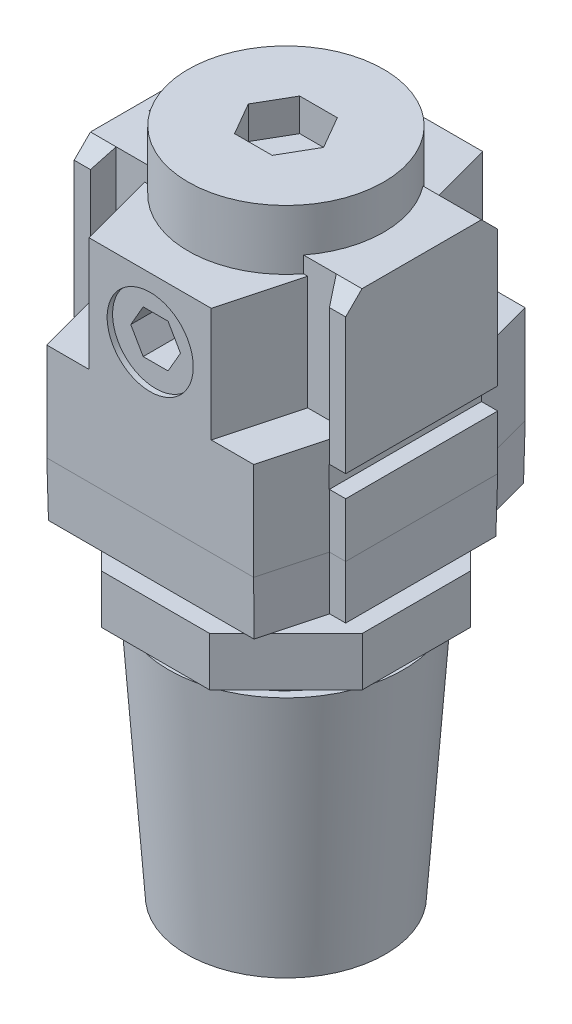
ISO-10303-21;
HEADER;
FILE_DESCRIPTION(('STEP AP214'),'2;1');
FILE_NAME('part.step','',(''),(''),'','','');
FILE_SCHEMA(('AUTOMOTIVE_DESIGN { 1 0 10303 214 1 1 1 1 }'));
ENDSEC;
DATA;
#1=APPLICATION_CONTEXT('core data for automotive mechanical design processes');
#2=APPLICATION_PROTOCOL_DEFINITION('international standard','automotive_design',2000,#1);
#3=PRODUCT_CONTEXT('',#1,'mechanical');
#4=PRODUCT('Part','Part','',(#3));
#5=PRODUCT_RELATED_PRODUCT_CATEGORY('part','',(#4));
#6=PRODUCT_DEFINITION_FORMATION('','',#4);
#7=PRODUCT_DEFINITION_CONTEXT('part definition',#1,'design');
#8=PRODUCT_DEFINITION('design','',#6,#7);
#9=PRODUCT_DEFINITION_SHAPE('','',#8);
#10=(LENGTH_UNIT() NAMED_UNIT(*) SI_UNIT(.MILLI.,.METRE.));
#11=(NAMED_UNIT(*) PLANE_ANGLE_UNIT() SI_UNIT($,.RADIAN.));
#12=(NAMED_UNIT(*) SI_UNIT($,.STERADIAN.) SOLID_ANGLE_UNIT());
#13=UNCERTAINTY_MEASURE_WITH_UNIT(LENGTH_MEASURE(1.E-05),#10,'distance_accuracy_value','');
#14=(GEOMETRIC_REPRESENTATION_CONTEXT(3) GLOBAL_UNCERTAINTY_ASSIGNED_CONTEXT((#13)) GLOBAL_UNIT_ASSIGNED_CONTEXT((#10,
#11,#12)) REPRESENTATION_CONTEXT('',''));
#15=CARTESIAN_POINT('',(0.,0.,0.));
#16=DIRECTION('',(0.,0.,1.));
#17=DIRECTION('',(1.,0.,0.));
#18=AXIS2_PLACEMENT_3D('',#15,#16,#17);
#19=CARTESIAN_POINT('',(0.,-41.2842712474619,0.));
#20=DIRECTION('',(0.,1.,0.));
#21=DIRECTION('',(0.,0.,1.));
#22=AXIS2_PLACEMENT_3D('',#19,#20,#21);
#23=CYLINDRICAL_SURFACE('',#22,10.);
#24=CARTESIAN_POINT('',(0.,-5.,0.));
#25=DIRECTION('',(0.,-1.,0.));
#26=DIRECTION('',(0.,0.,-1.));
#27=AXIS2_PLACEMENT_3D('',#24,#25,#26);
#28=CIRCLE('',#27,10.);
#29=CARTESIAN_POINT('',(0.,-5.,10.));
#30=VERTEX_POINT('',#29);
#31=EDGE_CURVE('E39',#30,#30,#28,.T.);
#32=CARTESIAN_POINT('',(0.,-7.,0.));
#33=DIRECTION('',(0.,-1.,0.));
#34=DIRECTION('',(0.,0.,-1.));
#35=AXIS2_PLACEMENT_3D('',#32,#33,#34);
#36=CIRCLE('',#35,10.);
#37=CARTESIAN_POINT('',(0.,-7.,10.));
#38=VERTEX_POINT('',#37);
#39=EDGE_CURVE('E622',#38,#38,#36,.F.);
#40=CARTESIAN_POINT('',(0.,-5.,10.));
#41=CARTESIAN_POINT('',(0.,-5.02083333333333,10.));
#42=CARTESIAN_POINT('',(0.,-5.04166666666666,10.));
#43=CARTESIAN_POINT('',(0.,-5.08333333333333,10.));
#44=CARTESIAN_POINT('',(0.,-5.10416666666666,10.));
#45=CARTESIAN_POINT('',(0.,-5.14583333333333,10.));
#46=CARTESIAN_POINT('',(0.,-5.16666666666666,10.));
#47=CARTESIAN_POINT('',(0.,-5.20833333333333,10.));
#48=CARTESIAN_POINT('',(0.,-5.22916666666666,10.));
#49=CARTESIAN_POINT('',(0.,-5.27083333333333,10.));
#50=CARTESIAN_POINT('',(0.,-5.29166666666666,10.));
#51=CARTESIAN_POINT('',(0.,-5.33333333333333,10.));
#52=CARTESIAN_POINT('',(0.,-5.35416666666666,10.));
#53=CARTESIAN_POINT('',(0.,-5.39583333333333,10.));
#54=CARTESIAN_POINT('',(0.,-5.41666666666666,10.));
#55=CARTESIAN_POINT('',(0.,-5.45833333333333,10.));
#56=CARTESIAN_POINT('',(0.,-5.47916666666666,10.));
#57=CARTESIAN_POINT('',(0.,-5.52083333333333,10.));
#58=CARTESIAN_POINT('',(0.,-5.54166666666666,10.));
#59=CARTESIAN_POINT('',(0.,-5.58333333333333,10.));
#60=CARTESIAN_POINT('',(0.,-5.60416666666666,10.));
#61=CARTESIAN_POINT('',(0.,-5.64583333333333,10.));
#62=CARTESIAN_POINT('',(0.,-5.66666666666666,10.));
#63=CARTESIAN_POINT('',(0.,-5.70833333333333,10.));
#64=CARTESIAN_POINT('',(0.,-5.72916666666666,10.));
#65=CARTESIAN_POINT('',(0.,-5.77083333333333,10.));
#66=CARTESIAN_POINT('',(0.,-5.79166666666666,10.));
#67=CARTESIAN_POINT('',(0.,-5.83333333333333,10.));
#68=CARTESIAN_POINT('',(0.,-5.85416666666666,10.));
#69=CARTESIAN_POINT('',(0.,-5.89583333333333,10.));
#70=CARTESIAN_POINT('',(0.,-5.91666666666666,10.));
#71=CARTESIAN_POINT('',(0.,-5.95833333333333,10.));
#72=CARTESIAN_POINT('',(0.,-5.97916666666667,10.));
#73=CARTESIAN_POINT('',(0.,-6.02083333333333,10.));
#74=CARTESIAN_POINT('',(0.,-6.04166666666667,10.));
#75=CARTESIAN_POINT('',(0.,-6.08333333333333,10.));
#76=CARTESIAN_POINT('',(0.,-6.10416666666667,10.));
#77=CARTESIAN_POINT('',(0.,-6.14583333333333,10.));
#78=CARTESIAN_POINT('',(0.,-6.16666666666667,10.));
#79=CARTESIAN_POINT('',(0.,-6.20833333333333,10.));
#80=CARTESIAN_POINT('',(0.,-6.22916666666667,10.));
#81=CARTESIAN_POINT('',(0.,-6.27083333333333,10.));
#82=CARTESIAN_POINT('',(0.,-6.29166666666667,10.));
#83=CARTESIAN_POINT('',(0.,-6.33333333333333,10.));
#84=CARTESIAN_POINT('',(0.,-6.35416666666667,10.));
#85=CARTESIAN_POINT('',(0.,-6.39583333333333,10.));
#86=CARTESIAN_POINT('',(0.,-6.41666666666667,10.));
#87=CARTESIAN_POINT('',(0.,-6.45833333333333,10.));
#88=CARTESIAN_POINT('',(0.,-6.47916666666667,10.));
#89=CARTESIAN_POINT('',(0.,-6.52083333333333,10.));
#90=CARTESIAN_POINT('',(0.,-6.54166666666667,10.));
#91=CARTESIAN_POINT('',(0.,-6.58333333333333,10.));
#92=CARTESIAN_POINT('',(0.,-6.60416666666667,10.));
#93=CARTESIAN_POINT('',(0.,-6.64583333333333,10.));
#94=CARTESIAN_POINT('',(0.,-6.66666666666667,10.));
#95=CARTESIAN_POINT('',(0.,-6.70833333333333,10.));
#96=CARTESIAN_POINT('',(0.,-6.72916666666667,10.));
#97=CARTESIAN_POINT('',(0.,-6.77083333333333,10.));
#98=CARTESIAN_POINT('',(0.,-6.79166666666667,10.));
#99=CARTESIAN_POINT('',(0.,-6.83333333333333,10.));
#100=CARTESIAN_POINT('',(0.,-6.85416666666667,10.));
#101=CARTESIAN_POINT('',(0.,-6.89583333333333,10.));
#102=CARTESIAN_POINT('',(0.,-6.91666666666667,10.));
#103=CARTESIAN_POINT('',(0.,-6.95833333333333,10.));
#104=CARTESIAN_POINT('',(0.,-6.97916666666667,10.));
#105=CARTESIAN_POINT('',(0.,-7.,10.));
#106=B_SPLINE_CURVE_WITH_KNOTS('',3,(#40,#41,#42,#43,#44,#45,#46,#47,#48,#49,#50,#51,#52,#53,
#54,#55,#56,#57,#58,#59,#60,#61,#62,#63,#64,#65,#66,#67,#68,#69,#70,#71,#72,#73,#74,#75,#76,#77,
#78,#79,#80,#81,#82,#83,#84,#85,#86,#87,#88,#89,#90,#91,#92,#93,#94,#95,#96,#97,#98,#99,#100,
#101,#102,#103,#104,#105),.UNSPECIFIED.,.F.,.F.,(4,2,2,2,2,2,2,2,2,2,2,2,2,2,2,2,2,2,2,2,2,2,2,
2,2,2,2,2,2,2,2,2,4),(0.,0.0625000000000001,0.125,0.1875,0.25,0.3125,0.375,0.4375,0.5,0.5625,
0.625000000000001,0.687500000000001,0.750000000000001,0.812500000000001,0.875000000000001,
0.937500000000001,1.,1.0625,1.125,1.1875,1.25,1.3125,1.375,1.4375,1.5,1.5625,1.625,1.6875,1.75,
1.8125,1.875,1.9375,2.),.UNSPECIFIED.);
#107=EDGE_CURVE('BSEAM30',#30,#38,#106,.T.);
#108=ORIENTED_EDGE('',*,*,#31,.T.);
#109=ORIENTED_EDGE('',*,*,#39,.T.);
#110=ORIENTED_EDGE('',*,*,#107,.T.);
#111=ORIENTED_EDGE('',*,*,#107,.F.);
#112=EDGE_LOOP('',(#108,#110,#109,#111));
#113=FACE_BOUND('',#112,.T.);
#114=ADVANCED_FACE('F30',(#113),#23,.T.);
#115=CARTESIAN_POINT('',(-3.965,14.,12.));
#116=DIRECTION('',(0.,0.,1.));
#117=DIRECTION('',(-1.,0.,0.));
#118=AXIS2_PLACEMENT_3D('',#115,#116,#117);
#119=PLANE('',#118);
#120=CARTESIAN_POINT('',(0.,14.,12.));
#121=DIRECTION('',(0.,0.,-1.));
#122=DIRECTION('',(-1.,0.,0.));
#123=AXIS2_PLACEMENT_3D('',#120,#121,#122);
#124=CIRCLE('',#123,3.965);
#125=CARTESIAN_POINT('',(-3.965,14.,12.));
#126=VERTEX_POINT('',#125);
#127=EDGE_CURVE('E739',#126,#126,#124,.T.);
#128=ORIENTED_EDGE('',*,*,#127,.F.);
#129=EDGE_LOOP('',(#128));
#130=FACE_BOUND('',#129,.T.);
#131=DIRECTION('',(-0.500000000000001,0.866025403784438,0.));
#132=VECTOR('',#131,1.);
#133=CARTESIAN_POINT('',(-1.14459690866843,12.0175,12.));
#134=LINE('',#133,#132);
#135=CARTESIAN_POINT('',(-1.14459690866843,12.0175,12.));
#136=VERTEX_POINT('',#135);
#137=CARTESIAN_POINT('',(-2.28919381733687,14.,12.));
#138=VERTEX_POINT('',#137);
#139=EDGE_CURVE('E696',#136,#138,#134,.T.);
#140=ORIENTED_EDGE('',*,*,#139,.T.);
#141=DIRECTION('',(0.5,0.866025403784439,0.));
#142=VECTOR('',#141,1.);
#143=CARTESIAN_POINT('',(-2.28919381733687,14.,12.));
#144=LINE('',#143,#142);
#145=CARTESIAN_POINT('',(-1.14459690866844,15.9825,12.));
#146=VERTEX_POINT('',#145);
#147=EDGE_CURVE('E54',#138,#146,#144,.T.);
#148=ORIENTED_EDGE('',*,*,#147,.T.);
#149=DIRECTION('',(1.,0.,0.));
#150=VECTOR('',#149,1.);
#151=CARTESIAN_POINT('',(-1.14459690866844,15.9825,12.));
#152=LINE('',#151,#150);
#153=CARTESIAN_POINT('',(1.14459690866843,15.9825,12.));
#154=VERTEX_POINT('',#153);
#155=EDGE_CURVE('E708',#146,#154,#152,.T.);
#156=ORIENTED_EDGE('',*,*,#155,.T.);
#157=DIRECTION('',(0.5,-0.866025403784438,0.));
#158=VECTOR('',#157,1.);
#159=CARTESIAN_POINT('',(1.14459690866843,15.9825,12.));
#160=LINE('',#159,#158);
#161=CARTESIAN_POINT('',(2.28919381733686,14.,12.));
#162=VERTEX_POINT('',#161);
#163=EDGE_CURVE('E705',#154,#162,#160,.T.);
#164=ORIENTED_EDGE('',*,*,#163,.T.);
#165=DIRECTION('',(-0.5,-0.866025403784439,0.));
#166=VECTOR('',#165,1.);
#167=CARTESIAN_POINT('',(2.28919381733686,14.,12.));
#168=LINE('',#167,#166);
#169=CARTESIAN_POINT('',(1.14459690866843,12.0175,12.));
#170=VERTEX_POINT('',#169);
#171=EDGE_CURVE('E702',#162,#170,#168,.T.);
#172=ORIENTED_EDGE('',*,*,#171,.T.);
#173=DIRECTION('',(-1.,0.,0.));
#174=VECTOR('',#173,1.);
#175=CARTESIAN_POINT('',(1.14459690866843,12.0175,12.));
#176=LINE('',#175,#174);
#177=EDGE_CURVE('E699',#170,#136,#176,.T.);
#178=ORIENTED_EDGE('',*,*,#177,.T.);
#179=EDGE_LOOP('',(#140,#148,#156,#164,#172,#178));
#180=FACE_BOUND('',#179,.T.);
#181=ADVANCED_FACE('F1245',(#130,#180),#119,.T.);
#182=CARTESIAN_POINT('',(0.,14.,-12.5));
#183=DIRECTION('',(0.,0.,1.));
#184=DIRECTION('',(1.,0.,0.));
#185=AXIS2_PLACEMENT_3D('',#182,#183,#184);
#186=CYLINDRICAL_SURFACE('',#185,3.965);
#187=ORIENTED_EDGE('',*,*,#127,.T.);
#188=EDGE_LOOP('',(#187));
#189=FACE_BOUND('',#188,.T.);
#190=CARTESIAN_POINT('',(0.,14.,12.5));
#191=DIRECTION('',(0.,0.,1.));
#192=DIRECTION('',(1.,0.,0.));
#193=AXIS2_PLACEMENT_3D('',#190,#191,#192);
#194=CIRCLE('',#193,3.965);
#195=CARTESIAN_POINT('',(3.965,14.,12.5));
#196=VERTEX_POINT('',#195);
#197=EDGE_CURVE('E796',#196,#196,#194,.T.);
#198=ORIENTED_EDGE('',*,*,#197,.T.);
#199=EDGE_LOOP('',(#198));
#200=FACE_BOUND('',#199,.T.);
#201=ADVANCED_FACE('F1253',(#189,#200),#186,.F.);
#202=CARTESIAN_POINT('',(0.,14.,-12.));
#203=DIRECTION('',(0.,0.,-1.));
#204=DIRECTION('',(-1.,0.,0.));
#205=AXIS2_PLACEMENT_3D('',#202,#203,#204);
#206=CIRCLE('',#205,3.965);
#207=CARTESIAN_POINT('',(-3.965,14.,-12.));
#208=VERTEX_POINT('',#207);
#209=EDGE_CURVE('E793',#208,#208,#206,.T.);
#210=ORIENTED_EDGE('',*,*,#209,.F.);
#211=EDGE_LOOP('',(#210));
#212=FACE_BOUND('',#211,.T.);
#213=CARTESIAN_POINT('',(0.,14.,-12.5));
#214=DIRECTION('',(0.,0.,1.));
#215=DIRECTION('',(1.,0.,0.));
#216=AXIS2_PLACEMENT_3D('',#213,#214,#215);
#217=CIRCLE('',#216,3.965);
#218=CARTESIAN_POINT('',(3.965,14.,-12.5));
#219=VERTEX_POINT('',#218);
#220=EDGE_CURVE('E799',#219,#219,#217,.T.);
#221=ORIENTED_EDGE('',*,*,#220,.F.);
#222=EDGE_LOOP('',(#221));
#223=FACE_BOUND('',#222,.T.);
#224=ADVANCED_FACE('F1566',(#212,#223),#186,.F.);
#225=CARTESIAN_POINT('',(-10.1339745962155,21.,5.5));
#226=DIRECTION('',(0.,0.,1.));
#227=DIRECTION('',(1.,0.,0.));
#228=AXIS2_PLACEMENT_3D('',#225,#226,#227);
#229=PLANE('',#228);
#230=DIRECTION('',(-1.,0.,0.));
#231=VECTOR('',#230,1.);
#232=CARTESIAN_POINT('',(7.49564434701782,19.5,5.50000000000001));
#233=LINE('',#232,#231);
#234=CARTESIAN_POINT('',(-7.1239034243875,19.5,5.5));
#235=VERTEX_POINT('',#234);
#236=CARTESIAN_POINT('',(-7.50564434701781,19.5,5.5));
#237=VERTEX_POINT('',#236);
#238=EDGE_CURVE('E926',#235,#237,#233,.T.);
#239=ORIENTED_EDGE('',*,*,#238,.F.);
#240=DIRECTION('',(0.,-1.,0.));
#241=VECTOR('',#240,1.);
#242=CARTESIAN_POINT('',(-7.1239034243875,25.,5.5));
#243=LINE('',#242,#241);
#244=CARTESIAN_POINT('',(-7.1239034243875,21.,5.5));
#245=VERTEX_POINT('',#244);
#246=EDGE_CURVE('E856',#235,#245,#243,.F.);
#247=ORIENTED_EDGE('',*,*,#246,.T.);
#248=DIRECTION('',(-1.,0.,0.));
#249=VECTOR('',#248,1.);
#250=CARTESIAN_POINT('',(-10.1339745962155,21.,5.5));
#251=LINE('',#250,#249);
#252=CARTESIAN_POINT('',(-10.1339745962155,21.,5.5));
#253=VERTEX_POINT('',#252);
#254=EDGE_CURVE('E1042',#245,#253,#251,.T.);
#255=ORIENTED_EDGE('',*,*,#254,.T.);
#256=DIRECTION('',(0.,-1.,0.));
#257=VECTOR('',#256,1.);
#258=CARTESIAN_POINT('',(-10.1339745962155,21.,5.5));
#259=LINE('',#258,#257);
#260=CARTESIAN_POINT('',(-10.1339745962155,9.,5.50000000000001));
#261=VERTEX_POINT('',#260);
#262=EDGE_CURVE('E1052',#253,#261,#259,.T.);
#263=ORIENTED_EDGE('',*,*,#262,.T.);
#264=DIRECTION('',(1.,0.,0.));
#265=VECTOR('',#264,1.);
#266=CARTESIAN_POINT('',(-10.1339745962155,9.,5.5));
#267=LINE('',#266,#265);
#268=CARTESIAN_POINT('',(-7.50564434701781,9.,5.5));
#269=VERTEX_POINT('',#268);
#270=EDGE_CURVE('E1154',#261,#269,#267,.T.);
#271=ORIENTED_EDGE('',*,*,#270,.T.);
#272=DIRECTION('',(0.,-1.,0.));
#273=VECTOR('',#272,1.);
#274=CARTESIAN_POINT('',(-7.50564434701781,19.5,5.50000000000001));
#275=LINE('',#274,#273);
#276=EDGE_CURVE('E940',#237,#269,#275,.T.);
#277=ORIENTED_EDGE('',*,*,#276,.F.);
#278=EDGE_LOOP('',(#239,#247,#255,#263,#271,#277));
#279=FACE_BOUND('',#278,.T.);
#280=ADVANCED_FACE('F1645',(#279),#229,.T.);
#281=CARTESIAN_POINT('',(10.1339745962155,21.,5.49999999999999));
#282=VERTEX_POINT('',#281);
#283=CARTESIAN_POINT('',(7.1239034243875,21.,5.5));
#284=VERTEX_POINT('',#283);
#285=EDGE_CURVE('E1043',#282,#284,#251,.T.);
#286=ORIENTED_EDGE('',*,*,#285,.T.);
#287=DIRECTION('',(0.,-1.,0.));
#288=VECTOR('',#287,1.);
#289=CARTESIAN_POINT('',(7.1239034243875,25.,5.5));
#290=LINE('',#289,#288);
#291=CARTESIAN_POINT('',(7.1239034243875,19.5,5.5));
#292=VERTEX_POINT('',#291);
#293=EDGE_CURVE('E853',#284,#292,#290,.T.);
#294=ORIENTED_EDGE('',*,*,#293,.T.);
#295=CARTESIAN_POINT('',(7.49564434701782,19.5,5.5));
#296=VERTEX_POINT('',#295);
#297=EDGE_CURVE('E927',#296,#292,#233,.T.);
#298=ORIENTED_EDGE('',*,*,#297,.F.);
#299=DIRECTION('',(0.,-1.,0.));
#300=VECTOR('',#299,1.);
#301=CARTESIAN_POINT('',(7.49564434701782,19.5,5.50000000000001));
#302=LINE('',#301,#300);
#303=CARTESIAN_POINT('',(7.49564434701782,9.,5.5));
#304=VERTEX_POINT('',#303);
#305=EDGE_CURVE('E943',#296,#304,#302,.T.);
#306=ORIENTED_EDGE('',*,*,#305,.T.);
#307=CARTESIAN_POINT('',(10.1339745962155,9.,5.50000000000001));
#308=VERTEX_POINT('',#307);
#309=EDGE_CURVE('E1153',#304,#308,#267,.T.);
#310=ORIENTED_EDGE('',*,*,#309,.T.);
#311=DIRECTION('',(0.,-1.,0.));
#312=VECTOR('',#311,1.);
#313=CARTESIAN_POINT('',(10.1339745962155,21.,5.5));
#314=LINE('',#313,#312);
#315=EDGE_CURVE('E1055',#282,#308,#314,.T.);
#316=ORIENTED_EDGE('',*,*,#315,.F.);
#317=EDGE_LOOP('',(#286,#294,#298,#306,#310,#316));
#318=FACE_BOUND('',#317,.T.);
#319=ADVANCED_FACE('F1730',(#318),#229,.T.);
#320=CARTESIAN_POINT('',(-10.1339745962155,21.,-5.5));
#321=DIRECTION('',(0.,0.,-1.));
#322=DIRECTION('',(-1.,0.,0.));
#323=AXIS2_PLACEMENT_3D('',#320,#321,#322);
#324=PLANE('',#323);
#325=DIRECTION('',(1.,0.,0.));
#326=VECTOR('',#325,1.);
#327=CARTESIAN_POINT('',(7.49564434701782,19.5,-5.50000000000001));
#328=LINE('',#327,#326);
#329=CARTESIAN_POINT('',(7.1239034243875,19.5,-5.5));
#330=VERTEX_POINT('',#329);
#331=CARTESIAN_POINT('',(7.49564434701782,19.5,-5.5));
#332=VERTEX_POINT('',#331);
#333=EDGE_CURVE('E951',#330,#332,#328,.T.);
#334=ORIENTED_EDGE('',*,*,#333,.F.);
#335=DIRECTION('',(0.,-1.,0.));
#336=VECTOR('',#335,1.);
#337=CARTESIAN_POINT('',(7.1239034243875,25.,-5.5));
#338=LINE('',#337,#336);
#339=CARTESIAN_POINT('',(7.1239034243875,21.,-5.5));
#340=VERTEX_POINT('',#339);
#341=EDGE_CURVE('E865',#330,#340,#338,.F.);
#342=ORIENTED_EDGE('',*,*,#341,.T.);
#343=DIRECTION('',(1.,0.,0.));
#344=VECTOR('',#343,1.);
#345=CARTESIAN_POINT('',(-10.1339745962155,21.,-5.5));
#346=LINE('',#345,#344);
#347=CARTESIAN_POINT('',(10.1339745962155,21.,-5.5));
#348=VERTEX_POINT('',#347);
#349=EDGE_CURVE('E1063',#340,#348,#346,.T.);
#350=ORIENTED_EDGE('',*,*,#349,.T.);
#351=DIRECTION('',(0.,-1.,0.));
#352=VECTOR('',#351,1.);
#353=CARTESIAN_POINT('',(10.1339745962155,21.,-5.5));
#354=LINE('',#353,#352);
#355=CARTESIAN_POINT('',(10.1339745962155,9.,-5.50000000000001));
#356=VERTEX_POINT('',#355);
#357=EDGE_CURVE('E1070',#348,#356,#354,.T.);
#358=ORIENTED_EDGE('',*,*,#357,.T.);
#359=DIRECTION('',(-1.,0.,0.));
#360=VECTOR('',#359,1.);
#361=CARTESIAN_POINT('',(-10.1339745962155,9.,-5.5));
#362=LINE('',#361,#360);
#363=CARTESIAN_POINT('',(7.49564434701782,9.,-5.5));
#364=VERTEX_POINT('',#363);
#365=EDGE_CURVE('E1146',#356,#364,#362,.T.);
#366=ORIENTED_EDGE('',*,*,#365,.T.);
#367=DIRECTION('',(0.,-1.,0.));
#368=VECTOR('',#367,1.);
#369=CARTESIAN_POINT('',(7.49564434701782,19.5,-5.50000000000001));
#370=LINE('',#369,#368);
#371=EDGE_CURVE('E971',#332,#364,#370,.T.);
#372=ORIENTED_EDGE('',*,*,#371,.F.);
#373=EDGE_LOOP('',(#334,#342,#350,#358,#366,#372));
#374=FACE_BOUND('',#373,.T.);
#375=ADVANCED_FACE('F1739',(#374),#324,.T.);
#376=CARTESIAN_POINT('',(-10.1339745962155,21.,-5.50000000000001));
#377=VERTEX_POINT('',#376);
#378=CARTESIAN_POINT('',(-7.1239034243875,21.,-5.5));
#379=VERTEX_POINT('',#378);
#380=EDGE_CURVE('E1064',#377,#379,#346,.T.);
#381=ORIENTED_EDGE('',*,*,#380,.T.);
#382=DIRECTION('',(0.,-1.,0.));
#383=VECTOR('',#382,1.);
#384=CARTESIAN_POINT('',(-7.1239034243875,25.,-5.5));
#385=LINE('',#384,#383);
#386=CARTESIAN_POINT('',(-7.1239034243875,19.5,-5.5));
#387=VERTEX_POINT('',#386);
#388=EDGE_CURVE('E862',#379,#387,#385,.T.);
#389=ORIENTED_EDGE('',*,*,#388,.T.);
#390=CARTESIAN_POINT('',(-7.50564434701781,19.5,-5.5));
#391=VERTEX_POINT('',#390);
#392=EDGE_CURVE('E952',#391,#387,#328,.T.);
#393=ORIENTED_EDGE('',*,*,#392,.F.);
#394=DIRECTION('',(0.,-1.,0.));
#395=VECTOR('',#394,1.);
#396=CARTESIAN_POINT('',(-7.50564434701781,19.5,-5.50000000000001));
#397=LINE('',#396,#395);
#398=CARTESIAN_POINT('',(-7.50564434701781,9.,-5.50000000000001));
#399=VERTEX_POINT('',#398);
#400=EDGE_CURVE('E962',#391,#399,#397,.T.);
#401=ORIENTED_EDGE('',*,*,#400,.T.);
#402=CARTESIAN_POINT('',(-10.1339745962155,9.,-5.50000000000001));
#403=VERTEX_POINT('',#402);
#404=EDGE_CURVE('E1145',#399,#403,#362,.T.);
#405=ORIENTED_EDGE('',*,*,#404,.T.);
#406=DIRECTION('',(0.,-1.,0.));
#407=VECTOR('',#406,1.);
#408=CARTESIAN_POINT('',(-10.1339745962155,21.,-5.5));
#409=LINE('',#408,#407);
#410=EDGE_CURVE('E1073',#377,#403,#409,.T.);
#411=ORIENTED_EDGE('',*,*,#410,.F.);
#412=EDGE_LOOP('',(#381,#389,#393,#401,#405,#411));
#413=FACE_BOUND('',#412,.T.);
#414=ADVANCED_FACE('F1316',(#413),#324,.T.);
#415=CARTESIAN_POINT('',(12.5,21.,-5.50000000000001));
#416=DIRECTION('',(0.,-1.,0.));
#417=DIRECTION('',(0.,0.,-1.));
#418=AXIS2_PLACEMENT_3D('',#415,#416,#417);
#419=PLANE('',#418);
#420=DIRECTION('',(0.,0.,1.));
#421=VECTOR('',#420,1.);
#422=CARTESIAN_POINT('',(-11.5,20.9999999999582,-1.15470053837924));
#423=LINE('',#422,#421);
#424=CARTESIAN_POINT('',(-11.5,21.,-1.15470053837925));
#425=VERTEX_POINT('',#424);
#426=CARTESIAN_POINT('',(-11.5,20.9999999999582,1.15470053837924));
#427=VERTEX_POINT('',#426);
#428=EDGE_CURVE('E538',#425,#427,#423,.T.);
#429=ORIENTED_EDGE('',*,*,#428,.F.);
#430=DIRECTION('',(-0.866025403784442,0.,-0.499999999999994));
#431=VECTOR('',#430,1.);
#432=CARTESIAN_POINT('',(-9.5,20.9999999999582,0.));
#433=LINE('',#432,#431);
#434=CARTESIAN_POINT('',(-9.5,20.9999999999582,0.));
#435=VERTEX_POINT('',#434);
#436=EDGE_CURVE('E46',#435,#425,#433,.T.);
#437=ORIENTED_EDGE('',*,*,#436,.F.);
#438=DIRECTION('',(0.866025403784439,0.,-0.5));
#439=VECTOR('',#438,1.);
#440=CARTESIAN_POINT('',(-11.5,20.9999999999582,1.15470053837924));
#441=LINE('',#440,#439);
#442=EDGE_CURVE('E528',#427,#435,#441,.T.);
#443=ORIENTED_EDGE('',*,*,#442,.F.);
#444=EDGE_LOOP('',(#429,#437,#443));
#445=FACE_BOUND('',#444,.T.);
#446=CARTESIAN_POINT('',(0.,21.,0.));
#447=DIRECTION('',(0.,-1.,0.));
#448=DIRECTION('',(0.,0.,-1.));
#449=AXIS2_PLACEMENT_3D('',#446,#447,#448);
#450=CIRCLE('',#449,9.);
#451=EDGE_CURVE('E861',#379,#245,#450,.F.);
#452=ORIENTED_EDGE('',*,*,#451,.F.);
#453=ORIENTED_EDGE('',*,*,#380,.F.);
#454=DIRECTION('',(-1.,0.,0.));
#455=VECTOR('',#454,1.);
#456=CARTESIAN_POINT('',(12.5,21.,-5.50000000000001));
#457=LINE('',#456,#455);
#458=CARTESIAN_POINT('',(-12.5,21.,-5.50000000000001));
#459=VERTEX_POINT('',#458);
#460=EDGE_CURVE('E1125',#377,#459,#457,.T.);
#461=ORIENTED_EDGE('',*,*,#460,.T.);
#462=DIRECTION('',(0.,0.,1.));
#463=VECTOR('',#462,1.);
#464=CARTESIAN_POINT('',(-12.5,21.,-5.50000000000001));
#465=LINE('',#464,#463);
#466=CARTESIAN_POINT('',(-12.5,21.,5.49999999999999));
#467=VERTEX_POINT('',#466);
#468=EDGE_CURVE('E1101',#459,#467,#465,.T.);
#469=ORIENTED_EDGE('',*,*,#468,.T.);
#470=DIRECTION('',(-1.,0.,0.));
#471=VECTOR('',#470,1.);
#472=CARTESIAN_POINT('',(12.5,21.,5.49999999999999));
#473=LINE('',#472,#471);
#474=EDGE_CURVE('E1121',#253,#467,#473,.T.);
#475=ORIENTED_EDGE('',*,*,#474,.F.);
#476=ORIENTED_EDGE('',*,*,#254,.F.);
#477=EDGE_LOOP('',(#452,#453,#461,#469,#475,#476));
#478=FACE_BOUND('',#477,.T.);
#479=ADVANCED_FACE('F542',(#445,#478),#419,.F.);
#480=EDGE_CURVE('E859',#284,#340,#450,.F.);
#481=ORIENTED_EDGE('',*,*,#480,.F.);
#482=ORIENTED_EDGE('',*,*,#285,.F.);
#483=CARTESIAN_POINT('',(12.5,21.,5.49999999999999));
#484=VERTEX_POINT('',#483);
#485=EDGE_CURVE('E1122',#484,#282,#473,.T.);
#486=ORIENTED_EDGE('',*,*,#485,.F.);
#487=DIRECTION('',(0.,0.,1.));
#488=VECTOR('',#487,1.);
#489=CARTESIAN_POINT('',(12.5,21.,-5.50000000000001));
#490=LINE('',#489,#488);
#491=CARTESIAN_POINT('',(12.5,21.,-5.50000000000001));
#492=VERTEX_POINT('',#491);
#493=EDGE_CURVE('E1119',#492,#484,#490,.T.);
#494=ORIENTED_EDGE('',*,*,#493,.F.);
#495=EDGE_CURVE('E1126',#492,#348,#457,.T.);
#496=ORIENTED_EDGE('',*,*,#495,.T.);
#497=ORIENTED_EDGE('',*,*,#349,.F.);
#498=EDGE_LOOP('',(#481,#482,#486,#494,#496,#497));
#499=FACE_BOUND('',#498,.T.);
#500=ADVANCED_FACE('F1315',(#499),#419,.F.);
#501=CARTESIAN_POINT('',(-7.50564434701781,19.5,-5.50000000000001));
#502=DIRECTION('',(0.,-1.,0.));
#503=DIRECTION('',(0.,0.,-1.));
#504=AXIS2_PLACEMENT_3D('',#501,#502,#503);
#505=PLANE('',#504);
#506=CARTESIAN_POINT('',(0.,19.5,0.));
#507=DIRECTION('',(0.,-1.,0.));
#508=DIRECTION('',(0.,0.,-1.));
#509=AXIS2_PLACEMENT_3D('',#506,#507,#508);
#510=CIRCLE('',#509,9.);
#511=EDGE_CURVE('E868',#330,#387,#510,.F.);
#512=ORIENTED_EDGE('',*,*,#511,.F.);
#513=ORIENTED_EDGE('',*,*,#333,.T.);
#514=DIRECTION('',(-0.258819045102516,0.,-0.96592582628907));
#515=VECTOR('',#514,1.);
#516=CARTESIAN_POINT('',(5.62,19.5,-12.5));
#517=LINE('',#516,#515);
#518=CARTESIAN_POINT('',(5.62,19.5,-12.5));
#519=VERTEX_POINT('',#518);
#520=EDGE_CURVE('E955',#332,#519,#517,.T.);
#521=ORIENTED_EDGE('',*,*,#520,.T.);
#522=DIRECTION('',(-1.,0.,0.));
#523=VECTOR('',#522,1.);
#524=CARTESIAN_POINT('',(-5.63,19.5,-12.5));
#525=LINE('',#524,#523);
#526=CARTESIAN_POINT('',(-5.63,19.5,-12.5));
#527=VERTEX_POINT('',#526);
#528=EDGE_CURVE('E957',#519,#527,#525,.T.);
#529=ORIENTED_EDGE('',*,*,#528,.T.);
#530=DIRECTION('',(-0.258819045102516,0.,0.96592582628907));
#531=VECTOR('',#530,1.);
#532=CARTESIAN_POINT('',(-7.50564434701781,19.5,-5.50000000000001));
#533=LINE('',#532,#531);
#534=EDGE_CURVE('E959',#527,#391,#533,.T.);
#535=ORIENTED_EDGE('',*,*,#534,.T.);
#536=ORIENTED_EDGE('',*,*,#392,.T.);
#537=EDGE_LOOP('',(#512,#513,#521,#529,#535,#536));
#538=FACE_BOUND('',#537,.T.);
#539=ADVANCED_FACE('F1756',(#538),#505,.F.);
#540=CARTESIAN_POINT('',(7.49564434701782,19.5,5.50000000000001));
#541=DIRECTION('',(0.,1.,0.));
#542=DIRECTION('',(0.,0.,1.));
#543=AXIS2_PLACEMENT_3D('',#540,#541,#542);
#544=PLANE('',#543);
#545=ORIENTED_EDGE('',*,*,#297,.T.);
#546=CARTESIAN_POINT('',(0.,19.5,0.));
#547=DIRECTION('',(0.,1.,0.));
#548=DIRECTION('',(0.,0.,1.));
#549=AXIS2_PLACEMENT_3D('',#546,#547,#548);
#550=CIRCLE('',#549,9.);
#551=EDGE_CURVE('E1184',#292,#235,#550,.F.);
#552=ORIENTED_EDGE('',*,*,#551,.T.);
#553=ORIENTED_EDGE('',*,*,#238,.T.);
#554=DIRECTION('',(0.258819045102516,0.,0.96592582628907));
#555=VECTOR('',#554,1.);
#556=CARTESIAN_POINT('',(-7.50564434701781,19.5,5.50000000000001));
#557=LINE('',#556,#555);
#558=CARTESIAN_POINT('',(-5.63,19.5,12.5));
#559=VERTEX_POINT('',#558);
#560=EDGE_CURVE('E930',#237,#559,#557,.T.);
#561=ORIENTED_EDGE('',*,*,#560,.T.);
#562=DIRECTION('',(1.,0.,0.));
#563=VECTOR('',#562,1.);
#564=CARTESIAN_POINT('',(-5.63,19.5,12.5));
#565=LINE('',#564,#563);
#566=CARTESIAN_POINT('',(5.62,19.5,12.5));
#567=VERTEX_POINT('',#566);
#568=EDGE_CURVE('E932',#559,#567,#565,.T.);
#569=ORIENTED_EDGE('',*,*,#568,.T.);
#570=DIRECTION('',(0.258819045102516,0.,-0.96592582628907));
#571=VECTOR('',#570,1.);
#572=CARTESIAN_POINT('',(5.62,19.5,12.5));
#573=LINE('',#572,#571);
#574=EDGE_CURVE('E923',#567,#296,#573,.T.);
#575=ORIENTED_EDGE('',*,*,#574,.T.);
#576=EDGE_LOOP('',(#545,#552,#553,#561,#569,#575));
#577=FACE_BOUND('',#576,.T.);
#578=ADVANCED_FACE('F1762',(#577),#544,.T.);
#579=CARTESIAN_POINT('',(-12.5,26.5,0.));
#580=DIRECTION('',(1.,0.,0.));
#581=DIRECTION('',(0.,0.,-1.));
#582=AXIS2_PLACEMENT_3D('',#579,#580,#581);
#583=PLANE('',#582);
#584=DIRECTION('',(0.,1.,0.));
#585=VECTOR('',#584,1.);
#586=CARTESIAN_POINT('',(-12.5,19.5,-7.));
#587=LINE('',#586,#585);
#588=CARTESIAN_POINT('',(-12.5,7.,-7.00000000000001));
#589=VERTEX_POINT('',#588);
#590=CARTESIAN_POINT('',(-12.5,19.5,-7.));
#591=VERTEX_POINT('',#590);
#592=EDGE_CURVE('E1094',#589,#591,#587,.T.);
#593=ORIENTED_EDGE('',*,*,#592,.F.);
#594=DIRECTION('',(0.,0.,1.));
#595=VECTOR('',#594,1.);
#596=CARTESIAN_POINT('',(-12.5,7.,0.));
#597=LINE('',#596,#595);
#598=CARTESIAN_POINT('',(-12.5,7.,6.99999999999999));
#599=VERTEX_POINT('',#598);
#600=EDGE_CURVE('E1178',#589,#599,#597,.T.);
#601=ORIENTED_EDGE('',*,*,#600,.T.);
#602=DIRECTION('',(0.,-1.,0.));
#603=VECTOR('',#602,1.);
#604=CARTESIAN_POINT('',(-12.5,19.5,6.99999999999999));
#605=LINE('',#604,#603);
#606=CARTESIAN_POINT('',(-12.5,19.5,6.99999999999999));
#607=VERTEX_POINT('',#606);
#608=EDGE_CURVE('E1088',#607,#599,#605,.T.);
#609=ORIENTED_EDGE('',*,*,#608,.F.);
#610=DIRECTION('',(0.,-0.707106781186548,0.707106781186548));
#611=VECTOR('',#610,1.);
#612=CARTESIAN_POINT('',(-12.5,21.,5.49999999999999));
#613=LINE('',#612,#611);
#614=EDGE_CURVE('E1084',#467,#607,#613,.T.);
#615=ORIENTED_EDGE('',*,*,#614,.F.);
#616=ORIENTED_EDGE('',*,*,#468,.F.);
#617=DIRECTION('',(0.,0.707106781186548,0.707106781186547));
#618=VECTOR('',#617,1.);
#619=CARTESIAN_POINT('',(-12.5,21.,-5.50000000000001));
#620=LINE('',#619,#618);
#621=EDGE_CURVE('E1098',#591,#459,#620,.T.);
#622=ORIENTED_EDGE('',*,*,#621,.F.);
#623=EDGE_LOOP('',(#593,#601,#609,#615,#616,#622));
#624=FACE_BOUND('',#623,.T.);
#625=ADVANCED_FACE('F1769',(#624),#583,.F.);
#626=CARTESIAN_POINT('',(12.5,19.5,6.99999999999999));
#627=DIRECTION('',(0.,0.,-1.));
#628=DIRECTION('',(0.,1.,0.));
#629=AXIS2_PLACEMENT_3D('',#626,#627,#628);
#630=PLANE('',#629);
#631=DIRECTION('',(0.,-1.,0.));
#632=VECTOR('',#631,1.);
#633=CARTESIAN_POINT('',(12.5,19.5,6.99999999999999));
#634=LINE('',#633,#632);
#635=CARTESIAN_POINT('',(12.5,5.,6.99999999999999));
#636=VERTEX_POINT('',#635);
#637=CARTESIAN_POINT('',(12.5,0.,6.99999999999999));
#638=VERTEX_POINT('',#637);
#639=EDGE_CURVE('E1107',#636,#638,#634,.T.);
#640=ORIENTED_EDGE('',*,*,#639,.F.);
#641=DIRECTION('',(-1.,0.,0.));
#642=VECTOR('',#641,1.);
#643=CARTESIAN_POINT('',(12.5,5.,6.99999999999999));
#644=LINE('',#643,#642);
#645=CARTESIAN_POINT('',(11.0037205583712,5.,6.99999999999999));
#646=VERTEX_POINT('',#645);
#647=EDGE_CURVE('E914',#636,#646,#644,.T.);
#648=ORIENTED_EDGE('',*,*,#647,.T.);
#649=DIRECTION('',(0.,1.,0.));
#650=VECTOR('',#649,1.);
#651=CARTESIAN_POINT('',(11.0037205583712,19.5,6.99999999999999));
#652=LINE('',#651,#650);
#653=CARTESIAN_POINT('',(11.0037205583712,0.,6.99999999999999));
#654=VERTEX_POINT('',#653);
#655=EDGE_CURVE('E1158',#654,#646,#652,.T.);
#656=ORIENTED_EDGE('',*,*,#655,.F.);
#657=DIRECTION('',(-1.,0.,0.));
#658=VECTOR('',#657,1.);
#659=CARTESIAN_POINT('',(12.5,0.,6.99999999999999));
#660=LINE('',#659,#658);
#661=EDGE_CURVE('E1138',#638,#654,#660,.T.);
#662=ORIENTED_EDGE('',*,*,#661,.F.);
#663=EDGE_LOOP('',(#640,#648,#656,#662));
#664=FACE_BOUND('',#663,.T.);
#665=ADVANCED_FACE('F1827',(#664),#630,.F.);
#666=CARTESIAN_POINT('',(12.5,19.5,-7.));
#667=DIRECTION('',(0.,0.,1.));
#668=DIRECTION('',(0.,-1.,0.));
#669=AXIS2_PLACEMENT_3D('',#666,#667,#668);
#670=PLANE('',#669);
#671=DIRECTION('',(0.,-1.,0.));
#672=VECTOR('',#671,1.);
#673=CARTESIAN_POINT('',(11.0037205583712,19.5,-7.));
#674=LINE('',#673,#672);
#675=CARTESIAN_POINT('',(11.0037205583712,5.,-7.));
#676=VERTEX_POINT('',#675);
#677=CARTESIAN_POINT('',(11.0037205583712,0.,-7.00000000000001));
#678=VERTEX_POINT('',#677);
#679=EDGE_CURVE('E1149',#676,#678,#674,.T.);
#680=ORIENTED_EDGE('',*,*,#679,.F.);
#681=DIRECTION('',(1.,0.,0.));
#682=VECTOR('',#681,1.);
#683=CARTESIAN_POINT('',(12.5,5.,-7.00000000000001));
#684=LINE('',#683,#682);
#685=CARTESIAN_POINT('',(12.5,5.,-7.00000000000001));
#686=VERTEX_POINT('',#685);
#687=EDGE_CURVE('E920',#676,#686,#684,.T.);
#688=ORIENTED_EDGE('',*,*,#687,.T.);
#689=DIRECTION('',(0.,1.,0.));
#690=VECTOR('',#689,1.);
#691=CARTESIAN_POINT('',(12.5,19.5,-7.));
#692=LINE('',#691,#690);
#693=CARTESIAN_POINT('',(12.5,0.,-7.00000000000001));
#694=VERTEX_POINT('',#693);
#695=EDGE_CURVE('E1114',#694,#686,#692,.T.);
#696=ORIENTED_EDGE('',*,*,#695,.F.);
#697=DIRECTION('',(-1.,0.,0.));
#698=VECTOR('',#697,1.);
#699=CARTESIAN_POINT('',(12.5,0.,-7.00000000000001));
#700=LINE('',#699,#698);
#701=EDGE_CURVE('E1134',#694,#678,#700,.T.);
#702=ORIENTED_EDGE('',*,*,#701,.T.);
#703=EDGE_LOOP('',(#680,#688,#696,#702));
#704=FACE_BOUND('',#703,.T.);
#705=ADVANCED_FACE('F1837',(#704),#670,.F.);
#706=CARTESIAN_POINT('',(12.5,26.5,0.));
#707=DIRECTION('',(1.,0.,0.));
#708=DIRECTION('',(0.,0.,-1.));
#709=AXIS2_PLACEMENT_3D('',#706,#707,#708);
#710=PLANE('',#709);
#711=DIRECTION('',(0.,0.,1.));
#712=VECTOR('',#711,1.);
#713=CARTESIAN_POINT('',(12.5,5.,-12.5));
#714=LINE('',#713,#712);
#715=EDGE_CURVE('E892',#686,#636,#714,.T.);
#716=ORIENTED_EDGE('',*,*,#715,.T.);
#717=ORIENTED_EDGE('',*,*,#639,.T.);
#718=DIRECTION('',(0.,0.,-1.));
#719=VECTOR('',#718,1.);
#720=CARTESIAN_POINT('',(12.5,0.,6.99999999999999));
#721=LINE('',#720,#719);
#722=EDGE_CURVE('E1111',#638,#694,#721,.T.);
#723=ORIENTED_EDGE('',*,*,#722,.T.);
#724=ORIENTED_EDGE('',*,*,#695,.T.);
#725=EDGE_LOOP('',(#716,#717,#723,#724));
#726=FACE_BOUND('',#725,.T.);
#727=ADVANCED_FACE('F1846',(#726),#710,.T.);
#728=CARTESIAN_POINT('',(9.53,9.,12.5));
#729=DIRECTION('',(0.,-1.,0.));
#730=DIRECTION('',(0.,0.,-1.));
#731=AXIS2_PLACEMENT_3D('',#728,#729,#730);
#732=PLANE('',#731);
#733=DIRECTION('',(0.258819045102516,0.,-0.96592582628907));
#734=VECTOR('',#733,1.);
#735=CARTESIAN_POINT('',(5.88192033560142,9.,11.5225));
#736=LINE('',#735,#734);
#737=CARTESIAN_POINT('',(5.62,9.,12.5));
#738=VERTEX_POINT('',#737);
#739=EDGE_CURVE('E948',#738,#304,#736,.T.);
#740=ORIENTED_EDGE('',*,*,#739,.F.);
#741=DIRECTION('',(1.,0.,0.));
#742=VECTOR('',#741,1.);
#743=CARTESIAN_POINT('',(-9.52,9.,12.5));
#744=LINE('',#743,#742);
#745=CARTESIAN_POINT('',(9.53,9.,12.5));
#746=VERTEX_POINT('',#745);
#747=EDGE_CURVE('E998',#738,#746,#744,.T.);
#748=ORIENTED_EDGE('',*,*,#747,.T.);
#749=DIRECTION('',(0.258819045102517,0.,-0.965925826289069));
#750=VECTOR('',#749,1.);
#751=CARTESIAN_POINT('',(9.53,9.,12.5));
#752=LINE('',#751,#750);
#753=CARTESIAN_POINT('',(11.0037205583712,9.,6.99999999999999));
#754=VERTEX_POINT('',#753);
#755=EDGE_CURVE('E993',#746,#754,#752,.T.);
#756=ORIENTED_EDGE('',*,*,#755,.T.);
#757=DIRECTION('',(-1.,0.,0.));
#758=VECTOR('',#757,1.);
#759=CARTESIAN_POINT('',(12.5,9.,6.99999999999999));
#760=LINE('',#759,#758);
#761=CARTESIAN_POINT('',(11.,9.,7.));
#762=VERTEX_POINT('',#761);
#763=EDGE_CURVE('E1013',#754,#762,#760,.T.);
#764=ORIENTED_EDGE('',*,*,#763,.T.);
#765=DIRECTION('',(0.500000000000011,0.,0.866025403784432));
#766=VECTOR('',#765,1.);
#767=CARTESIAN_POINT('',(10.1339745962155,9.,5.5));
#768=LINE('',#767,#766);
#769=EDGE_CURVE('E1010',#308,#762,#768,.T.);
#770=ORIENTED_EDGE('',*,*,#769,.F.);
#771=ORIENTED_EDGE('',*,*,#309,.F.);
#772=EDGE_LOOP('',(#740,#748,#756,#764,#770,#771));
#773=FACE_BOUND('',#772,.T.);
#774=ADVANCED_FACE('F1856',(#773),#732,.F.);
#775=DIRECTION('',(0.258819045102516,0.,0.96592582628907));
#776=VECTOR('',#775,1.);
#777=CARTESIAN_POINT('',(-4.61447256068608,9.,16.2899999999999));
#778=LINE('',#777,#776);
#779=CARTESIAN_POINT('',(-5.63,9.,12.5));
#780=VERTEX_POINT('',#779);
#781=EDGE_CURVE('E945',#269,#780,#778,.T.);
#782=ORIENTED_EDGE('',*,*,#781,.F.);
#783=ORIENTED_EDGE('',*,*,#270,.F.);
#784=DIRECTION('',(0.500000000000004,0.,-0.866025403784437));
#785=VECTOR('',#784,1.);
#786=CARTESIAN_POINT('',(-11.,9.,7.00000000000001));
#787=LINE('',#786,#785);
#788=CARTESIAN_POINT('',(-11.,9.,7.00000000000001));
#789=VERTEX_POINT('',#788);
#790=EDGE_CURVE('E1007',#789,#261,#787,.T.);
#791=ORIENTED_EDGE('',*,*,#790,.F.);
#792=DIRECTION('',(1.,0.,0.));
#793=VECTOR('',#792,1.);
#794=CARTESIAN_POINT('',(12.5,9.,6.99999999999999));
#795=LINE('',#794,#793);
#796=CARTESIAN_POINT('',(-10.9937205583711,9.,7.00000000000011));
#797=VERTEX_POINT('',#796);
#798=EDGE_CURVE('E980',#789,#797,#795,.T.);
#799=ORIENTED_EDGE('',*,*,#798,.T.);
#800=DIRECTION('',(0.258819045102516,0.,0.96592582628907));
#801=VECTOR('',#800,1.);
#802=CARTESIAN_POINT('',(-11.3956443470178,9.,5.50000000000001));
#803=LINE('',#802,#801);
#804=CARTESIAN_POINT('',(-9.52,9.,12.5));
#805=VERTEX_POINT('',#804);
#806=EDGE_CURVE('E996',#797,#805,#803,.T.);
#807=ORIENTED_EDGE('',*,*,#806,.T.);
#808=EDGE_CURVE('E999',#805,#780,#744,.T.);
#809=ORIENTED_EDGE('',*,*,#808,.T.);
#810=EDGE_LOOP('',(#782,#783,#791,#799,#807,#809));
#811=FACE_BOUND('',#810,.T.);
#812=ADVANCED_FACE('F1928',(#811),#732,.F.);
#813=CARTESIAN_POINT('',(-11.3956443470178,9.,-5.50000000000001));
#814=DIRECTION('',(0.,-1.,0.));
#815=DIRECTION('',(0.,0.,-1.));
#816=AXIS2_PLACEMENT_3D('',#813,#814,#815);
#817=PLANE('',#816);
#818=DIRECTION('',(-0.258819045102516,0.,-0.96592582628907));
#819=VECTOR('',#818,1.);
#820=CARTESIAN_POINT('',(6.23016795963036,9.,-10.2228221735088));
#821=LINE('',#820,#819);
#822=CARTESIAN_POINT('',(5.62,9.,-12.5));
#823=VERTEX_POINT('',#822);
#824=EDGE_CURVE('E977',#364,#823,#821,.T.);
#825=ORIENTED_EDGE('',*,*,#824,.F.);
#826=ORIENTED_EDGE('',*,*,#365,.F.);
#827=DIRECTION('',(-0.500000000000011,0.,0.866025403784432));
#828=VECTOR('',#827,1.);
#829=CARTESIAN_POINT('',(10.1339745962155,9.,-5.5));
#830=LINE('',#829,#828);
#831=CARTESIAN_POINT('',(11.,9.,-7.));
#832=VERTEX_POINT('',#831);
#833=EDGE_CURVE('E1035',#832,#356,#830,.T.);
#834=ORIENTED_EDGE('',*,*,#833,.F.);
#835=DIRECTION('',(1.,0.,0.));
#836=VECTOR('',#835,1.);
#837=CARTESIAN_POINT('',(12.5,9.,-7.));
#838=LINE('',#837,#836);
#839=CARTESIAN_POINT('',(11.0037205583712,9.,-7.));
#840=VERTEX_POINT('',#839);
#841=EDGE_CURVE('E1038',#832,#840,#838,.T.);
#842=ORIENTED_EDGE('',*,*,#841,.T.);
#843=DIRECTION('',(-0.258819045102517,0.,-0.965925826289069));
#844=VECTOR('',#843,1.);
#845=CARTESIAN_POINT('',(9.53,9.,-12.5));
#846=LINE('',#845,#844);
#847=CARTESIAN_POINT('',(9.53,9.,-12.5));
#848=VERTEX_POINT('',#847);
#849=EDGE_CURVE('E1021',#840,#848,#846,.T.);
#850=ORIENTED_EDGE('',*,*,#849,.T.);
#851=DIRECTION('',(-1.,0.,0.));
#852=VECTOR('',#851,1.);
#853=CARTESIAN_POINT('',(-9.52,9.,-12.5));
#854=LINE('',#853,#852);
#855=EDGE_CURVE('E1024',#848,#823,#854,.T.);
#856=ORIENTED_EDGE('',*,*,#855,.T.);
#857=EDGE_LOOP('',(#825,#826,#834,#842,#850,#856));
#858=FACE_BOUND('',#857,.T.);
#859=ADVANCED_FACE('F1943',(#858),#817,.F.);
#860=DIRECTION('',(-0.258819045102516,0.,0.96592582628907));
#861=VECTOR('',#860,1.);
#862=CARTESIAN_POINT('',(-7.76622493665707,9.,-4.52750000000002));
#863=LINE('',#862,#861);
#864=CARTESIAN_POINT('',(-5.63,9.,-12.5));
#865=VERTEX_POINT('',#864);
#866=EDGE_CURVE('E974',#865,#399,#863,.T.);
#867=ORIENTED_EDGE('',*,*,#866,.F.);
#868=CARTESIAN_POINT('',(-9.52,9.,-12.5));
#869=VERTEX_POINT('',#868);
#870=EDGE_CURVE('E1023',#865,#869,#854,.T.);
#871=ORIENTED_EDGE('',*,*,#870,.T.);
#872=DIRECTION('',(-0.258819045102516,0.,0.96592582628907));
#873=VECTOR('',#872,1.);
#874=CARTESIAN_POINT('',(-11.3956443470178,9.,-5.50000000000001));
#875=LINE('',#874,#873);
#876=CARTESIAN_POINT('',(-10.9937205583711,9.,-7.00000000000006));
#877=VERTEX_POINT('',#876);
#878=EDGE_CURVE('E1026',#869,#877,#875,.T.);
#879=ORIENTED_EDGE('',*,*,#878,.T.);
#880=DIRECTION('',(-1.,0.,0.));
#881=VECTOR('',#880,1.);
#882=CARTESIAN_POINT('',(12.5,9.,-7.00000000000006));
#883=LINE('',#882,#881);
#884=CARTESIAN_POINT('',(-11.,9.,-7.00000000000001));
#885=VERTEX_POINT('',#884);
#886=EDGE_CURVE('E983',#877,#885,#883,.T.);
#887=ORIENTED_EDGE('',*,*,#886,.T.);
#888=DIRECTION('',(-0.500000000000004,0.,-0.866025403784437));
#889=VECTOR('',#888,1.);
#890=CARTESIAN_POINT('',(-11.,9.,-7.00000000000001));
#891=LINE('',#890,#889);
#892=EDGE_CURVE('E1040',#403,#885,#891,.T.);
#893=ORIENTED_EDGE('',*,*,#892,.F.);
#894=ORIENTED_EDGE('',*,*,#404,.F.);
#895=EDGE_LOOP('',(#867,#871,#879,#887,#893,#894));
#896=FACE_BOUND('',#895,.T.);
#897=ADVANCED_FACE('F1950',(#896),#817,.F.);
#898=CARTESIAN_POINT('',(11.0037205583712,7.,6.99999999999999));
#899=VERTEX_POINT('',#898);
#900=EDGE_CURVE('E1157',#899,#754,#652,.T.);
#901=ORIENTED_EDGE('',*,*,#900,.F.);
#902=DIRECTION('',(1.,0.,0.));
#903=VECTOR('',#902,1.);
#904=CARTESIAN_POINT('',(12.5,7.,6.99999999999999));
#905=LINE('',#904,#903);
#906=CARTESIAN_POINT('',(12.5,7.,6.99999999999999));
#907=VERTEX_POINT('',#906);
#908=EDGE_CURVE('E895',#899,#907,#905,.T.);
#909=ORIENTED_EDGE('',*,*,#908,.T.);
#910=CARTESIAN_POINT('',(12.5,19.5,6.99999999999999));
#911=VERTEX_POINT('',#910);
#912=EDGE_CURVE('E1108',#911,#907,#634,.T.);
#913=ORIENTED_EDGE('',*,*,#912,.F.);
#914=DIRECTION('',(-1.,0.,0.));
#915=VECTOR('',#914,1.);
#916=CARTESIAN_POINT('',(12.5,19.5,6.99999999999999));
#917=LINE('',#916,#915);
#918=CARTESIAN_POINT('',(11.,19.5,7.));
#919=VERTEX_POINT('',#918);
#920=EDGE_CURVE('E1142',#911,#919,#917,.T.);
#921=ORIENTED_EDGE('',*,*,#920,.T.);
#922=DIRECTION('',(0.,-1.,0.));
#923=VECTOR('',#922,1.);
#924=CARTESIAN_POINT('',(11.,21.,7.));
#925=LINE('',#924,#923);
#926=EDGE_CURVE('E1046',#919,#762,#925,.T.);
#927=ORIENTED_EDGE('',*,*,#926,.T.);
#928=ORIENTED_EDGE('',*,*,#763,.F.);
#929=EDGE_LOOP('',(#901,#909,#913,#921,#927,#928));
#930=FACE_BOUND('',#929,.T.);
#931=ADVANCED_FACE('F1840',(#930),#630,.F.);
#932=CARTESIAN_POINT('',(10.1339745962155,21.,5.5));
#933=DIRECTION('',(-0.866025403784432,0.,0.500000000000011));
#934=DIRECTION('',(0.500000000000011,0.,0.866025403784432));
#935=AXIS2_PLACEMENT_3D('',#932,#933,#934);
#936=PLANE('',#935);
#937=ORIENTED_EDGE('',*,*,#315,.T.);
#938=ORIENTED_EDGE('',*,*,#769,.T.);
#939=ORIENTED_EDGE('',*,*,#926,.F.);
#940=DIRECTION('',(-0.377964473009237,0.654653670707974,-0.654653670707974));
#941=VECTOR('',#940,1.);
#942=CARTESIAN_POINT('',(10.4719782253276,20.4145605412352,6.08543945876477));
#943=LINE('',#942,#941);
#944=EDGE_CURVE('E1060',#919,#282,#943,.T.);
#945=ORIENTED_EDGE('',*,*,#944,.T.);
#946=EDGE_LOOP('',(#937,#938,#939,#945));
#947=FACE_BOUND('',#946,.T.);
#948=ADVANCED_FACE('F2023',(#947),#936,.T.);
#949=CARTESIAN_POINT('',(-11.,21.,7.00000000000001));
#950=DIRECTION('',(0.866025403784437,0.,0.500000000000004));
#951=DIRECTION('',(0.500000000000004,0.,-0.866025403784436));
#952=AXIS2_PLACEMENT_3D('',#949,#950,#951);
#953=PLANE('',#952);
#954=DIRECTION('',(0.,-1.,0.));
#955=VECTOR('',#954,1.);
#956=CARTESIAN_POINT('',(-11.,21.,7.00000000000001));
#957=LINE('',#956,#955);
#958=CARTESIAN_POINT('',(-11.,19.5,7.00000000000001));
#959=VERTEX_POINT('',#958);
#960=EDGE_CURVE('E1049',#959,#789,#957,.T.);
#961=ORIENTED_EDGE('',*,*,#960,.T.);
#962=ORIENTED_EDGE('',*,*,#790,.T.);
#963=ORIENTED_EDGE('',*,*,#262,.F.);
#964=DIRECTION('',(-0.37796447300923,-0.654653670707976,0.654653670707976));
#965=VECTOR('',#964,1.);
#966=CARTESIAN_POINT('',(-6.90054965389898,26.6004562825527,-0.100456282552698));
#967=LINE('',#966,#965);
#968=EDGE_CURVE('E1058',#253,#959,#967,.T.);
#969=ORIENTED_EDGE('',*,*,#968,.T.);
#970=EDGE_LOOP('',(#961,#962,#963,#969));
#971=FACE_BOUND('',#970,.T.);
#972=ADVANCED_FACE('F2017',(#971),#953,.T.);
#973=CARTESIAN_POINT('',(12.5,7.,-7.00000000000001));
#974=VERTEX_POINT('',#973);
#975=CARTESIAN_POINT('',(12.5,19.5,-7.));
#976=VERTEX_POINT('',#975);
#977=EDGE_CURVE('E1113',#974,#976,#692,.T.);
#978=ORIENTED_EDGE('',*,*,#977,.F.);
#979=DIRECTION('',(-1.,0.,0.));
#980=VECTOR('',#979,1.);
#981=CARTESIAN_POINT('',(12.5,7.,-7.00000000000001));
#982=LINE('',#981,#980);
#983=CARTESIAN_POINT('',(11.0037205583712,6.99999999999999,-7.));
#984=VERTEX_POINT('',#983);
#985=EDGE_CURVE('E908',#974,#984,#982,.T.);
#986=ORIENTED_EDGE('',*,*,#985,.T.);
#987=EDGE_CURVE('E1150',#840,#984,#674,.T.);
#988=ORIENTED_EDGE('',*,*,#987,.F.);
#989=ORIENTED_EDGE('',*,*,#841,.F.);
#990=DIRECTION('',(0.,-1.,0.));
#991=VECTOR('',#990,1.);
#992=CARTESIAN_POINT('',(11.,21.,-7.));
#993=LINE('',#992,#991);
#994=CARTESIAN_POINT('',(11.,19.5,-7.));
#995=VERTEX_POINT('',#994);
#996=EDGE_CURVE('E1067',#995,#832,#993,.T.);
#997=ORIENTED_EDGE('',*,*,#996,.F.);
#998=DIRECTION('',(-1.,0.,0.));
#999=VECTOR('',#998,1.);
#1000=CARTESIAN_POINT('',(12.5,19.5,-7.));
#1001=LINE('',#1000,#999);
#1002=EDGE_CURVE('E1130',#976,#995,#1001,.T.);
#1003=ORIENTED_EDGE('',*,*,#1002,.F.);
#1004=EDGE_LOOP('',(#978,#986,#988,#989,#997,#1003));
#1005=FACE_BOUND('',#1004,.T.);
#1006=ADVANCED_FACE('F1849',(#1005),#670,.F.);
#1007=CARTESIAN_POINT('',(-11.,21.,-7.00000000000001));
#1008=DIRECTION('',(0.866025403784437,0.,-0.500000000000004));
#1009=DIRECTION('',(-0.500000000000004,0.,-0.866025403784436));
#1010=AXIS2_PLACEMENT_3D('',#1007,#1008,#1009);
#1011=PLANE('',#1010);
#1012=ORIENTED_EDGE('',*,*,#892,.T.);
#1013=DIRECTION('',(0.,-1.,0.));
#1014=VECTOR('',#1013,1.);
#1015=CARTESIAN_POINT('',(-11.,21.,-7.00000000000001));
#1016=LINE('',#1015,#1014);
#1017=CARTESIAN_POINT('',(-11.,19.5,-7.));
#1018=VERTEX_POINT('',#1017);
#1019=EDGE_CURVE('E1076',#1018,#885,#1016,.T.);
#1020=ORIENTED_EDGE('',*,*,#1019,.F.);
#1021=DIRECTION('',(0.37796447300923,0.654653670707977,0.654653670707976));
#1022=VECTOR('',#1021,1.);
#1023=CARTESIAN_POINT('',(-6.90054965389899,26.6004562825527,0.100456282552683));
#1024=LINE('',#1023,#1022);
#1025=EDGE_CURVE('E1081',#1018,#377,#1024,.T.);
#1026=ORIENTED_EDGE('',*,*,#1025,.T.);
#1027=ORIENTED_EDGE('',*,*,#410,.T.);
#1028=EDGE_LOOP('',(#1012,#1020,#1026,#1027));
#1029=FACE_BOUND('',#1028,.T.);
#1030=ADVANCED_FACE('F1937',(#1029),#1011,.T.);
#1031=CARTESIAN_POINT('',(10.1339745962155,21.,-5.5));
#1032=DIRECTION('',(-0.866025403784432,0.,-0.500000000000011));
#1033=DIRECTION('',(-0.500000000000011,0.,0.866025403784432));
#1034=AXIS2_PLACEMENT_3D('',#1031,#1032,#1033);
#1035=PLANE('',#1034);
#1036=ORIENTED_EDGE('',*,*,#996,.T.);
#1037=ORIENTED_EDGE('',*,*,#833,.T.);
#1038=ORIENTED_EDGE('',*,*,#357,.F.);
#1039=DIRECTION('',(0.377964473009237,-0.654653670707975,-0.654653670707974));
#1040=VECTOR('',#1039,1.);
#1041=CARTESIAN_POINT('',(10.4719782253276,20.4145605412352,-6.08543945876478));
#1042=LINE('',#1041,#1040);
#1043=EDGE_CURVE('E1079',#348,#995,#1042,.T.);
#1044=ORIENTED_EDGE('',*,*,#1043,.T.);
#1045=EDGE_LOOP('',(#1036,#1037,#1038,#1044));
#1046=FACE_BOUND('',#1045,.T.);
#1047=ADVANCED_FACE('F1998',(#1046),#1035,.T.);
#1048=CARTESIAN_POINT('',(12.5,21.,5.49999999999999));
#1049=DIRECTION('',(0.,-0.707106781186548,-0.707106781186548));
#1050=DIRECTION('',(0.,0.707106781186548,-0.707106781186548));
#1051=AXIS2_PLACEMENT_3D('',#1048,#1049,#1050);
#1052=PLANE('',#1051);
#1053=ORIENTED_EDGE('',*,*,#944,.F.);
#1054=ORIENTED_EDGE('',*,*,#920,.F.);
#1055=DIRECTION('',(0.,-0.707106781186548,0.707106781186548));
#1056=VECTOR('',#1055,1.);
#1057=CARTESIAN_POINT('',(12.5,21.,5.49999999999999));
#1058=LINE('',#1057,#1056);
#1059=EDGE_CURVE('E1104',#484,#911,#1058,.T.);
#1060=ORIENTED_EDGE('',*,*,#1059,.F.);
#1061=ORIENTED_EDGE('',*,*,#485,.T.);
#1062=EDGE_LOOP('',(#1053,#1054,#1060,#1061));
#1063=FACE_BOUND('',#1062,.T.);
#1064=ADVANCED_FACE('F32',(#1063),#1052,.F.);
#1065=ORIENTED_EDGE('',*,*,#968,.F.);
#1066=ORIENTED_EDGE('',*,*,#474,.T.);
#1067=ORIENTED_EDGE('',*,*,#614,.T.);
#1068=EDGE_CURVE('E1141',#959,#607,#917,.T.);
#1069=ORIENTED_EDGE('',*,*,#1068,.F.);
#1070=EDGE_LOOP('',(#1065,#1066,#1067,#1069));
#1071=FACE_BOUND('',#1070,.T.);
#1072=ADVANCED_FACE('F1981',(#1071),#1052,.F.);
#1073=ORIENTED_EDGE('',*,*,#608,.T.);
#1074=DIRECTION('',(1.,0.,0.));
#1075=VECTOR('',#1074,1.);
#1076=CARTESIAN_POINT('',(12.5,6.99999999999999,6.99999999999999));
#1077=LINE('',#1076,#1075);
#1078=CARTESIAN_POINT('',(-11.,7.,6.99999999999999));
#1079=VERTEX_POINT('',#1078);
#1080=EDGE_CURVE('E885',#599,#1079,#1077,.T.);
#1081=ORIENTED_EDGE('',*,*,#1080,.T.);
#1082=DIRECTION('',(0.,-1.,0.));
#1083=VECTOR('',#1082,1.);
#1084=CARTESIAN_POINT('',(-11.,19.5,6.99999999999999));
#1085=LINE('',#1084,#1083);
#1086=CARTESIAN_POINT('',(-11.,5.,6.99999999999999));
#1087=VERTEX_POINT('',#1086);
#1088=EDGE_CURVE('E888',#1079,#1087,#1085,.T.);
#1089=ORIENTED_EDGE('',*,*,#1088,.T.);
#1090=DIRECTION('',(-1.,0.,0.));
#1091=VECTOR('',#1090,1.);
#1092=CARTESIAN_POINT('',(12.5,5.,6.99999999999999));
#1093=LINE('',#1092,#1091);
#1094=CARTESIAN_POINT('',(-12.5,5.,6.99999999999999));
#1095=VERTEX_POINT('',#1094);
#1096=EDGE_CURVE('E879',#1087,#1095,#1093,.T.);
#1097=ORIENTED_EDGE('',*,*,#1096,.T.);
#1098=CARTESIAN_POINT('',(-12.5,0.,6.99999999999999));
#1099=VERTEX_POINT('',#1098);
#1100=EDGE_CURVE('E1087',#1095,#1099,#605,.T.);
#1101=ORIENTED_EDGE('',*,*,#1100,.T.);
#1102=CARTESIAN_POINT('',(-10.9937205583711,0.,7.0000000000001));
#1103=VERTEX_POINT('',#1102);
#1104=EDGE_CURVE('E1137',#1103,#1099,#660,.T.);
#1105=ORIENTED_EDGE('',*,*,#1104,.F.);
#1106=DIRECTION('',(0.,-1.,0.));
#1107=VECTOR('',#1106,1.);
#1108=CARTESIAN_POINT('',(-10.9937205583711,9.,7.0000000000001));
#1109=LINE('',#1108,#1107);
#1110=EDGE_CURVE('E1161',#797,#1103,#1109,.T.);
#1111=ORIENTED_EDGE('',*,*,#1110,.F.);
#1112=ORIENTED_EDGE('',*,*,#798,.F.);
#1113=ORIENTED_EDGE('',*,*,#960,.F.);
#1114=ORIENTED_EDGE('',*,*,#1068,.T.);
#1115=EDGE_LOOP('',(#1073,#1081,#1089,#1097,#1101,#1105,#1111,#1112,#1113,#1114));
#1116=FACE_BOUND('',#1115,.T.);
#1117=ADVANCED_FACE('F1839',(#1116),#630,.F.);
#1118=DIRECTION('',(0.,1.,0.));
#1119=VECTOR('',#1118,1.);
#1120=CARTESIAN_POINT('',(-11.,19.5,-7.));
#1121=LINE('',#1120,#1119);
#1122=CARTESIAN_POINT('',(-11.,5.,-7.00000000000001));
#1123=VERTEX_POINT('',#1122);
#1124=CARTESIAN_POINT('',(-11.,7.,-7.00000000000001));
#1125=VERTEX_POINT('',#1124);
#1126=EDGE_CURVE('E1181',#1123,#1125,#1121,.T.);
#1127=ORIENTED_EDGE('',*,*,#1126,.T.);
#1128=DIRECTION('',(-1.,0.,0.));
#1129=VECTOR('',#1128,1.);
#1130=CARTESIAN_POINT('',(12.5,6.99999999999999,-7.00000000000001));
#1131=LINE('',#1130,#1129);
#1132=EDGE_CURVE('E882',#1125,#589,#1131,.T.);
#1133=ORIENTED_EDGE('',*,*,#1132,.T.);
#1134=ORIENTED_EDGE('',*,*,#592,.T.);
#1135=EDGE_CURVE('E1129',#1018,#591,#1001,.T.);
#1136=ORIENTED_EDGE('',*,*,#1135,.F.);
#1137=ORIENTED_EDGE('',*,*,#1019,.T.);
#1138=ORIENTED_EDGE('',*,*,#886,.F.);
#1139=DIRECTION('',(0.,1.,0.));
#1140=VECTOR('',#1139,1.);
#1141=CARTESIAN_POINT('',(-10.9937205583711,9.,-7.00000000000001));
#1142=LINE('',#1141,#1140);
#1143=CARTESIAN_POINT('',(-10.9937205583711,0.,-7.00000000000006));
#1144=VERTEX_POINT('',#1143);
#1145=EDGE_CURVE('E1164',#1144,#877,#1142,.T.);
#1146=ORIENTED_EDGE('',*,*,#1145,.F.);
#1147=CARTESIAN_POINT('',(-12.5,0.,-7.00000000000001));
#1148=VERTEX_POINT('',#1147);
#1149=EDGE_CURVE('E1133',#1144,#1148,#700,.T.);
#1150=ORIENTED_EDGE('',*,*,#1149,.T.);
#1151=CARTESIAN_POINT('',(-12.5,5.,-7.00000000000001));
#1152=VERTEX_POINT('',#1151);
#1153=EDGE_CURVE('E1095',#1148,#1152,#587,.T.);
#1154=ORIENTED_EDGE('',*,*,#1153,.T.);
#1155=DIRECTION('',(1.,0.,0.));
#1156=VECTOR('',#1155,1.);
#1157=CARTESIAN_POINT('',(12.5,5.,-7.00000000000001));
#1158=LINE('',#1157,#1156);
#1159=EDGE_CURVE('E874',#1152,#1123,#1158,.T.);
#1160=ORIENTED_EDGE('',*,*,#1159,.T.);
#1161=EDGE_LOOP('',(#1127,#1133,#1134,#1136,#1137,#1138,#1146,#1150,#1154,#1160));
#1162=FACE_BOUND('',#1161,.T.);
#1163=ADVANCED_FACE('F1850',(#1162),#670,.F.);
#1164=CARTESIAN_POINT('',(12.5,21.,-5.50000000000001));
#1165=DIRECTION('',(0.,-0.707106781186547,0.707106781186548));
#1166=DIRECTION('',(0.,-0.707106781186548,-0.707106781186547));
#1167=AXIS2_PLACEMENT_3D('',#1164,#1165,#1166);
#1168=PLANE('',#1167);
#1169=ORIENTED_EDGE('',*,*,#1025,.F.);
#1170=ORIENTED_EDGE('',*,*,#1135,.T.);
#1171=ORIENTED_EDGE('',*,*,#621,.T.);
#1172=ORIENTED_EDGE('',*,*,#460,.F.);
#1173=EDGE_LOOP('',(#1169,#1170,#1171,#1172));
#1174=FACE_BOUND('',#1173,.T.);
#1175=ADVANCED_FACE('F1971',(#1174),#1168,.F.);
#1176=ORIENTED_EDGE('',*,*,#1043,.F.);
#1177=ORIENTED_EDGE('',*,*,#495,.F.);
#1178=DIRECTION('',(0.,0.707106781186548,0.707106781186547));
#1179=VECTOR('',#1178,1.);
#1180=CARTESIAN_POINT('',(12.5,21.,-5.50000000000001));
#1181=LINE('',#1180,#1179);
#1182=EDGE_CURVE('E1117',#976,#492,#1181,.T.);
#1183=ORIENTED_EDGE('',*,*,#1182,.F.);
#1184=ORIENTED_EDGE('',*,*,#1002,.T.);
#1185=EDGE_LOOP('',(#1176,#1177,#1183,#1184));
#1186=FACE_BOUND('',#1185,.T.);
#1187=ADVANCED_FACE('F2052',(#1186),#1168,.F.);
#1188=DIRECTION('',(0.,0.,1.));
#1189=VECTOR('',#1188,1.);
#1190=CARTESIAN_POINT('',(12.5,7.,-12.5));
#1191=LINE('',#1190,#1189);
#1192=EDGE_CURVE('E891',#974,#907,#1191,.T.);
#1193=ORIENTED_EDGE('',*,*,#1192,.F.);
#1194=ORIENTED_EDGE('',*,*,#977,.T.);
#1195=ORIENTED_EDGE('',*,*,#1182,.T.);
#1196=ORIENTED_EDGE('',*,*,#493,.T.);
#1197=ORIENTED_EDGE('',*,*,#1059,.T.);
#1198=ORIENTED_EDGE('',*,*,#912,.T.);
#1199=EDGE_LOOP('',(#1193,#1194,#1195,#1196,#1197,#1198));
#1200=FACE_BOUND('',#1199,.T.);
#1201=ADVANCED_FACE('F1859',(#1200),#710,.T.);
#1202=ORIENTED_EDGE('',*,*,#1100,.F.);
#1203=DIRECTION('',(0.,0.,-1.));
#1204=VECTOR('',#1203,1.);
#1205=CARTESIAN_POINT('',(-12.5,5.,0.));
#1206=LINE('',#1205,#1204);
#1207=EDGE_CURVE('E1175',#1095,#1152,#1206,.T.);
#1208=ORIENTED_EDGE('',*,*,#1207,.T.);
#1209=ORIENTED_EDGE('',*,*,#1153,.F.);
#1210=DIRECTION('',(0.,0.,-1.));
#1211=VECTOR('',#1210,1.);
#1212=CARTESIAN_POINT('',(-12.5,0.,6.99999999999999));
#1213=LINE('',#1212,#1211);
#1214=EDGE_CURVE('E1091',#1099,#1148,#1213,.T.);
#1215=ORIENTED_EDGE('',*,*,#1214,.F.);
#1216=EDGE_LOOP('',(#1202,#1208,#1209,#1215));
#1217=FACE_BOUND('',#1216,.T.);
#1218=ADVANCED_FACE('F1830',(#1217),#583,.F.);
#1219=CARTESIAN_POINT('',(9.53,9.,-12.5));
#1220=DIRECTION('',(-0.965925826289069,0.,0.258819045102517));
#1221=DIRECTION('',(0.258819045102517,0.,0.965925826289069));
#1222=AXIS2_PLACEMENT_3D('',#1219,#1220,#1221);
#1223=PLANE('',#1222);
#1224=DIRECTION('',(0.,-1.,0.));
#1225=VECTOR('',#1224,1.);
#1226=CARTESIAN_POINT('',(11.,9.,-7.01388531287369));
#1227=LINE('',#1226,#1225);
#1228=CARTESIAN_POINT('',(11.,6.99999999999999,-7.01388531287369));
#1229=VERTEX_POINT('',#1228);
#1230=CARTESIAN_POINT('',(11.,5.,-7.01388531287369));
#1231=VERTEX_POINT('',#1230);
#1232=EDGE_CURVE('E911',#1229,#1231,#1227,.T.);
#1233=ORIENTED_EDGE('',*,*,#1232,.T.);
#1234=DIRECTION('',(0.258819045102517,0.,0.965925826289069));
#1235=VECTOR('',#1234,1.);
#1236=CARTESIAN_POINT('',(9.53,5.,-12.5));
#1237=LINE('',#1236,#1235);
#1238=EDGE_CURVE('E917',#1231,#676,#1237,.T.);
#1239=ORIENTED_EDGE('',*,*,#1238,.T.);
#1240=ORIENTED_EDGE('',*,*,#679,.T.);
#1241=DIRECTION('',(-0.258819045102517,0.,-0.965925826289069));
#1242=VECTOR('',#1241,1.);
#1243=CARTESIAN_POINT('',(9.53,0.,-12.5));
#1244=LINE('',#1243,#1242);
#1245=CARTESIAN_POINT('',(9.53,0.,-12.5));
#1246=VERTEX_POINT('',#1245);
#1247=EDGE_CURVE('E1015',#678,#1246,#1244,.T.);
#1248=ORIENTED_EDGE('',*,*,#1247,.T.);
#1249=DIRECTION('',(0.,-1.,0.));
#1250=VECTOR('',#1249,1.);
#1251=CARTESIAN_POINT('',(9.53,9.,-12.5));
#1252=LINE('',#1251,#1250);
#1253=EDGE_CURVE('E1032',#848,#1246,#1252,.T.);
#1254=ORIENTED_EDGE('',*,*,#1253,.F.);
#1255=ORIENTED_EDGE('',*,*,#849,.F.);
#1256=ORIENTED_EDGE('',*,*,#987,.T.);
#1257=DIRECTION('',(-0.258819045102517,0.,-0.965925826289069));
#1258=VECTOR('',#1257,1.);
#1259=CARTESIAN_POINT('',(9.53,6.99999999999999,-12.5));
#1260=LINE('',#1259,#1258);
#1261=EDGE_CURVE('E905',#984,#1229,#1260,.T.);
#1262=ORIENTED_EDGE('',*,*,#1261,.T.);
#1263=EDGE_LOOP('',(#1233,#1239,#1240,#1248,#1254,#1255,#1256,#1262));
#1264=FACE_BOUND('',#1263,.T.);
#1265=ADVANCED_FACE('F1914',(#1264),#1223,.F.);
#1266=CARTESIAN_POINT('',(-9.52,9.,-12.5));
#1267=DIRECTION('',(0.,0.,1.));
#1268=DIRECTION('',(1.,0.,0.));
#1269=AXIS2_PLACEMENT_3D('',#1266,#1267,#1268);
#1270=PLANE('',#1269);
#1271=ORIENTED_EDGE('',*,*,#220,.T.);
#1272=EDGE_LOOP('',(#1271));
#1273=FACE_BOUND('',#1272,.T.);
#1274=ORIENTED_EDGE('',*,*,#870,.F.);
#1275=DIRECTION('',(0.,-1.,0.));
#1276=VECTOR('',#1275,1.);
#1277=CARTESIAN_POINT('',(-5.63,19.5,-12.5));
#1278=LINE('',#1277,#1276);
#1279=EDGE_CURVE('E965',#527,#865,#1278,.T.);
#1280=ORIENTED_EDGE('',*,*,#1279,.F.);
#1281=ORIENTED_EDGE('',*,*,#528,.F.);
#1282=DIRECTION('',(0.,-1.,0.));
#1283=VECTOR('',#1282,1.);
#1284=CARTESIAN_POINT('',(5.62,19.5,-12.5));
#1285=LINE('',#1284,#1283);
#1286=EDGE_CURVE('E968',#519,#823,#1285,.T.);
#1287=ORIENTED_EDGE('',*,*,#1286,.T.);
#1288=ORIENTED_EDGE('',*,*,#855,.F.);
#1289=ORIENTED_EDGE('',*,*,#1253,.T.);
#1290=DIRECTION('',(-1.,0.,0.));
#1291=VECTOR('',#1290,1.);
#1292=CARTESIAN_POINT('',(-9.52,0.,-12.5));
#1293=LINE('',#1292,#1291);
#1294=CARTESIAN_POINT('',(-9.52,0.,-12.5));
#1295=VERTEX_POINT('',#1294);
#1296=EDGE_CURVE('E1017',#1246,#1295,#1293,.T.);
#1297=ORIENTED_EDGE('',*,*,#1296,.T.);
#1298=DIRECTION('',(0.,-1.,0.));
#1299=VECTOR('',#1298,1.);
#1300=CARTESIAN_POINT('',(-9.52,9.,-12.5));
#1301=LINE('',#1300,#1299);
#1302=EDGE_CURVE('E1029',#869,#1295,#1301,.T.);
#1303=ORIENTED_EDGE('',*,*,#1302,.F.);
#1304=EDGE_LOOP('',(#1274,#1280,#1281,#1287,#1288,#1289,#1297,#1303));
#1305=FACE_BOUND('',#1304,.T.);
#1306=ADVANCED_FACE('F1907',(#1273,#1305),#1270,.F.);
#1307=CARTESIAN_POINT('',(-11.3956443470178,9.,-5.50000000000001));
#1308=DIRECTION('',(0.965925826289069,0.,0.258819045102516));
#1309=DIRECTION('',(0.258819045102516,0.,-0.965925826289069));
#1310=AXIS2_PLACEMENT_3D('',#1307,#1308,#1309);
#1311=PLANE('',#1310);
#1312=DIRECTION('',(-0.258819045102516,0.,0.96592582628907));
#1313=VECTOR('',#1312,1.);
#1314=CARTESIAN_POINT('',(-11.3956443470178,0.,-5.50000000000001));
#1315=LINE('',#1314,#1313);
#1316=EDGE_CURVE('E1019',#1295,#1144,#1315,.T.);
#1317=ORIENTED_EDGE('',*,*,#1316,.T.);
#1318=ORIENTED_EDGE('',*,*,#1145,.T.);
#1319=ORIENTED_EDGE('',*,*,#878,.F.);
#1320=ORIENTED_EDGE('',*,*,#1302,.T.);
#1321=EDGE_LOOP('',(#1317,#1318,#1319,#1320));
#1322=FACE_BOUND('',#1321,.T.);
#1323=ADVANCED_FACE('F1913',(#1322),#1311,.F.);
#1324=CARTESIAN_POINT('',(9.53,9.,12.5));
#1325=DIRECTION('',(-0.965925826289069,0.,-0.258819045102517));
#1326=DIRECTION('',(-0.258819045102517,0.,0.965925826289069));
#1327=AXIS2_PLACEMENT_3D('',#1324,#1325,#1326);
#1328=PLANE('',#1327);
#1329=ORIENTED_EDGE('',*,*,#655,.T.);
#1330=DIRECTION('',(-0.258819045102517,0.,0.965925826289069));
#1331=VECTOR('',#1330,1.);
#1332=CARTESIAN_POINT('',(9.53,5.,12.5));
#1333=LINE('',#1332,#1331);
#1334=CARTESIAN_POINT('',(11.,5.,7.01388531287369));
#1335=VERTEX_POINT('',#1334);
#1336=EDGE_CURVE('E1172',#646,#1335,#1333,.T.);
#1337=ORIENTED_EDGE('',*,*,#1336,.T.);
#1338=DIRECTION('',(0.,1.,0.));
#1339=VECTOR('',#1338,1.);
#1340=CARTESIAN_POINT('',(11.,9.,7.01388531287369));
#1341=LINE('',#1340,#1339);
#1342=CARTESIAN_POINT('',(11.,6.99999999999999,7.01388531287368));
#1343=VERTEX_POINT('',#1342);
#1344=EDGE_CURVE('E1169',#1335,#1343,#1341,.T.);
#1345=ORIENTED_EDGE('',*,*,#1344,.T.);
#1346=DIRECTION('',(0.258819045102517,0.,-0.965925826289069));
#1347=VECTOR('',#1346,1.);
#1348=CARTESIAN_POINT('',(9.53,6.99999999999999,12.5));
#1349=LINE('',#1348,#1347);
#1350=EDGE_CURVE('E1166',#1343,#899,#1349,.T.);
#1351=ORIENTED_EDGE('',*,*,#1350,.T.);
#1352=ORIENTED_EDGE('',*,*,#900,.T.);
#1353=ORIENTED_EDGE('',*,*,#755,.F.);
#1354=DIRECTION('',(0.,-1.,0.));
#1355=VECTOR('',#1354,1.);
#1356=CARTESIAN_POINT('',(9.53,9.,12.5));
#1357=LINE('',#1356,#1355);
#1358=CARTESIAN_POINT('',(9.53,0.,12.5));
#1359=VERTEX_POINT('',#1358);
#1360=EDGE_CURVE('E1001',#746,#1359,#1357,.T.);
#1361=ORIENTED_EDGE('',*,*,#1360,.T.);
#1362=DIRECTION('',(0.258819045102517,0.,-0.965925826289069));
#1363=VECTOR('',#1362,1.);
#1364=CARTESIAN_POINT('',(9.53,0.,12.5));
#1365=LINE('',#1364,#1363);
#1366=EDGE_CURVE('E986',#1359,#654,#1365,.T.);
#1367=ORIENTED_EDGE('',*,*,#1366,.T.);
#1368=EDGE_LOOP('',(#1329,#1337,#1345,#1351,#1352,#1353,#1361,#1367));
#1369=FACE_BOUND('',#1368,.T.);
#1370=ADVANCED_FACE('F2065',(#1369),#1328,.F.);
#1371=CARTESIAN_POINT('',(-11.3956443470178,9.,5.50000000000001));
#1372=DIRECTION('',(0.965925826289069,0.,-0.258819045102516));
#1373=DIRECTION('',(-0.258819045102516,0.,-0.965925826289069));
#1374=AXIS2_PLACEMENT_3D('',#1371,#1372,#1373);
#1375=PLANE('',#1374);
#1376=ORIENTED_EDGE('',*,*,#806,.F.);
#1377=ORIENTED_EDGE('',*,*,#1110,.T.);
#1378=DIRECTION('',(0.258819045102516,0.,0.96592582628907));
#1379=VECTOR('',#1378,1.);
#1380=CARTESIAN_POINT('',(-11.3956443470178,0.,5.50000000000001));
#1381=LINE('',#1380,#1379);
#1382=CARTESIAN_POINT('',(-9.52,0.,12.5));
#1383=VERTEX_POINT('',#1382);
#1384=EDGE_CURVE('E989',#1103,#1383,#1381,.T.);
#1385=ORIENTED_EDGE('',*,*,#1384,.T.);
#1386=DIRECTION('',(0.,-1.,0.));
#1387=VECTOR('',#1386,1.);
#1388=CARTESIAN_POINT('',(-9.52,9.,12.5));
#1389=LINE('',#1388,#1387);
#1390=EDGE_CURVE('E1004',#805,#1383,#1389,.T.);
#1391=ORIENTED_EDGE('',*,*,#1390,.F.);
#1392=EDGE_LOOP('',(#1376,#1377,#1385,#1391));
#1393=FACE_BOUND('',#1392,.T.);
#1394=ADVANCED_FACE('F1898',(#1393),#1375,.F.);
#1395=CARTESIAN_POINT('',(-9.52,9.,12.5));
#1396=DIRECTION('',(0.,0.,-1.));
#1397=DIRECTION('',(-1.,0.,0.));
#1398=AXIS2_PLACEMENT_3D('',#1395,#1396,#1397);
#1399=PLANE('',#1398);
#1400=ORIENTED_EDGE('',*,*,#197,.F.);
#1401=EDGE_LOOP('',(#1400));
#1402=FACE_BOUND('',#1401,.T.);
#1403=DIRECTION('',(1.,0.,0.));
#1404=VECTOR('',#1403,1.);
#1405=CARTESIAN_POINT('',(-9.52,0.,12.5));
#1406=LINE('',#1405,#1404);
#1407=EDGE_CURVE('E991',#1383,#1359,#1406,.T.);
#1408=ORIENTED_EDGE('',*,*,#1407,.T.);
#1409=ORIENTED_EDGE('',*,*,#1360,.F.);
#1410=ORIENTED_EDGE('',*,*,#747,.F.);
#1411=DIRECTION('',(0.,-1.,0.));
#1412=VECTOR('',#1411,1.);
#1413=CARTESIAN_POINT('',(5.62,19.5,12.5));
#1414=LINE('',#1413,#1412);
#1415=EDGE_CURVE('E934',#567,#738,#1414,.T.);
#1416=ORIENTED_EDGE('',*,*,#1415,.F.);
#1417=ORIENTED_EDGE('',*,*,#568,.F.);
#1418=DIRECTION('',(0.,-1.,0.));
#1419=VECTOR('',#1418,1.);
#1420=CARTESIAN_POINT('',(-5.63,19.5,12.5));
#1421=LINE('',#1420,#1419);
#1422=EDGE_CURVE('E937',#559,#780,#1421,.T.);
#1423=ORIENTED_EDGE('',*,*,#1422,.T.);
#1424=ORIENTED_EDGE('',*,*,#808,.F.);
#1425=ORIENTED_EDGE('',*,*,#1390,.T.);
#1426=EDGE_LOOP('',(#1408,#1409,#1410,#1416,#1417,#1423,#1424,#1425));
#1427=FACE_BOUND('',#1426,.T.);
#1428=ADVANCED_FACE('F1889',(#1402,#1427),#1399,.F.);
#1429=CARTESIAN_POINT('',(5.62,19.5,-12.5));
#1430=DIRECTION('',(-0.96592582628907,0.,0.258819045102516));
#1431=DIRECTION('',(0.258819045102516,0.,0.96592582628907));
#1432=AXIS2_PLACEMENT_3D('',#1429,#1430,#1431);
#1433=PLANE('',#1432);
#1434=ORIENTED_EDGE('',*,*,#371,.T.);
#1435=ORIENTED_EDGE('',*,*,#824,.T.);
#1436=ORIENTED_EDGE('',*,*,#1286,.F.);
#1437=ORIENTED_EDGE('',*,*,#520,.F.);
#1438=EDGE_LOOP('',(#1434,#1435,#1436,#1437));
#1439=FACE_BOUND('',#1438,.T.);
#1440=ADVANCED_FACE('F1881',(#1439),#1433,.F.);
#1441=CARTESIAN_POINT('',(-7.50564434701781,19.5,-5.50000000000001));
#1442=DIRECTION('',(0.96592582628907,0.,0.258819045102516));
#1443=DIRECTION('',(0.258819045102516,0.,-0.96592582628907));
#1444=AXIS2_PLACEMENT_3D('',#1441,#1442,#1443);
#1445=PLANE('',#1444);
#1446=ORIENTED_EDGE('',*,*,#1279,.T.);
#1447=ORIENTED_EDGE('',*,*,#866,.T.);
#1448=ORIENTED_EDGE('',*,*,#400,.F.);
#1449=ORIENTED_EDGE('',*,*,#534,.F.);
#1450=EDGE_LOOP('',(#1446,#1447,#1448,#1449));
#1451=FACE_BOUND('',#1450,.T.);
#1452=ADVANCED_FACE('F1873',(#1451),#1445,.F.);
#1453=CARTESIAN_POINT('',(5.62,19.5,12.5));
#1454=DIRECTION('',(-0.96592582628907,0.,-0.258819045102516));
#1455=DIRECTION('',(-0.258819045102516,0.,0.96592582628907));
#1456=AXIS2_PLACEMENT_3D('',#1453,#1454,#1455);
#1457=PLANE('',#1456);
#1458=ORIENTED_EDGE('',*,*,#1415,.T.);
#1459=ORIENTED_EDGE('',*,*,#739,.T.);
#1460=ORIENTED_EDGE('',*,*,#305,.F.);
#1461=ORIENTED_EDGE('',*,*,#574,.F.);
#1462=EDGE_LOOP('',(#1458,#1459,#1460,#1461));
#1463=FACE_BOUND('',#1462,.T.);
#1464=ADVANCED_FACE('F1865',(#1463),#1457,.F.);
#1465=CARTESIAN_POINT('',(-7.50564434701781,19.5,5.50000000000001));
#1466=DIRECTION('',(0.96592582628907,0.,-0.258819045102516));
#1467=DIRECTION('',(-0.258819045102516,0.,-0.96592582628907));
#1468=AXIS2_PLACEMENT_3D('',#1465,#1466,#1467);
#1469=PLANE('',#1468);
#1470=ORIENTED_EDGE('',*,*,#276,.T.);
#1471=ORIENTED_EDGE('',*,*,#781,.T.);
#1472=ORIENTED_EDGE('',*,*,#1422,.F.);
#1473=ORIENTED_EDGE('',*,*,#560,.F.);
#1474=EDGE_LOOP('',(#1470,#1471,#1472,#1473));
#1475=FACE_BOUND('',#1474,.T.);
#1476=ADVANCED_FACE('F1818',(#1475),#1469,.F.);
#1477=CARTESIAN_POINT('',(12.5,5.,-12.5));
#1478=DIRECTION('',(0.,-1.,0.));
#1479=DIRECTION('',(0.,0.,-1.));
#1480=AXIS2_PLACEMENT_3D('',#1477,#1478,#1479);
#1481=PLANE('',#1480);
#1482=ORIENTED_EDGE('',*,*,#1238,.F.);
#1483=DIRECTION('',(0.,0.,1.));
#1484=VECTOR('',#1483,1.);
#1485=CARTESIAN_POINT('',(11.,5.,-12.5));
#1486=LINE('',#1485,#1484);
#1487=EDGE_CURVE('E896',#1231,#1335,#1486,.T.);
#1488=ORIENTED_EDGE('',*,*,#1487,.T.);
#1489=ORIENTED_EDGE('',*,*,#1336,.F.);
#1490=ORIENTED_EDGE('',*,*,#647,.F.);
#1491=ORIENTED_EDGE('',*,*,#715,.F.);
#1492=ORIENTED_EDGE('',*,*,#687,.F.);
#1493=EDGE_LOOP('',(#1482,#1488,#1489,#1490,#1491,#1492));
#1494=FACE_BOUND('',#1493,.T.);
#1495=ADVANCED_FACE('F1810',(#1494),#1481,.F.);
#1496=CARTESIAN_POINT('',(11.,6.99999999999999,-12.5));
#1497=DIRECTION('',(-1.,0.,0.));
#1498=DIRECTION('',(0.,0.,1.));
#1499=AXIS2_PLACEMENT_3D('',#1496,#1497,#1498);
#1500=PLANE('',#1499);
#1501=DIRECTION('',(0.,0.,1.));
#1502=VECTOR('',#1501,1.);
#1503=CARTESIAN_POINT('',(11.,6.99999999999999,-12.5));
#1504=LINE('',#1503,#1502);
#1505=EDGE_CURVE('E899',#1229,#1343,#1504,.T.);
#1506=ORIENTED_EDGE('',*,*,#1505,.T.);
#1507=ORIENTED_EDGE('',*,*,#1344,.F.);
#1508=ORIENTED_EDGE('',*,*,#1487,.F.);
#1509=ORIENTED_EDGE('',*,*,#1232,.F.);
#1510=EDGE_LOOP('',(#1506,#1507,#1508,#1509));
#1511=FACE_BOUND('',#1510,.T.);
#1512=ADVANCED_FACE('F1802',(#1511),#1500,.F.);
#1513=CARTESIAN_POINT('',(12.5,7.,-12.5));
#1514=DIRECTION('',(0.,1.,0.));
#1515=DIRECTION('',(-1.,0.,0.));
#1516=AXIS2_PLACEMENT_3D('',#1513,#1514,#1515);
#1517=PLANE('',#1516);
#1518=ORIENTED_EDGE('',*,*,#1192,.T.);
#1519=ORIENTED_EDGE('',*,*,#908,.F.);
#1520=ORIENTED_EDGE('',*,*,#1350,.F.);
#1521=ORIENTED_EDGE('',*,*,#1505,.F.);
#1522=ORIENTED_EDGE('',*,*,#1261,.F.);
#1523=ORIENTED_EDGE('',*,*,#985,.F.);
#1524=EDGE_LOOP('',(#1518,#1519,#1520,#1521,#1522,#1523));
#1525=FACE_BOUND('',#1524,.T.);
#1526=ADVANCED_FACE('F1794',(#1525),#1517,.F.);
#1527=CARTESIAN_POINT('',(-11.,7.,-12.5));
#1528=DIRECTION('',(1.,0.,0.));
#1529=DIRECTION('',(0.,0.,-1.));
#1530=AXIS2_PLACEMENT_3D('',#1527,#1528,#1529);
#1531=PLANE('',#1530);
#1532=DIRECTION('',(0.,0.,1.));
#1533=VECTOR('',#1532,1.);
#1534=CARTESIAN_POINT('',(-11.,7.,-12.5));
#1535=LINE('',#1534,#1533);
#1536=EDGE_CURVE('E871',#1125,#1079,#1535,.T.);
#1537=ORIENTED_EDGE('',*,*,#1536,.F.);
#1538=ORIENTED_EDGE('',*,*,#1126,.F.);
#1539=DIRECTION('',(0.,0.,1.));
#1540=VECTOR('',#1539,1.);
#1541=CARTESIAN_POINT('',(-11.,5.,-12.5));
#1542=LINE('',#1541,#1540);
#1543=EDGE_CURVE('E870',#1123,#1087,#1542,.T.);
#1544=ORIENTED_EDGE('',*,*,#1543,.T.);
#1545=ORIENTED_EDGE('',*,*,#1088,.F.);
#1546=EDGE_LOOP('',(#1537,#1538,#1544,#1545));
#1547=FACE_BOUND('',#1546,.T.);
#1548=ADVANCED_FACE('F1786',(#1547),#1531,.F.);
#1549=CARTESIAN_POINT('',(-12.5,7.,-12.5));
#1550=DIRECTION('',(0.,1.,0.));
#1551=DIRECTION('',(-1.,0.,0.));
#1552=AXIS2_PLACEMENT_3D('',#1549,#1550,#1551);
#1553=PLANE('',#1552);
#1554=ORIENTED_EDGE('',*,*,#600,.F.);
#1555=ORIENTED_EDGE('',*,*,#1132,.F.);
#1556=ORIENTED_EDGE('',*,*,#1536,.T.);
#1557=ORIENTED_EDGE('',*,*,#1080,.F.);
#1558=EDGE_LOOP('',(#1554,#1555,#1556,#1557));
#1559=FACE_BOUND('',#1558,.T.);
#1560=ADVANCED_FACE('F1778',(#1559),#1553,.F.);
#1561=CARTESIAN_POINT('',(-12.5,5.,-12.5));
#1562=DIRECTION('',(0.,-1.,0.));
#1563=DIRECTION('',(0.,0.,-1.));
#1564=AXIS2_PLACEMENT_3D('',#1561,#1562,#1563);
#1565=PLANE('',#1564);
#1566=ORIENTED_EDGE('',*,*,#1543,.F.);
#1567=ORIENTED_EDGE('',*,*,#1159,.F.);
#1568=ORIENTED_EDGE('',*,*,#1207,.F.);
#1569=ORIENTED_EDGE('',*,*,#1096,.F.);
#1570=EDGE_LOOP('',(#1566,#1567,#1568,#1569));
#1571=FACE_BOUND('',#1570,.T.);
#1572=ADVANCED_FACE('F1721',(#1571),#1565,.F.);
#1573=CARTESIAN_POINT('',(0.,25.,0.));
#1574=DIRECTION('',(0.,-1.,0.));
#1575=DIRECTION('',(0.,0.,-1.));
#1576=AXIS2_PLACEMENT_3D('',#1573,#1574,#1575);
#1577=CYLINDRICAL_SURFACE('',#1576,9.);
#1578=CARTESIAN_POINT('',(0.,25.,0.));
#1579=DIRECTION('',(0.,1.,0.));
#1580=DIRECTION('',(0.,0.,1.));
#1581=AXIS2_PLACEMENT_3D('',#1578,#1579,#1580);
#1582=CIRCLE('',#1581,9.);
#1583=CARTESIAN_POINT('',(0.,25.,9.));
#1584=VERTEX_POINT('',#1583);
#1585=EDGE_CURVE('E840',#1584,#1584,#1582,.T.);
#1586=ORIENTED_EDGE('',*,*,#1585,.F.);
#1587=EDGE_LOOP('',(#1586));
#1588=FACE_BOUND('',#1587,.T.);
#1589=ORIENTED_EDGE('',*,*,#341,.F.);
#1590=ORIENTED_EDGE('',*,*,#511,.T.);
#1591=ORIENTED_EDGE('',*,*,#388,.F.);
#1592=ORIENTED_EDGE('',*,*,#451,.T.);
#1593=ORIENTED_EDGE('',*,*,#246,.F.);
#1594=ORIENTED_EDGE('',*,*,#551,.F.);
#1595=ORIENTED_EDGE('',*,*,#293,.F.);
#1596=ORIENTED_EDGE('',*,*,#480,.T.);
#1597=EDGE_LOOP('',(#1589,#1590,#1591,#1592,#1593,#1594,#1595,#1596));
#1598=FACE_BOUND('',#1597,.T.);
#1599=ADVANCED_FACE('F1713',(#1588,#1598),#1577,.T.);
#1600=CARTESIAN_POINT('',(0.,25.,0.));
#1601=DIRECTION('',(0.,1.,0.));
#1602=DIRECTION('',(0.,0.,1.));
#1603=AXIS2_PLACEMENT_3D('',#1600,#1601,#1602);
#1604=PLANE('',#1603);
#1605=DIRECTION('',(-0.500000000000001,0.,-0.866025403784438));
#1606=VECTOR('',#1605,1.);
#1607=CARTESIAN_POINT('',(3.46410161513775,25.,0.));
#1608=LINE('',#1607,#1606);
#1609=CARTESIAN_POINT('',(3.46410161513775,25.,0.));
#1610=VERTEX_POINT('',#1609);
#1611=CARTESIAN_POINT('',(1.73205080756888,25.,-3.));
#1612=VERTEX_POINT('',#1611);
#1613=EDGE_CURVE('E802',#1610,#1612,#1608,.T.);
#1614=ORIENTED_EDGE('',*,*,#1613,.F.);
#1615=DIRECTION('',(0.5,0.,-0.866025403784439));
#1616=VECTOR('',#1615,1.);
#1617=CARTESIAN_POINT('',(1.73205080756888,25.,3.));
#1618=LINE('',#1617,#1616);
#1619=CARTESIAN_POINT('',(1.73205080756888,25.,3.));
#1620=VERTEX_POINT('',#1619);
#1621=EDGE_CURVE('E816',#1620,#1610,#1618,.T.);
#1622=ORIENTED_EDGE('',*,*,#1621,.F.);
#1623=DIRECTION('',(1.,0.,0.));
#1624=VECTOR('',#1623,1.);
#1625=CARTESIAN_POINT('',(-1.73205080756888,25.,3.));
#1626=LINE('',#1625,#1624);
#1627=CARTESIAN_POINT('',(-1.73205080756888,25.,3.));
#1628=VERTEX_POINT('',#1627);
#1629=EDGE_CURVE('E813',#1628,#1620,#1626,.T.);
#1630=ORIENTED_EDGE('',*,*,#1629,.F.);
#1631=DIRECTION('',(0.5,0.,0.866025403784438));
#1632=VECTOR('',#1631,1.);
#1633=CARTESIAN_POINT('',(-3.46410161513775,25.,0.));
#1634=LINE('',#1633,#1632);
#1635=CARTESIAN_POINT('',(-3.46410161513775,25.,0.));
#1636=VERTEX_POINT('',#1635);
#1637=EDGE_CURVE('E810',#1636,#1628,#1634,.T.);
#1638=ORIENTED_EDGE('',*,*,#1637,.F.);
#1639=DIRECTION('',(-0.5,0.,0.866025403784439));
#1640=VECTOR('',#1639,1.);
#1641=CARTESIAN_POINT('',(-1.73205080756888,25.,-3.));
#1642=LINE('',#1641,#1640);
#1643=CARTESIAN_POINT('',(-1.73205080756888,25.,-3.));
#1644=VERTEX_POINT('',#1643);
#1645=EDGE_CURVE('E807',#1644,#1636,#1642,.T.);
#1646=ORIENTED_EDGE('',*,*,#1645,.F.);
#1647=DIRECTION('',(-1.,0.,0.));
#1648=VECTOR('',#1647,1.);
#1649=CARTESIAN_POINT('',(1.73205080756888,25.,-3.));
#1650=LINE('',#1649,#1648);
#1651=EDGE_CURVE('E804',#1612,#1644,#1650,.T.);
#1652=ORIENTED_EDGE('',*,*,#1651,.F.);
#1653=EDGE_LOOP('',(#1614,#1622,#1630,#1638,#1646,#1652));
#1654=FACE_BOUND('',#1653,.T.);
#1655=ORIENTED_EDGE('',*,*,#1585,.T.);
#1656=EDGE_LOOP('',(#1655));
#1657=FACE_BOUND('',#1656,.T.);
#1658=ADVANCED_FACE('F1705',(#1654,#1657),#1604,.T.);
#1659=CARTESIAN_POINT('',(3.46410161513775,22.,0.));
#1660=DIRECTION('',(0.866025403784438,0.,-0.500000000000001));
#1661=DIRECTION('',(-0.500000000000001,0.,-0.866025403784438));
#1662=AXIS2_PLACEMENT_3D('',#1659,#1660,#1661);
#1663=PLANE('',#1662);
#1664=ORIENTED_EDGE('',*,*,#1613,.T.);
#1665=DIRECTION('',(0.,1.,0.));
#1666=VECTOR('',#1665,1.);
#1667=CARTESIAN_POINT('',(1.73205080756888,22.,-3.));
#1668=LINE('',#1667,#1666);
#1669=CARTESIAN_POINT('',(1.73205080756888,22.,-3.));
#1670=VERTEX_POINT('',#1669);
#1671=EDGE_CURVE('E837',#1670,#1612,#1668,.T.);
#1672=ORIENTED_EDGE('',*,*,#1671,.F.);
#1673=DIRECTION('',(-0.500000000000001,0.,-0.866025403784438));
#1674=VECTOR('',#1673,1.);
#1675=CARTESIAN_POINT('',(3.46410161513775,22.,0.));
#1676=LINE('',#1675,#1674);
#1677=CARTESIAN_POINT('',(3.46410161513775,22.,0.));
#1678=VERTEX_POINT('',#1677);
#1679=EDGE_CURVE('E819',#1678,#1670,#1676,.T.);
#1680=ORIENTED_EDGE('',*,*,#1679,.F.);
#1681=DIRECTION('',(0.,1.,0.));
#1682=VECTOR('',#1681,1.);
#1683=CARTESIAN_POINT('',(3.46410161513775,22.,0.));
#1684=LINE('',#1683,#1682);
#1685=EDGE_CURVE('E838',#1678,#1610,#1684,.T.);
#1686=ORIENTED_EDGE('',*,*,#1685,.T.);
#1687=EDGE_LOOP('',(#1664,#1672,#1680,#1686));
#1688=FACE_BOUND('',#1687,.T.);
#1689=ADVANCED_FACE('F1697',(#1688),#1663,.F.);
#1690=CARTESIAN_POINT('',(1.73205080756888,22.,3.));
#1691=DIRECTION('',(0.866025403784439,0.,0.5));
#1692=DIRECTION('',(0.5,0.,-0.866025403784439));
#1693=AXIS2_PLACEMENT_3D('',#1690,#1691,#1692);
#1694=PLANE('',#1693);
#1695=ORIENTED_EDGE('',*,*,#1621,.T.);
#1696=ORIENTED_EDGE('',*,*,#1685,.F.);
#1697=DIRECTION('',(0.5,0.,-0.866025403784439));
#1698=VECTOR('',#1697,1.);
#1699=CARTESIAN_POINT('',(1.73205080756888,22.,3.));
#1700=LINE('',#1699,#1698);
#1701=CARTESIAN_POINT('',(1.73205080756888,22.,3.));
#1702=VERTEX_POINT('',#1701);
#1703=EDGE_CURVE('E834',#1702,#1678,#1700,.T.);
#1704=ORIENTED_EDGE('',*,*,#1703,.F.);
#1705=DIRECTION('',(0.,1.,0.));
#1706=VECTOR('',#1705,1.);
#1707=CARTESIAN_POINT('',(1.73205080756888,22.,3.));
#1708=LINE('',#1707,#1706);
#1709=EDGE_CURVE('E841',#1702,#1620,#1708,.T.);
#1710=ORIENTED_EDGE('',*,*,#1709,.T.);
#1711=EDGE_LOOP('',(#1695,#1696,#1704,#1710));
#1712=FACE_BOUND('',#1711,.T.);
#1713=ADVANCED_FACE('F1689',(#1712),#1694,.F.);
#1714=CARTESIAN_POINT('',(-1.73205080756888,22.,3.));
#1715=DIRECTION('',(0.,0.,1.));
#1716=DIRECTION('',(1.,0.,0.));
#1717=AXIS2_PLACEMENT_3D('',#1714,#1715,#1716);
#1718=PLANE('',#1717);
#1719=ORIENTED_EDGE('',*,*,#1629,.T.);
#1720=ORIENTED_EDGE('',*,*,#1709,.F.);
#1721=DIRECTION('',(1.,0.,0.));
#1722=VECTOR('',#1721,1.);
#1723=CARTESIAN_POINT('',(-1.73205080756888,22.,3.));
#1724=LINE('',#1723,#1722);
#1725=CARTESIAN_POINT('',(-1.73205080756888,22.,3.));
#1726=VERTEX_POINT('',#1725);
#1727=EDGE_CURVE('E831',#1726,#1702,#1724,.T.);
#1728=ORIENTED_EDGE('',*,*,#1727,.F.);
#1729=DIRECTION('',(0.,1.,0.));
#1730=VECTOR('',#1729,1.);
#1731=CARTESIAN_POINT('',(-1.73205080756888,22.,3.));
#1732=LINE('',#1731,#1730);
#1733=EDGE_CURVE('E843',#1726,#1628,#1732,.T.);
#1734=ORIENTED_EDGE('',*,*,#1733,.T.);
#1735=EDGE_LOOP('',(#1719,#1720,#1728,#1734));
#1736=FACE_BOUND('',#1735,.T.);
#1737=ADVANCED_FACE('F1681',(#1736),#1718,.F.);
#1738=CARTESIAN_POINT('',(-3.46410161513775,22.,0.));
#1739=DIRECTION('',(-0.866025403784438,0.,0.5));
#1740=DIRECTION('',(0.5,0.,0.866025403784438));
#1741=AXIS2_PLACEMENT_3D('',#1738,#1739,#1740);
#1742=PLANE('',#1741);
#1743=ORIENTED_EDGE('',*,*,#1637,.T.);
#1744=ORIENTED_EDGE('',*,*,#1733,.F.);
#1745=DIRECTION('',(0.5,0.,0.866025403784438));
#1746=VECTOR('',#1745,1.);
#1747=CARTESIAN_POINT('',(-3.46410161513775,22.,0.));
#1748=LINE('',#1747,#1746);
#1749=CARTESIAN_POINT('',(-3.46410161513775,22.,0.));
#1750=VERTEX_POINT('',#1749);
#1751=EDGE_CURVE('E828',#1750,#1726,#1748,.T.);
#1752=ORIENTED_EDGE('',*,*,#1751,.F.);
#1753=DIRECTION('',(0.,1.,0.));
#1754=VECTOR('',#1753,1.);
#1755=CARTESIAN_POINT('',(-3.46410161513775,22.,0.));
#1756=LINE('',#1755,#1754);
#1757=EDGE_CURVE('E845',#1750,#1636,#1756,.T.);
#1758=ORIENTED_EDGE('',*,*,#1757,.T.);
#1759=EDGE_LOOP('',(#1743,#1744,#1752,#1758));
#1760=FACE_BOUND('',#1759,.T.);
#1761=ADVANCED_FACE('F1673',(#1760),#1742,.F.);
#1762=CARTESIAN_POINT('',(-1.73205080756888,22.,-3.));
#1763=DIRECTION('',(-0.866025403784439,0.,-0.5));
#1764=DIRECTION('',(-0.5,0.,0.866025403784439));
#1765=AXIS2_PLACEMENT_3D('',#1762,#1763,#1764);
#1766=PLANE('',#1765);
#1767=ORIENTED_EDGE('',*,*,#1645,.T.);
#1768=ORIENTED_EDGE('',*,*,#1757,.F.);
#1769=DIRECTION('',(-0.5,0.,0.866025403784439));
#1770=VECTOR('',#1769,1.);
#1771=CARTESIAN_POINT('',(-1.73205080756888,22.,-3.));
#1772=LINE('',#1771,#1770);
#1773=CARTESIAN_POINT('',(-1.73205080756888,22.,-3.));
#1774=VERTEX_POINT('',#1773);
#1775=EDGE_CURVE('E825',#1774,#1750,#1772,.T.);
#1776=ORIENTED_EDGE('',*,*,#1775,.F.);
#1777=DIRECTION('',(0.,1.,0.));
#1778=VECTOR('',#1777,1.);
#1779=CARTESIAN_POINT('',(-1.73205080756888,22.,-3.));
#1780=LINE('',#1779,#1778);
#1781=EDGE_CURVE('E847',#1774,#1644,#1780,.T.);
#1782=ORIENTED_EDGE('',*,*,#1781,.T.);
#1783=EDGE_LOOP('',(#1767,#1768,#1776,#1782));
#1784=FACE_BOUND('',#1783,.T.);
#1785=ADVANCED_FACE('F1665',(#1784),#1766,.F.);
#1786=CARTESIAN_POINT('',(1.73205080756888,22.,-3.));
#1787=DIRECTION('',(0.,0.,-1.));
#1788=DIRECTION('',(-1.,0.,0.));
#1789=AXIS2_PLACEMENT_3D('',#1786,#1787,#1788);
#1790=PLANE('',#1789);
#1791=ORIENTED_EDGE('',*,*,#1651,.T.);
#1792=ORIENTED_EDGE('',*,*,#1781,.F.);
#1793=DIRECTION('',(-1.,0.,0.));
#1794=VECTOR('',#1793,1.);
#1795=CARTESIAN_POINT('',(1.73205080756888,22.,-3.));
#1796=LINE('',#1795,#1794);
#1797=EDGE_CURVE('E822',#1670,#1774,#1796,.T.);
#1798=ORIENTED_EDGE('',*,*,#1797,.F.);
#1799=ORIENTED_EDGE('',*,*,#1671,.T.);
#1800=EDGE_LOOP('',(#1791,#1792,#1798,#1799));
#1801=FACE_BOUND('',#1800,.T.);
#1802=ADVANCED_FACE('F1657',(#1801),#1790,.F.);
#1803=CARTESIAN_POINT('',(3.46410161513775,22.,0.));
#1804=DIRECTION('',(0.,-1.,0.));
#1805=DIRECTION('',(0.,0.,-1.));
#1806=AXIS2_PLACEMENT_3D('',#1803,#1804,#1805);
#1807=PLANE('',#1806);
#1808=ORIENTED_EDGE('',*,*,#1679,.T.);
#1809=ORIENTED_EDGE('',*,*,#1797,.T.);
#1810=ORIENTED_EDGE('',*,*,#1775,.T.);
#1811=ORIENTED_EDGE('',*,*,#1751,.T.);
#1812=ORIENTED_EDGE('',*,*,#1727,.T.);
#1813=ORIENTED_EDGE('',*,*,#1703,.T.);
#1814=EDGE_LOOP('',(#1808,#1809,#1810,#1811,#1812,#1813));
#1815=FACE_BOUND('',#1814,.T.);
#1816=ADVANCED_FACE('F1629',(#1815),#1807,.F.);
#1817=CARTESIAN_POINT('',(-3.965,14.,-12.));
#1818=DIRECTION('',(0.,0.,-1.));
#1819=DIRECTION('',(-1.,0.,0.));
#1820=AXIS2_PLACEMENT_3D('',#1817,#1818,#1819);
#1821=PLANE('',#1820);
#1822=DIRECTION('',(0.5,0.866025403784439,0.));
#1823=VECTOR('',#1822,1.);
#1824=CARTESIAN_POINT('',(-2.28919381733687,14.,-12.));
#1825=LINE('',#1824,#1823);
#1826=CARTESIAN_POINT('',(-2.28919381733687,14.,-12.));
#1827=VERTEX_POINT('',#1826);
#1828=CARTESIAN_POINT('',(-1.14459690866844,15.9825,-12.));
#1829=VERTEX_POINT('',#1828);
#1830=EDGE_CURVE('E742',#1827,#1829,#1825,.T.);
#1831=ORIENTED_EDGE('',*,*,#1830,.F.);
#1832=DIRECTION('',(-0.500000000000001,0.866025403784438,0.));
#1833=VECTOR('',#1832,1.);
#1834=CARTESIAN_POINT('',(-1.14459690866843,12.0175,-12.));
#1835=LINE('',#1834,#1833);
#1836=CARTESIAN_POINT('',(-1.14459690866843,12.0175,-12.));
#1837=VERTEX_POINT('',#1836);
#1838=EDGE_CURVE('E756',#1837,#1827,#1835,.T.);
#1839=ORIENTED_EDGE('',*,*,#1838,.F.);
#1840=DIRECTION('',(-1.,0.,0.));
#1841=VECTOR('',#1840,1.);
#1842=CARTESIAN_POINT('',(1.14459690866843,12.0175,-12.));
#1843=LINE('',#1842,#1841);
#1844=CARTESIAN_POINT('',(1.14459690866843,12.0175,-12.));
#1845=VERTEX_POINT('',#1844);
#1846=EDGE_CURVE('E753',#1845,#1837,#1843,.T.);
#1847=ORIENTED_EDGE('',*,*,#1846,.F.);
#1848=DIRECTION('',(-0.5,-0.866025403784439,0.));
#1849=VECTOR('',#1848,1.);
#1850=CARTESIAN_POINT('',(2.28919381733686,14.,-12.));
#1851=LINE('',#1850,#1849);
#1852=CARTESIAN_POINT('',(2.28919381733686,14.,-12.));
#1853=VERTEX_POINT('',#1852);
#1854=EDGE_CURVE('E750',#1853,#1845,#1851,.T.);
#1855=ORIENTED_EDGE('',*,*,#1854,.F.);
#1856=DIRECTION('',(0.5,-0.866025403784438,0.));
#1857=VECTOR('',#1856,1.);
#1858=CARTESIAN_POINT('',(1.14459690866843,15.9825,-12.));
#1859=LINE('',#1858,#1857);
#1860=CARTESIAN_POINT('',(1.14459690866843,15.9825,-12.));
#1861=VERTEX_POINT('',#1860);
#1862=EDGE_CURVE('E747',#1861,#1853,#1859,.T.);
#1863=ORIENTED_EDGE('',*,*,#1862,.F.);
#1864=DIRECTION('',(1.,0.,0.));
#1865=VECTOR('',#1864,1.);
#1866=CARTESIAN_POINT('',(-1.14459690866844,15.9825,-12.));
#1867=LINE('',#1866,#1865);
#1868=EDGE_CURVE('E744',#1829,#1861,#1867,.T.);
#1869=ORIENTED_EDGE('',*,*,#1868,.F.);
#1870=EDGE_LOOP('',(#1831,#1839,#1847,#1855,#1863,#1869));
#1871=FACE_BOUND('',#1870,.T.);
#1872=ORIENTED_EDGE('',*,*,#209,.T.);
#1873=EDGE_LOOP('',(#1872));
#1874=FACE_BOUND('',#1873,.T.);
#1875=ADVANCED_FACE('F1621',(#1871,#1874),#1821,.T.);
#1876=CARTESIAN_POINT('',(-2.28919381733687,14.,-9.));
#1877=DIRECTION('',(-0.866025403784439,0.5,0.));
#1878=DIRECTION('',(-0.5,-0.866025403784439,0.));
#1879=AXIS2_PLACEMENT_3D('',#1876,#1877,#1878);
#1880=PLANE('',#1879);
#1881=ORIENTED_EDGE('',*,*,#1830,.T.);
#1882=DIRECTION('',(0.,0.,-1.));
#1883=VECTOR('',#1882,1.);
#1884=CARTESIAN_POINT('',(-1.14459690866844,15.9825,-9.));
#1885=LINE('',#1884,#1883);
#1886=CARTESIAN_POINT('',(-1.14459690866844,15.9825,-9.));
#1887=VERTEX_POINT('',#1886);
#1888=EDGE_CURVE('E777',#1887,#1829,#1885,.T.);
#1889=ORIENTED_EDGE('',*,*,#1888,.F.);
#1890=DIRECTION('',(0.5,0.866025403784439,0.));
#1891=VECTOR('',#1890,1.);
#1892=CARTESIAN_POINT('',(-2.28919381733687,14.,-9.));
#1893=LINE('',#1892,#1891);
#1894=CARTESIAN_POINT('',(-2.28919381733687,14.,-9.));
#1895=VERTEX_POINT('',#1894);
#1896=EDGE_CURVE('E759',#1895,#1887,#1893,.T.);
#1897=ORIENTED_EDGE('',*,*,#1896,.F.);
#1898=DIRECTION('',(0.,0.,-1.));
#1899=VECTOR('',#1898,1.);
#1900=CARTESIAN_POINT('',(-2.28919381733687,14.,-9.));
#1901=LINE('',#1900,#1899);
#1902=EDGE_CURVE('E778',#1895,#1827,#1901,.T.);
#1903=ORIENTED_EDGE('',*,*,#1902,.T.);
#1904=EDGE_LOOP('',(#1881,#1889,#1897,#1903));
#1905=FACE_BOUND('',#1904,.T.);
#1906=ADVANCED_FACE('F1613',(#1905),#1880,.F.);
#1907=CARTESIAN_POINT('',(-1.14459690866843,12.0175,-9.));
#1908=DIRECTION('',(-0.866025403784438,-0.500000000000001,0.));
#1909=DIRECTION('',(0.500000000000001,-0.866025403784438,0.));
#1910=AXIS2_PLACEMENT_3D('',#1907,#1908,#1909);
#1911=PLANE('',#1910);
#1912=ORIENTED_EDGE('',*,*,#1838,.T.);
#1913=ORIENTED_EDGE('',*,*,#1902,.F.);
#1914=DIRECTION('',(-0.500000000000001,0.866025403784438,0.));
#1915=VECTOR('',#1914,1.);
#1916=CARTESIAN_POINT('',(-1.14459690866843,12.0175,-9.));
#1917=LINE('',#1916,#1915);
#1918=CARTESIAN_POINT('',(-1.14459690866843,12.0175,-9.));
#1919=VERTEX_POINT('',#1918);
#1920=EDGE_CURVE('E774',#1919,#1895,#1917,.T.);
#1921=ORIENTED_EDGE('',*,*,#1920,.F.);
#1922=DIRECTION('',(0.,0.,-1.));
#1923=VECTOR('',#1922,1.);
#1924=CARTESIAN_POINT('',(-1.14459690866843,12.0175,-9.));
#1925=LINE('',#1924,#1923);
#1926=EDGE_CURVE('E781',#1919,#1837,#1925,.T.);
#1927=ORIENTED_EDGE('',*,*,#1926,.T.);
#1928=EDGE_LOOP('',(#1912,#1913,#1921,#1927));
#1929=FACE_BOUND('',#1928,.T.);
#1930=ADVANCED_FACE('F1605',(#1929),#1911,.F.);
#1931=CARTESIAN_POINT('',(1.14459690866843,12.0175,-9.));
#1932=DIRECTION('',(0.,-1.,0.));
#1933=DIRECTION('',(1.,0.,0.));
#1934=AXIS2_PLACEMENT_3D('',#1931,#1932,#1933);
#1935=PLANE('',#1934);
#1936=ORIENTED_EDGE('',*,*,#1846,.T.);
#1937=ORIENTED_EDGE('',*,*,#1926,.F.);
#1938=DIRECTION('',(-1.,0.,0.));
#1939=VECTOR('',#1938,1.);
#1940=CARTESIAN_POINT('',(1.14459690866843,12.0175,-9.));
#1941=LINE('',#1940,#1939);
#1942=CARTESIAN_POINT('',(1.14459690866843,12.0175,-9.));
#1943=VERTEX_POINT('',#1942);
#1944=EDGE_CURVE('E771',#1943,#1919,#1941,.T.);
#1945=ORIENTED_EDGE('',*,*,#1944,.F.);
#1946=DIRECTION('',(0.,0.,-1.));
#1947=VECTOR('',#1946,1.);
#1948=CARTESIAN_POINT('',(1.14459690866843,12.0175,-9.));
#1949=LINE('',#1948,#1947);
#1950=EDGE_CURVE('E783',#1943,#1845,#1949,.T.);
#1951=ORIENTED_EDGE('',*,*,#1950,.T.);
#1952=EDGE_LOOP('',(#1936,#1937,#1945,#1951));
#1953=FACE_BOUND('',#1952,.T.);
#1954=ADVANCED_FACE('F1597',(#1953),#1935,.F.);
#1955=CARTESIAN_POINT('',(2.28919381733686,14.,-9.));
#1956=DIRECTION('',(0.866025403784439,-0.5,0.));
#1957=DIRECTION('',(0.5,0.866025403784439,0.));
#1958=AXIS2_PLACEMENT_3D('',#1955,#1956,#1957);
#1959=PLANE('',#1958);
#1960=ORIENTED_EDGE('',*,*,#1854,.T.);
#1961=ORIENTED_EDGE('',*,*,#1950,.F.);
#1962=DIRECTION('',(-0.5,-0.866025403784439,0.));
#1963=VECTOR('',#1962,1.);
#1964=CARTESIAN_POINT('',(2.28919381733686,14.,-9.));
#1965=LINE('',#1964,#1963);
#1966=CARTESIAN_POINT('',(2.28919381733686,14.,-9.));
#1967=VERTEX_POINT('',#1966);
#1968=EDGE_CURVE('E768',#1967,#1943,#1965,.T.);
#1969=ORIENTED_EDGE('',*,*,#1968,.F.);
#1970=DIRECTION('',(0.,0.,-1.));
#1971=VECTOR('',#1970,1.);
#1972=CARTESIAN_POINT('',(2.28919381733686,14.,-9.));
#1973=LINE('',#1972,#1971);
#1974=EDGE_CURVE('E785',#1967,#1853,#1973,.T.);
#1975=ORIENTED_EDGE('',*,*,#1974,.T.);
#1976=EDGE_LOOP('',(#1960,#1961,#1969,#1975));
#1977=FACE_BOUND('',#1976,.T.);
#1978=ADVANCED_FACE('F1589',(#1977),#1959,.F.);
#1979=CARTESIAN_POINT('',(1.14459690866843,15.9825,-9.));
#1980=DIRECTION('',(0.866025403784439,0.5,0.));
#1981=DIRECTION('',(-0.5,0.866025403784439,0.));
#1982=AXIS2_PLACEMENT_3D('',#1979,#1980,#1981);
#1983=PLANE('',#1982);
#1984=ORIENTED_EDGE('',*,*,#1862,.T.);
#1985=ORIENTED_EDGE('',*,*,#1974,.F.);
#1986=DIRECTION('',(0.5,-0.866025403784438,0.));
#1987=VECTOR('',#1986,1.);
#1988=CARTESIAN_POINT('',(1.14459690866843,15.9825,-9.));
#1989=LINE('',#1988,#1987);
#1990=CARTESIAN_POINT('',(1.14459690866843,15.9825,-9.));
#1991=VERTEX_POINT('',#1990);
#1992=EDGE_CURVE('E765',#1991,#1967,#1989,.T.);
#1993=ORIENTED_EDGE('',*,*,#1992,.F.);
#1994=DIRECTION('',(0.,0.,-1.));
#1995=VECTOR('',#1994,1.);
#1996=CARTESIAN_POINT('',(1.14459690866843,15.9825,-9.));
#1997=LINE('',#1996,#1995);
#1998=EDGE_CURVE('E787',#1991,#1861,#1997,.T.);
#1999=ORIENTED_EDGE('',*,*,#1998,.T.);
#2000=EDGE_LOOP('',(#1984,#1985,#1993,#1999));
#2001=FACE_BOUND('',#2000,.T.);
#2002=ADVANCED_FACE('F1581',(#2001),#1983,.F.);
#2003=CARTESIAN_POINT('',(-1.14459690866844,15.9825,-9.));
#2004=DIRECTION('',(0.,1.,0.));
#2005=DIRECTION('',(0.,0.,1.));
#2006=AXIS2_PLACEMENT_3D('',#2003,#2004,#2005);
#2007=PLANE('',#2006);
#2008=ORIENTED_EDGE('',*,*,#1868,.T.);
#2009=ORIENTED_EDGE('',*,*,#1998,.F.);
#2010=DIRECTION('',(1.,0.,0.));
#2011=VECTOR('',#2010,1.);
#2012=CARTESIAN_POINT('',(-1.14459690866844,15.9825,-9.));
#2013=LINE('',#2012,#2011);
#2014=EDGE_CURVE('E762',#1887,#1991,#2013,.T.);
#2015=ORIENTED_EDGE('',*,*,#2014,.F.);
#2016=ORIENTED_EDGE('',*,*,#1888,.T.);
#2017=EDGE_LOOP('',(#2008,#2009,#2015,#2016));
#2018=FACE_BOUND('',#2017,.T.);
#2019=ADVANCED_FACE('F1573',(#2018),#2007,.F.);
#2020=CARTESIAN_POINT('',(-2.28919381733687,14.,-9.));
#2021=DIRECTION('',(0.,0.,1.));
#2022=DIRECTION('',(1.,0.,0.));
#2023=AXIS2_PLACEMENT_3D('',#2020,#2021,#2022);
#2024=PLANE('',#2023);
#2025=ORIENTED_EDGE('',*,*,#1896,.T.);
#2026=ORIENTED_EDGE('',*,*,#2014,.T.);
#2027=ORIENTED_EDGE('',*,*,#1992,.T.);
#2028=ORIENTED_EDGE('',*,*,#1968,.T.);
#2029=ORIENTED_EDGE('',*,*,#1944,.T.);
#2030=ORIENTED_EDGE('',*,*,#1920,.T.);
#2031=EDGE_LOOP('',(#2025,#2026,#2027,#2028,#2029,#2030));
#2032=FACE_BOUND('',#2031,.T.);
#2033=ADVANCED_FACE('F1543',(#2032),#2024,.F.);
#2034=CARTESIAN_POINT('',(-2.28919381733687,14.,9.));
#2035=DIRECTION('',(0.866025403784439,-0.5,0.));
#2036=DIRECTION('',(0.5,0.866025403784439,0.));
#2037=AXIS2_PLACEMENT_3D('',#2034,#2035,#2036);
#2038=PLANE('',#2037);
#2039=ORIENTED_EDGE('',*,*,#147,.F.);
#2040=DIRECTION('',(0.,0.,1.));
#2041=VECTOR('',#2040,1.);
#2042=CARTESIAN_POINT('',(-2.28919381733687,14.,9.));
#2043=LINE('',#2042,#2041);
#2044=CARTESIAN_POINT('',(-2.28919381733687,14.,9.));
#2045=VERTEX_POINT('',#2044);
#2046=EDGE_CURVE('E724',#2045,#138,#2043,.T.);
#2047=ORIENTED_EDGE('',*,*,#2046,.F.);
#2048=DIRECTION('',(0.5,0.866025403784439,0.));
#2049=VECTOR('',#2048,1.);
#2050=CARTESIAN_POINT('',(-2.28919381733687,14.,9.));
#2051=LINE('',#2050,#2049);
#2052=CARTESIAN_POINT('',(-1.14459690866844,15.9825,9.));
#2053=VERTEX_POINT('',#2052);
#2054=EDGE_CURVE('E711',#2045,#2053,#2051,.T.);
#2055=ORIENTED_EDGE('',*,*,#2054,.T.);
#2056=DIRECTION('',(0.,0.,1.));
#2057=VECTOR('',#2056,1.);
#2058=CARTESIAN_POINT('',(-1.14459690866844,15.9825,9.));
#2059=LINE('',#2058,#2057);
#2060=EDGE_CURVE('E725',#2053,#146,#2059,.T.);
#2061=ORIENTED_EDGE('',*,*,#2060,.T.);
#2062=EDGE_LOOP('',(#2039,#2047,#2055,#2061));
#2063=FACE_BOUND('',#2062,.T.);
#2064=ADVANCED_FACE('F1535',(#2063),#2038,.T.);
#2065=CARTESIAN_POINT('',(-1.14459690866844,15.9825,9.));
#2066=DIRECTION('',(0.,-1.,0.));
#2067=DIRECTION('',(0.,0.,-1.));
#2068=AXIS2_PLACEMENT_3D('',#2065,#2066,#2067);
#2069=PLANE('',#2068);
#2070=ORIENTED_EDGE('',*,*,#155,.F.);
#2071=ORIENTED_EDGE('',*,*,#2060,.F.);
#2072=DIRECTION('',(1.,0.,0.));
#2073=VECTOR('',#2072,1.);
#2074=CARTESIAN_POINT('',(-1.14459690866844,15.9825,9.));
#2075=LINE('',#2074,#2073);
#2076=CARTESIAN_POINT('',(1.14459690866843,15.9825,9.));
#2077=VERTEX_POINT('',#2076);
#2078=EDGE_CURVE('E722',#2053,#2077,#2075,.T.);
#2079=ORIENTED_EDGE('',*,*,#2078,.T.);
#2080=DIRECTION('',(0.,0.,1.));
#2081=VECTOR('',#2080,1.);
#2082=CARTESIAN_POINT('',(1.14459690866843,15.9825,9.));
#2083=LINE('',#2082,#2081);
#2084=EDGE_CURVE('E728',#2077,#154,#2083,.T.);
#2085=ORIENTED_EDGE('',*,*,#2084,.T.);
#2086=EDGE_LOOP('',(#2070,#2071,#2079,#2085));
#2087=FACE_BOUND('',#2086,.T.);
#2088=ADVANCED_FACE('F1527',(#2087),#2069,.T.);
#2089=CARTESIAN_POINT('',(1.14459690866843,15.9825,9.));
#2090=DIRECTION('',(-0.866025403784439,-0.5,0.));
#2091=DIRECTION('',(0.5,-0.866025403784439,0.));
#2092=AXIS2_PLACEMENT_3D('',#2089,#2090,#2091);
#2093=PLANE('',#2092);
#2094=ORIENTED_EDGE('',*,*,#163,.F.);
#2095=ORIENTED_EDGE('',*,*,#2084,.F.);
#2096=DIRECTION('',(0.5,-0.866025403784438,0.));
#2097=VECTOR('',#2096,1.);
#2098=CARTESIAN_POINT('',(1.14459690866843,15.9825,9.));
#2099=LINE('',#2098,#2097);
#2100=CARTESIAN_POINT('',(2.28919381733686,14.,9.));
#2101=VERTEX_POINT('',#2100);
#2102=EDGE_CURVE('E720',#2077,#2101,#2099,.T.);
#2103=ORIENTED_EDGE('',*,*,#2102,.T.);
#2104=DIRECTION('',(0.,0.,1.));
#2105=VECTOR('',#2104,1.);
#2106=CARTESIAN_POINT('',(2.28919381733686,14.,9.));
#2107=LINE('',#2106,#2105);
#2108=EDGE_CURVE('E730',#2101,#162,#2107,.T.);
#2109=ORIENTED_EDGE('',*,*,#2108,.T.);
#2110=EDGE_LOOP('',(#2094,#2095,#2103,#2109));
#2111=FACE_BOUND('',#2110,.T.);
#2112=ADVANCED_FACE('F1519',(#2111),#2093,.T.);
#2113=CARTESIAN_POINT('',(2.28919381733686,14.,9.));
#2114=DIRECTION('',(-0.866025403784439,0.5,0.));
#2115=DIRECTION('',(-0.5,-0.866025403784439,0.));
#2116=AXIS2_PLACEMENT_3D('',#2113,#2114,#2115);
#2117=PLANE('',#2116);
#2118=ORIENTED_EDGE('',*,*,#171,.F.);
#2119=ORIENTED_EDGE('',*,*,#2108,.F.);
#2120=DIRECTION('',(-0.5,-0.866025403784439,0.));
#2121=VECTOR('',#2120,1.);
#2122=CARTESIAN_POINT('',(2.28919381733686,14.,9.));
#2123=LINE('',#2122,#2121);
#2124=CARTESIAN_POINT('',(1.14459690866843,12.0175,9.));
#2125=VERTEX_POINT('',#2124);
#2126=EDGE_CURVE('E718',#2101,#2125,#2123,.T.);
#2127=ORIENTED_EDGE('',*,*,#2126,.T.);
#2128=DIRECTION('',(0.,0.,1.));
#2129=VECTOR('',#2128,1.);
#2130=CARTESIAN_POINT('',(1.14459690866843,12.0175,9.));
#2131=LINE('',#2130,#2129);
#2132=EDGE_CURVE('E732',#2125,#170,#2131,.T.);
#2133=ORIENTED_EDGE('',*,*,#2132,.T.);
#2134=EDGE_LOOP('',(#2118,#2119,#2127,#2133));
#2135=FACE_BOUND('',#2134,.T.);
#2136=ADVANCED_FACE('F1511',(#2135),#2117,.T.);
#2137=CARTESIAN_POINT('',(1.14459690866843,12.0175,9.));
#2138=DIRECTION('',(0.,1.,0.));
#2139=DIRECTION('',(-1.,0.,0.));
#2140=AXIS2_PLACEMENT_3D('',#2137,#2138,#2139);
#2141=PLANE('',#2140);
#2142=ORIENTED_EDGE('',*,*,#177,.F.);
#2143=ORIENTED_EDGE('',*,*,#2132,.F.);
#2144=DIRECTION('',(-1.,0.,0.));
#2145=VECTOR('',#2144,1.);
#2146=CARTESIAN_POINT('',(1.14459690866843,12.0175,9.));
#2147=LINE('',#2146,#2145);
#2148=CARTESIAN_POINT('',(-1.14459690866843,12.0175,9.));
#2149=VERTEX_POINT('',#2148);
#2150=EDGE_CURVE('E716',#2125,#2149,#2147,.T.);
#2151=ORIENTED_EDGE('',*,*,#2150,.T.);
#2152=DIRECTION('',(0.,0.,1.));
#2153=VECTOR('',#2152,1.);
#2154=CARTESIAN_POINT('',(-1.14459690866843,12.0175,9.));
#2155=LINE('',#2154,#2153);
#2156=EDGE_CURVE('E734',#2149,#136,#2155,.T.);
#2157=ORIENTED_EDGE('',*,*,#2156,.T.);
#2158=EDGE_LOOP('',(#2142,#2143,#2151,#2157));
#2159=FACE_BOUND('',#2158,.T.);
#2160=ADVANCED_FACE('F1503',(#2159),#2141,.T.);
#2161=CARTESIAN_POINT('',(-1.14459690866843,12.0175,9.));
#2162=DIRECTION('',(0.866025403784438,0.500000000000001,0.));
#2163=DIRECTION('',(-0.500000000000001,0.866025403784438,0.));
#2164=AXIS2_PLACEMENT_3D('',#2161,#2162,#2163);
#2165=PLANE('',#2164);
#2166=ORIENTED_EDGE('',*,*,#139,.F.);
#2167=ORIENTED_EDGE('',*,*,#2156,.F.);
#2168=DIRECTION('',(-0.500000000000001,0.866025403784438,0.));
#2169=VECTOR('',#2168,1.);
#2170=CARTESIAN_POINT('',(-1.14459690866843,12.0175,9.));
#2171=LINE('',#2170,#2169);
#2172=EDGE_CURVE('E714',#2149,#2045,#2171,.T.);
#2173=ORIENTED_EDGE('',*,*,#2172,.T.);
#2174=ORIENTED_EDGE('',*,*,#2046,.T.);
#2175=EDGE_LOOP('',(#2166,#2167,#2173,#2174));
#2176=FACE_BOUND('',#2175,.T.);
#2177=ADVANCED_FACE('F1494',(#2176),#2165,.T.);
#2178=CARTESIAN_POINT('',(-2.28919381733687,14.,9.));
#2179=DIRECTION('',(0.,0.,-1.));
#2180=DIRECTION('',(1.,0.,0.));
#2181=AXIS2_PLACEMENT_3D('',#2178,#2179,#2180);
#2182=PLANE('',#2181);
#2183=ORIENTED_EDGE('',*,*,#2054,.F.);
#2184=ORIENTED_EDGE('',*,*,#2172,.F.);
#2185=ORIENTED_EDGE('',*,*,#2150,.F.);
#2186=ORIENTED_EDGE('',*,*,#2126,.F.);
#2187=ORIENTED_EDGE('',*,*,#2102,.F.);
#2188=ORIENTED_EDGE('',*,*,#2078,.F.);
#2189=EDGE_LOOP('',(#2183,#2184,#2185,#2186,#2187,#2188));
#2190=FACE_BOUND('',#2189,.T.);
#2191=ADVANCED_FACE('F1485',(#2190),#2182,.F.);
#2192=CARTESIAN_POINT('',(12.5,0.,6.99999999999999));
#2193=DIRECTION('',(0.,-0.0174524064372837,0.999847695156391));
#2194=DIRECTION('',(0.,-0.999847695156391,-0.0174524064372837));
#2195=AXIS2_PLACEMENT_3D('',#2192,#2193,#2194);
#2196=PLANE('',#2195);
#2197=DIRECTION('',(1.,0.,0.));
#2198=VECTOR('',#2197,1.);
#2199=CARTESIAN_POINT('',(12.5,-5.,6.9127246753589));
#2200=LINE('',#2199,#2198);
#2201=CARTESIAN_POINT('',(12.4127246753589,-5.,6.9127246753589));
#2202=VERTEX_POINT('',#2201);
#2203=CARTESIAN_POINT('',(10.9367518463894,-5.,6.9127246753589));
#2204=VERTEX_POINT('',#2203);
#2205=EDGE_CURVE('E653',#2202,#2204,#2200,.F.);
#2206=ORIENTED_EDGE('',*,*,#2205,.F.);
#2207=DIRECTION('',(0.0174497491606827,0.999695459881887,0.0174497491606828));
#2208=VECTOR('',#2207,1.);
#2209=CARTESIAN_POINT('',(12.5,0.,6.99999999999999));
#2210=LINE('',#2209,#2208);
#2211=EDGE_CURVE('E664',#2202,#638,#2210,.T.);
#2212=ORIENTED_EDGE('',*,*,#2211,.T.);
#2213=ORIENTED_EDGE('',*,*,#661,.T.);
#2214=DIRECTION('',(0.01339050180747,0.999758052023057,0.0174508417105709));
#2215=VECTOR('',#2214,1.);
#2216=CARTESIAN_POINT('',(11.0039888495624,0.0200310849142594,7.00034964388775));
#2217=LINE('',#2216,#2215);
#2218=EDGE_CURVE('E660',#2204,#654,#2217,.T.);
#2219=ORIENTED_EDGE('',*,*,#2218,.F.);
#2220=EDGE_LOOP('',(#2206,#2212,#2213,#2219));
#2221=FACE_BOUND('',#2220,.T.);
#2222=ADVANCED_FACE('F1477',(#2221),#2196,.T.);
#2223=CARTESIAN_POINT('',(11.0037205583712,0.,6.99999999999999));
#2224=DIRECTION('',(0.965778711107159,-0.0174524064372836,0.258779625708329));
#2225=DIRECTION('',(0.258819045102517,0.,-0.965925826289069));
#2226=AXIS2_PLACEMENT_3D('',#2223,#2224,#2225);
#2227=PLANE('',#2226);
#2228=DIRECTION('',(0.258819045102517,0.,-0.965925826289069));
#2229=VECTOR('',#2228,1.);
#2230=CARTESIAN_POINT('',(10.9194190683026,-5.,6.97741148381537));
#2231=LINE('',#2230,#2229);
#2232=CARTESIAN_POINT('',(9.46303128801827,-5.,12.4127246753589));
#2233=VERTEX_POINT('',#2232);
#2234=EDGE_CURVE('E650',#2204,#2233,#2231,.F.);
#2235=ORIENTED_EDGE('',*,*,#2234,.F.);
#2236=ORIENTED_EDGE('',*,*,#2218,.T.);
#2237=ORIENTED_EDGE('',*,*,#1366,.F.);
#2238=DIRECTION('',(0.01339050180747,0.999758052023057,0.017450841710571));
#2239=VECTOR('',#2238,1.);
#2240=CARTESIAN_POINT('',(9.53,0.,12.5));
#2241=LINE('',#2240,#2239);
#2242=EDGE_CURVE('E663',#2233,#1359,#2241,.T.);
#2243=ORIENTED_EDGE('',*,*,#2242,.F.);
#2244=EDGE_LOOP('',(#2235,#2236,#2237,#2243));
#2245=FACE_BOUND('',#2244,.T.);
#2246=ADVANCED_FACE('F1469',(#2245),#2227,.T.);
#2247=CARTESIAN_POINT('',(9.53,0.,12.5));
#2248=DIRECTION('',(0.,-0.0174524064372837,0.999847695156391));
#2249=DIRECTION('',(0.,-0.999847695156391,-0.0174524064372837));
#2250=AXIS2_PLACEMENT_3D('',#2247,#2248,#2249);
#2251=PLANE('',#2250);
#2252=DIRECTION('',(1.,0.,0.));
#2253=VECTOR('',#2252,1.);
#2254=CARTESIAN_POINT('',(9.53,-5.,12.4127246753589));
#2255=LINE('',#2254,#2253);
#2256=CARTESIAN_POINT('',(-9.45303128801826,-5.,12.4127246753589));
#2257=VERTEX_POINT('',#2256);
#2258=EDGE_CURVE('E647',#2233,#2257,#2255,.F.);
#2259=ORIENTED_EDGE('',*,*,#2258,.F.);
#2260=ORIENTED_EDGE('',*,*,#2242,.T.);
#2261=ORIENTED_EDGE('',*,*,#1407,.F.);
#2262=DIRECTION('',(-0.01339050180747,0.999758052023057,0.017450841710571));
#2263=VECTOR('',#2262,1.);
#2264=CARTESIAN_POINT('',(-9.52,0.,12.5));
#2265=LINE('',#2264,#2263);
#2266=EDGE_CURVE('E667',#2257,#1383,#2265,.T.);
#2267=ORIENTED_EDGE('',*,*,#2266,.F.);
#2268=EDGE_LOOP('',(#2259,#2260,#2261,#2267));
#2269=FACE_BOUND('',#2268,.T.);
#2270=ADVANCED_FACE('F1461',(#2269),#2251,.T.);
#2271=CARTESIAN_POINT('',(-9.52,0.,12.5));
#2272=DIRECTION('',(-0.965778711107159,-0.0174524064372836,0.258779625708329));
#2273=DIRECTION('',(0.258819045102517,0.,0.965925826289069));
#2274=AXIS2_PLACEMENT_3D('',#2271,#2272,#2273);
#2275=PLANE('',#2274);
#2276=DIRECTION('',(0.258819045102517,0.,0.965925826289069));
#2277=VECTOR('',#2276,1.);
#2278=CARTESIAN_POINT('',(-9.43569850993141,-5.,12.4774114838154));
#2279=LINE('',#2278,#2277);
#2280=CARTESIAN_POINT('',(-10.9267518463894,-5.,6.91272467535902));
#2281=VERTEX_POINT('',#2280);
#2282=EDGE_CURVE('E644',#2257,#2281,#2279,.F.);
#2283=ORIENTED_EDGE('',*,*,#2282,.F.);
#2284=ORIENTED_EDGE('',*,*,#2266,.T.);
#2285=ORIENTED_EDGE('',*,*,#1384,.F.);
#2286=DIRECTION('',(-0.0133905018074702,0.999758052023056,0.01745084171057));
#2287=VECTOR('',#2286,1.);
#2288=CARTESIAN_POINT('',(-10.9947415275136,0.0762273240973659,7.00133055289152));
#2289=LINE('',#2288,#2287);
#2290=EDGE_CURVE('E670',#2281,#1103,#2289,.T.);
#2291=ORIENTED_EDGE('',*,*,#2290,.F.);
#2292=EDGE_LOOP('',(#2283,#2284,#2285,#2291));
#2293=FACE_BOUND('',#2292,.T.);
#2294=ADVANCED_FACE('F1453',(#2293),#2275,.T.);
#2295=CARTESIAN_POINT('',(-10.9937205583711,0.,7.0000000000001));
#2296=DIRECTION('',(0.,-0.0174524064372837,0.999847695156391));
#2297=DIRECTION('',(0.,-0.999847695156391,-0.0174524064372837));
#2298=AXIS2_PLACEMENT_3D('',#2295,#2296,#2297);
#2299=PLANE('',#2298);
#2300=DIRECTION('',(1.,0.,0.));
#2301=VECTOR('',#2300,1.);
#2302=CARTESIAN_POINT('',(-10.9937205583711,-5.,6.91272467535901));
#2303=LINE('',#2302,#2301);
#2304=CARTESIAN_POINT('',(-12.4127246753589,-5.,6.91272467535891));
#2305=VERTEX_POINT('',#2304);
#2306=EDGE_CURVE('E641',#2281,#2305,#2303,.F.);
#2307=ORIENTED_EDGE('',*,*,#2306,.F.);
#2308=ORIENTED_EDGE('',*,*,#2290,.T.);
#2309=ORIENTED_EDGE('',*,*,#1104,.T.);
#2310=DIRECTION('',(-0.0174497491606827,0.999695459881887,0.0174497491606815));
#2311=VECTOR('',#2310,1.);
#2312=CARTESIAN_POINT('',(-12.5,0.,6.99999999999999));
#2313=LINE('',#2312,#2311);
#2314=EDGE_CURVE('E673',#2305,#1099,#2313,.T.);
#2315=ORIENTED_EDGE('',*,*,#2314,.F.);
#2316=EDGE_LOOP('',(#2307,#2308,#2309,#2315));
#2317=FACE_BOUND('',#2316,.T.);
#2318=ADVANCED_FACE('F1445',(#2317),#2299,.T.);
#2319=CARTESIAN_POINT('',(-12.5,0.,6.99999999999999));
#2320=DIRECTION('',(-0.999847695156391,-0.0174524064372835,0.));
#2321=DIRECTION('',(0.0174524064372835,-0.999847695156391,0.));
#2322=AXIS2_PLACEMENT_3D('',#2319,#2320,#2321);
#2323=PLANE('',#2322);
#2324=DIRECTION('',(0.,0.,1.));
#2325=VECTOR('',#2324,1.);
#2326=CARTESIAN_POINT('',(-12.4127246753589,-5.,6.99999999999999));
#2327=LINE('',#2326,#2325);
#2328=CARTESIAN_POINT('',(-12.4127246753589,-5.,-6.91272467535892));
#2329=VERTEX_POINT('',#2328);
#2330=EDGE_CURVE('E638',#2305,#2329,#2327,.F.);
#2331=ORIENTED_EDGE('',*,*,#2330,.F.);
#2332=ORIENTED_EDGE('',*,*,#2314,.T.);
#2333=ORIENTED_EDGE('',*,*,#1214,.T.);
#2334=DIRECTION('',(-0.0174497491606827,0.999695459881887,-0.017449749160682));
#2335=VECTOR('',#2334,1.);
#2336=CARTESIAN_POINT('',(-12.5,0.,-7.00000000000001));
#2337=LINE('',#2336,#2335);
#2338=EDGE_CURVE('E676',#2329,#1148,#2337,.T.);
#2339=ORIENTED_EDGE('',*,*,#2338,.F.);
#2340=EDGE_LOOP('',(#2331,#2332,#2333,#2339));
#2341=FACE_BOUND('',#2340,.T.);
#2342=ADVANCED_FACE('F1437',(#2341),#2323,.T.);
#2343=CARTESIAN_POINT('',(-12.5,0.,-7.00000000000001));
#2344=DIRECTION('',(0.,-0.0174524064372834,-0.999847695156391));
#2345=DIRECTION('',(0.,0.999847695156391,-0.0174524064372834));
#2346=AXIS2_PLACEMENT_3D('',#2343,#2344,#2345);
#2347=PLANE('',#2346);
#2348=DIRECTION('',(-1.,0.,0.));
#2349=VECTOR('',#2348,1.);
#2350=CARTESIAN_POINT('',(-12.5,-5.,-6.91272467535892));
#2351=LINE('',#2350,#2349);
#2352=CARTESIAN_POINT('',(-10.9267518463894,-5.,-6.91272467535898));
#2353=VERTEX_POINT('',#2352);
#2354=EDGE_CURVE('E635',#2329,#2353,#2351,.F.);
#2355=ORIENTED_EDGE('',*,*,#2354,.F.);
#2356=ORIENTED_EDGE('',*,*,#2338,.T.);
#2357=ORIENTED_EDGE('',*,*,#1149,.F.);
#2358=DIRECTION('',(-0.0133905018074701,0.999758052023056,-0.0174508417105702));
#2359=VECTOR('',#2358,1.);
#2360=CARTESIAN_POINT('',(-10.9939906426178,0.0201649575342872,-7.0003519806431));
#2361=LINE('',#2360,#2359);
#2362=EDGE_CURVE('E679',#2353,#1144,#2361,.T.);
#2363=ORIENTED_EDGE('',*,*,#2362,.F.);
#2364=EDGE_LOOP('',(#2355,#2356,#2357,#2363));
#2365=FACE_BOUND('',#2364,.T.);
#2366=ADVANCED_FACE('F1429',(#2365),#2347,.T.);
#2367=CARTESIAN_POINT('',(-10.9937205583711,0.,-7.00000000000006));
#2368=DIRECTION('',(-0.965778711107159,-0.0174524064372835,-0.258779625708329));
#2369=DIRECTION('',(-0.258819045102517,0.,0.965925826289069));
#2370=AXIS2_PLACEMENT_3D('',#2367,#2368,#2369);
#2371=PLANE('',#2370);
#2372=DIRECTION('',(-0.258819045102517,0.,0.965925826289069));
#2373=VECTOR('',#2372,1.);
#2374=CARTESIAN_POINT('',(-10.9094190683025,-5.,-6.97741148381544));
#2375=LINE('',#2374,#2373);
#2376=CARTESIAN_POINT('',(-9.45303128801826,-5.,-12.4127246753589));
#2377=VERTEX_POINT('',#2376);
#2378=EDGE_CURVE('E632',#2353,#2377,#2375,.F.);
#2379=ORIENTED_EDGE('',*,*,#2378,.F.);
#2380=ORIENTED_EDGE('',*,*,#2362,.T.);
#2381=ORIENTED_EDGE('',*,*,#1316,.F.);
#2382=DIRECTION('',(-0.01339050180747,0.999758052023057,-0.0174508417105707));
#2383=VECTOR('',#2382,1.);
#2384=CARTESIAN_POINT('',(-9.52,0.,-12.5));
#2385=LINE('',#2384,#2383);
#2386=EDGE_CURVE('E682',#2377,#1295,#2385,.T.);
#2387=ORIENTED_EDGE('',*,*,#2386,.F.);
#2388=EDGE_LOOP('',(#2379,#2380,#2381,#2387));
#2389=FACE_BOUND('',#2388,.T.);
#2390=ADVANCED_FACE('F1421',(#2389),#2371,.T.);
#2391=CARTESIAN_POINT('',(-9.52,0.,-12.5));
#2392=DIRECTION('',(0.,-0.0174524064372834,-0.999847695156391));
#2393=DIRECTION('',(0.,0.999847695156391,-0.0174524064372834));
#2394=AXIS2_PLACEMENT_3D('',#2391,#2392,#2393);
#2395=PLANE('',#2394);
#2396=DIRECTION('',(-1.,0.,0.));
#2397=VECTOR('',#2396,1.);
#2398=CARTESIAN_POINT('',(-9.52,-5.,-12.4127246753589));
#2399=LINE('',#2398,#2397);
#2400=CARTESIAN_POINT('',(9.46303128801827,-5.,-12.4127246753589));
#2401=VERTEX_POINT('',#2400);
#2402=EDGE_CURVE('E629',#2377,#2401,#2399,.F.);
#2403=ORIENTED_EDGE('',*,*,#2402,.F.);
#2404=ORIENTED_EDGE('',*,*,#2386,.T.);
#2405=ORIENTED_EDGE('',*,*,#1296,.F.);
#2406=DIRECTION('',(0.01339050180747,0.999758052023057,-0.0174508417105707));
#2407=VECTOR('',#2406,1.);
#2408=CARTESIAN_POINT('',(9.53,0.,-12.5));
#2409=LINE('',#2408,#2407);
#2410=EDGE_CURVE('E685',#2401,#1246,#2409,.T.);
#2411=ORIENTED_EDGE('',*,*,#2410,.F.);
#2412=EDGE_LOOP('',(#2403,#2404,#2405,#2411));
#2413=FACE_BOUND('',#2412,.T.);
#2414=ADVANCED_FACE('F1413',(#2413),#2395,.T.);
#2415=CARTESIAN_POINT('',(9.53,0.,-12.5));
#2416=DIRECTION('',(0.965778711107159,-0.0174524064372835,-0.25877962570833));
#2417=DIRECTION('',(-0.258819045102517,0.,-0.965925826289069));
#2418=AXIS2_PLACEMENT_3D('',#2415,#2416,#2417);
#2419=PLANE('',#2418);
#2420=DIRECTION('',(-0.258819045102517,0.,-0.965925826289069));
#2421=VECTOR('',#2420,1.);
#2422=CARTESIAN_POINT('',(9.44569850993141,-5.,-12.4774114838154));
#2423=LINE('',#2422,#2421);
#2424=CARTESIAN_POINT('',(10.9367518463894,-5.,-6.91272467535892));
#2425=VERTEX_POINT('',#2424);
#2426=EDGE_CURVE('E626',#2401,#2425,#2423,.F.);
#2427=ORIENTED_EDGE('',*,*,#2426,.F.);
#2428=ORIENTED_EDGE('',*,*,#2410,.T.);
#2429=ORIENTED_EDGE('',*,*,#1247,.F.);
#2430=DIRECTION('',(0.01339050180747,0.999758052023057,-0.0174508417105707));
#2431=VECTOR('',#2430,1.);
#2432=CARTESIAN_POINT('',(11.0047415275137,0.0762273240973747,-7.00133055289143));
#2433=LINE('',#2432,#2431);
#2434=EDGE_CURVE('E688',#2425,#678,#2433,.T.);
#2435=ORIENTED_EDGE('',*,*,#2434,.F.);
#2436=EDGE_LOOP('',(#2427,#2428,#2429,#2435));
#2437=FACE_BOUND('',#2436,.T.);
#2438=ADVANCED_FACE('F1405',(#2437),#2419,.T.);
#2439=CARTESIAN_POINT('',(11.0037205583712,0.,-7.00000000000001));
#2440=DIRECTION('',(0.,-0.0174524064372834,-0.999847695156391));
#2441=DIRECTION('',(0.,0.999847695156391,-0.0174524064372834));
#2442=AXIS2_PLACEMENT_3D('',#2439,#2440,#2441);
#2443=PLANE('',#2442);
#2444=DIRECTION('',(-1.,0.,0.));
#2445=VECTOR('',#2444,1.);
#2446=CARTESIAN_POINT('',(11.0037205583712,-5.,-6.91272467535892));
#2447=LINE('',#2446,#2445);
#2448=CARTESIAN_POINT('',(12.4127246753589,-5.,-6.91272467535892));
#2449=VERTEX_POINT('',#2448);
#2450=EDGE_CURVE('E623',#2425,#2449,#2447,.F.);
#2451=ORIENTED_EDGE('',*,*,#2450,.F.);
#2452=ORIENTED_EDGE('',*,*,#2434,.T.);
#2453=ORIENTED_EDGE('',*,*,#701,.F.);
#2454=DIRECTION('',(0.0174497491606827,0.999695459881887,-0.0174497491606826));
#2455=VECTOR('',#2454,1.);
#2456=CARTESIAN_POINT('',(12.5,0.,-7.00000000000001));
#2457=LINE('',#2456,#2455);
#2458=EDGE_CURVE('E659',#2449,#694,#2457,.T.);
#2459=ORIENTED_EDGE('',*,*,#2458,.F.);
#2460=EDGE_LOOP('',(#2451,#2452,#2453,#2459));
#2461=FACE_BOUND('',#2460,.T.);
#2462=ADVANCED_FACE('F1398',(#2461),#2443,.T.);
#2463=CARTESIAN_POINT('',(12.5,0.,-7.00000000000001));
#2464=DIRECTION('',(0.999847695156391,-0.0174524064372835,0.));
#2465=DIRECTION('',(0.0174524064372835,0.999847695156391,0.));
#2466=AXIS2_PLACEMENT_3D('',#2463,#2464,#2465);
#2467=PLANE('',#2466);
#2468=DIRECTION('',(0.,0.,-1.));
#2469=VECTOR('',#2468,1.);
#2470=CARTESIAN_POINT('',(12.4127246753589,-5.,-7.00000000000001));
#2471=LINE('',#2470,#2469);
#2472=EDGE_CURVE('E656',#2449,#2202,#2471,.F.);
#2473=ORIENTED_EDGE('',*,*,#2472,.F.);
#2474=ORIENTED_EDGE('',*,*,#2458,.T.);
#2475=ORIENTED_EDGE('',*,*,#722,.F.);
#2476=ORIENTED_EDGE('',*,*,#2211,.F.);
#2477=EDGE_LOOP('',(#2473,#2474,#2475,#2476));
#2478=FACE_BOUND('',#2477,.T.);
#2479=ADVANCED_FACE('F1390',(#2478),#2467,.T.);
#2480=CARTESIAN_POINT('',(0.,-5.,0.));
#2481=DIRECTION('',(0.,-1.,0.));
#2482=DIRECTION('',(0.,0.,-1.));
#2483=AXIS2_PLACEMENT_3D('',#2480,#2481,#2482);
#2484=PLANE('',#2483);
#2485=ORIENTED_EDGE('',*,*,#31,.F.);
#2486=EDGE_LOOP('',(#2485));
#2487=FACE_BOUND('',#2486,.T.);
#2488=ORIENTED_EDGE('',*,*,#2472,.T.);
#2489=ORIENTED_EDGE('',*,*,#2205,.T.);
#2490=ORIENTED_EDGE('',*,*,#2234,.T.);
#2491=ORIENTED_EDGE('',*,*,#2258,.T.);
#2492=ORIENTED_EDGE('',*,*,#2282,.T.);
#2493=ORIENTED_EDGE('',*,*,#2306,.T.);
#2494=ORIENTED_EDGE('',*,*,#2330,.T.);
#2495=ORIENTED_EDGE('',*,*,#2354,.T.);
#2496=ORIENTED_EDGE('',*,*,#2378,.T.);
#2497=ORIENTED_EDGE('',*,*,#2402,.T.);
#2498=ORIENTED_EDGE('',*,*,#2426,.T.);
#2499=ORIENTED_EDGE('',*,*,#2450,.T.);
#2500=EDGE_LOOP('',(#2488,#2489,#2490,#2491,#2492,#2493,#2494,#2495,#2496,#2497,#2498,#2499));
#2501=FACE_BOUND('',#2500,.T.);
#2502=ADVANCED_FACE('F1380',(#2487,#2501),#2484,.T.);
#2503=CARTESIAN_POINT('',(12.0011951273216,-11.5,4.97105778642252));
#2504=DIRECTION('',(-0.707106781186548,0.,-0.707106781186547));
#2505=DIRECTION('',(-0.707106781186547,0.,0.707106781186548));
#2506=AXIS2_PLACEMENT_3D('',#2503,#2504,#2505);
#2507=PLANE('',#2506);
#2508=DIRECTION('',(-0.707106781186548,0.,0.707106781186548));
#2509=VECTOR('',#2508,1.);
#2510=CARTESIAN_POINT('',(12.0011951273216,-7.,4.97105778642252));
#2511=LINE('',#2510,#2509);
#2512=CARTESIAN_POINT('',(12.0011951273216,-7.,4.97105778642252));
#2513=VERTEX_POINT('',#2512);
#2514=CARTESIAN_POINT('',(4.97105778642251,-7.,12.0011951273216));
#2515=VERTEX_POINT('',#2514);
#2516=EDGE_CURVE('E564',#2513,#2515,#2511,.T.);
#2517=ORIENTED_EDGE('',*,*,#2516,.T.);
#2518=DIRECTION('',(0.,1.,0.));
#2519=VECTOR('',#2518,1.);
#2520=CARTESIAN_POINT('',(4.97105778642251,-11.5,12.0011951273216));
#2521=LINE('',#2520,#2519);
#2522=CARTESIAN_POINT('',(4.97105778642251,-11.5,12.0011951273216));
#2523=VERTEX_POINT('',#2522);
#2524=EDGE_CURVE('E619',#2523,#2515,#2521,.T.);
#2525=ORIENTED_EDGE('',*,*,#2524,.F.);
#2526=DIRECTION('',(-0.707106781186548,0.,0.707106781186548));
#2527=VECTOR('',#2526,1.);
#2528=CARTESIAN_POINT('',(12.0011951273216,-11.5,4.97105778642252));
#2529=LINE('',#2528,#2527);
#2530=CARTESIAN_POINT('',(12.0011951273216,-11.5,4.97105778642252));
#2531=VERTEX_POINT('',#2530);
#2532=EDGE_CURVE('E581',#2531,#2523,#2529,.T.);
#2533=ORIENTED_EDGE('',*,*,#2532,.F.);
#2534=DIRECTION('',(0.,1.,0.));
#2535=VECTOR('',#2534,1.);
#2536=CARTESIAN_POINT('',(12.0011951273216,-11.5,4.97105778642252));
#2537=LINE('',#2536,#2535);
#2538=EDGE_CURVE('E598',#2531,#2513,#2537,.T.);
#2539=ORIENTED_EDGE('',*,*,#2538,.T.);
#2540=EDGE_LOOP('',(#2517,#2525,#2533,#2539));
#2541=FACE_BOUND('',#2540,.T.);
#2542=ADVANCED_FACE('F1204',(#2541),#2507,.F.);
#2543=CARTESIAN_POINT('',(4.97105778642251,-11.5,12.0011951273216));
#2544=DIRECTION('',(0.,0.,-1.));
#2545=DIRECTION('',(-1.,0.,0.));
#2546=AXIS2_PLACEMENT_3D('',#2543,#2544,#2545);
#2547=PLANE('',#2546);
#2548=DIRECTION('',(-1.,0.,0.));
#2549=VECTOR('',#2548,1.);
#2550=CARTESIAN_POINT('',(4.97105778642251,-7.,12.0011951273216));
#2551=LINE('',#2550,#2549);
#2552=CARTESIAN_POINT('',(-4.97105778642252,-7.,12.0011951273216));
#2553=VERTEX_POINT('',#2552);
#2554=EDGE_CURVE('E567',#2515,#2553,#2551,.T.);
#2555=ORIENTED_EDGE('',*,*,#2554,.T.);
#2556=DIRECTION('',(0.,1.,0.));
#2557=VECTOR('',#2556,1.);
#2558=CARTESIAN_POINT('',(-4.97105778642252,-11.5,12.0011951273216));
#2559=LINE('',#2558,#2557);
#2560=CARTESIAN_POINT('',(-4.97105778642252,-11.5,12.0011951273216));
#2561=VERTEX_POINT('',#2560);
#2562=EDGE_CURVE('E616',#2561,#2553,#2559,.T.);
#2563=ORIENTED_EDGE('',*,*,#2562,.F.);
#2564=DIRECTION('',(-1.,0.,0.));
#2565=VECTOR('',#2564,1.);
#2566=CARTESIAN_POINT('',(4.97105778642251,-11.5,12.0011951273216));
#2567=LINE('',#2566,#2565);
#2568=EDGE_CURVE('E584',#2523,#2561,#2567,.T.);
#2569=ORIENTED_EDGE('',*,*,#2568,.F.);
#2570=ORIENTED_EDGE('',*,*,#2524,.T.);
#2571=EDGE_LOOP('',(#2555,#2563,#2569,#2570));
#2572=FACE_BOUND('',#2571,.T.);
#2573=ADVANCED_FACE('F1235',(#2572),#2547,.F.);
#2574=CARTESIAN_POINT('',(-4.97105778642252,-11.5,12.0011951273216));
#2575=DIRECTION('',(0.707106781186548,0.,-0.707106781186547));
#2576=DIRECTION('',(-0.707106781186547,0.,-0.707106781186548));
#2577=AXIS2_PLACEMENT_3D('',#2574,#2575,#2576);
#2578=PLANE('',#2577);
#2579=DIRECTION('',(-0.707106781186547,0.,-0.707106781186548));
#2580=VECTOR('',#2579,1.);
#2581=CARTESIAN_POINT('',(-4.97105778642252,-7.,12.0011951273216));
#2582=LINE('',#2581,#2580);
#2583=CARTESIAN_POINT('',(-12.0011951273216,-7.,4.97105778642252));
#2584=VERTEX_POINT('',#2583);
#2585=EDGE_CURVE('E569',#2553,#2584,#2582,.T.);
#2586=ORIENTED_EDGE('',*,*,#2585,.T.);
#2587=DIRECTION('',(0.,1.,0.));
#2588=VECTOR('',#2587,1.);
#2589=CARTESIAN_POINT('',(-12.0011951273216,-11.5,4.97105778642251));
#2590=LINE('',#2589,#2588);
#2591=CARTESIAN_POINT('',(-12.0011951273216,-11.5,4.97105778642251));
#2592=VERTEX_POINT('',#2591);
#2593=EDGE_CURVE('E613',#2592,#2584,#2590,.T.);
#2594=ORIENTED_EDGE('',*,*,#2593,.F.);
#2595=DIRECTION('',(-0.707106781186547,0.,-0.707106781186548));
#2596=VECTOR('',#2595,1.);
#2597=CARTESIAN_POINT('',(-4.97105778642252,-11.5,12.0011951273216));
#2598=LINE('',#2597,#2596);
#2599=EDGE_CURVE('E586',#2561,#2592,#2598,.T.);
#2600=ORIENTED_EDGE('',*,*,#2599,.F.);
#2601=ORIENTED_EDGE('',*,*,#2562,.T.);
#2602=EDGE_LOOP('',(#2586,#2594,#2600,#2601));
#2603=FACE_BOUND('',#2602,.T.);
#2604=ADVANCED_FACE('F1231',(#2603),#2578,.F.);
#2605=CARTESIAN_POINT('',(-12.0011951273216,-11.5,4.97105778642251));
#2606=DIRECTION('',(1.,0.,0.));
#2607=DIRECTION('',(0.,0.,-1.));
#2608=AXIS2_PLACEMENT_3D('',#2605,#2606,#2607);
#2609=PLANE('',#2608);
#2610=DIRECTION('',(0.,0.,-1.));
#2611=VECTOR('',#2610,1.);
#2612=CARTESIAN_POINT('',(-12.0011951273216,-7.,4.97105778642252));
#2613=LINE('',#2612,#2611);
#2614=CARTESIAN_POINT('',(-12.0011951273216,-7.,-4.97105778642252));
#2615=VERTEX_POINT('',#2614);
#2616=EDGE_CURVE('E571',#2584,#2615,#2613,.T.);
#2617=ORIENTED_EDGE('',*,*,#2616,.T.);
#2618=DIRECTION('',(0.,1.,0.));
#2619=VECTOR('',#2618,1.);
#2620=CARTESIAN_POINT('',(-12.0011951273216,-11.5,-4.97105778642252));
#2621=LINE('',#2620,#2619);
#2622=CARTESIAN_POINT('',(-12.0011951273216,-11.5,-4.97105778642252));
#2623=VERTEX_POINT('',#2622);
#2624=EDGE_CURVE('E610',#2623,#2615,#2621,.T.);
#2625=ORIENTED_EDGE('',*,*,#2624,.F.);
#2626=DIRECTION('',(0.,0.,-1.));
#2627=VECTOR('',#2626,1.);
#2628=CARTESIAN_POINT('',(-12.0011951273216,-11.5,4.97105778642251));
#2629=LINE('',#2628,#2627);
#2630=EDGE_CURVE('E588',#2592,#2623,#2629,.T.);
#2631=ORIENTED_EDGE('',*,*,#2630,.F.);
#2632=ORIENTED_EDGE('',*,*,#2593,.T.);
#2633=EDGE_LOOP('',(#2617,#2625,#2631,#2632));
#2634=FACE_BOUND('',#2633,.T.);
#2635=ADVANCED_FACE('F1228',(#2634),#2609,.F.);
#2636=CARTESIAN_POINT('',(-12.0011951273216,-11.5,-4.97105778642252));
#2637=DIRECTION('',(0.707106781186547,0.,0.707106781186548));
#2638=DIRECTION('',(0.707106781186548,0.,-0.707106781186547));
#2639=AXIS2_PLACEMENT_3D('',#2636,#2637,#2638);
#2640=PLANE('',#2639);
#2641=DIRECTION('',(0.707106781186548,0.,-0.707106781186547));
#2642=VECTOR('',#2641,1.);
#2643=CARTESIAN_POINT('',(-12.0011951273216,-7.,-4.97105778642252));
#2644=LINE('',#2643,#2642);
#2645=CARTESIAN_POINT('',(-4.97105778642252,-7.,-12.0011951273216));
#2646=VERTEX_POINT('',#2645);
#2647=EDGE_CURVE('E573',#2615,#2646,#2644,.T.);
#2648=ORIENTED_EDGE('',*,*,#2647,.T.);
#2649=DIRECTION('',(0.,1.,0.));
#2650=VECTOR('',#2649,1.);
#2651=CARTESIAN_POINT('',(-4.97105778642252,-11.5,-12.0011951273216));
#2652=LINE('',#2651,#2650);
#2653=CARTESIAN_POINT('',(-4.97105778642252,-11.5,-12.0011951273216));
#2654=VERTEX_POINT('',#2653);
#2655=EDGE_CURVE('E607',#2654,#2646,#2652,.T.);
#2656=ORIENTED_EDGE('',*,*,#2655,.F.);
#2657=DIRECTION('',(0.707106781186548,0.,-0.707106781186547));
#2658=VECTOR('',#2657,1.);
#2659=CARTESIAN_POINT('',(-12.0011951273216,-11.5,-4.97105778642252));
#2660=LINE('',#2659,#2658);
#2661=EDGE_CURVE('E590',#2623,#2654,#2660,.T.);
#2662=ORIENTED_EDGE('',*,*,#2661,.F.);
#2663=ORIENTED_EDGE('',*,*,#2624,.T.);
#2664=EDGE_LOOP('',(#2648,#2656,#2662,#2663));
#2665=FACE_BOUND('',#2664,.T.);
#2666=ADVANCED_FACE('F1224',(#2665),#2640,.F.);
#2667=CARTESIAN_POINT('',(-4.97105778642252,-11.5,-12.0011951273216));
#2668=DIRECTION('',(0.,0.,1.));
#2669=DIRECTION('',(0.,-1.,0.));
#2670=AXIS2_PLACEMENT_3D('',#2667,#2668,#2669);
#2671=PLANE('',#2670);
#2672=DIRECTION('',(1.,0.,0.));
#2673=VECTOR('',#2672,1.);
#2674=CARTESIAN_POINT('',(-4.97105778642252,-7.,-12.0011951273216));
#2675=LINE('',#2674,#2673);
#2676=CARTESIAN_POINT('',(4.97105778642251,-7.,-12.0011951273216));
#2677=VERTEX_POINT('',#2676);
#2678=EDGE_CURVE('E575',#2646,#2677,#2675,.T.);
#2679=ORIENTED_EDGE('',*,*,#2678,.T.);
#2680=DIRECTION('',(0.,1.,0.));
#2681=VECTOR('',#2680,1.);
#2682=CARTESIAN_POINT('',(4.97105778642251,-11.5,-12.0011951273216));
#2683=LINE('',#2682,#2681);
#2684=CARTESIAN_POINT('',(4.97105778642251,-11.5,-12.0011951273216));
#2685=VERTEX_POINT('',#2684);
#2686=EDGE_CURVE('E604',#2685,#2677,#2683,.T.);
#2687=ORIENTED_EDGE('',*,*,#2686,.F.);
#2688=DIRECTION('',(1.,0.,0.));
#2689=VECTOR('',#2688,1.);
#2690=CARTESIAN_POINT('',(-4.97105778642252,-11.5,-12.0011951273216));
#2691=LINE('',#2690,#2689);
#2692=EDGE_CURVE('E592',#2654,#2685,#2691,.T.);
#2693=ORIENTED_EDGE('',*,*,#2692,.F.);
#2694=ORIENTED_EDGE('',*,*,#2655,.T.);
#2695=EDGE_LOOP('',(#2679,#2687,#2693,#2694));
#2696=FACE_BOUND('',#2695,.T.);
#2697=ADVANCED_FACE('F1219',(#2696),#2671,.F.);
#2698=CARTESIAN_POINT('',(4.97105778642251,-11.5,-12.0011951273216));
#2699=DIRECTION('',(-0.707106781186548,0.,0.707106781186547));
#2700=DIRECTION('',(0.707106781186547,0.,0.707106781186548));
#2701=AXIS2_PLACEMENT_3D('',#2698,#2699,#2700);
#2702=PLANE('',#2701);
#2703=DIRECTION('',(0.707106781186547,0.,0.707106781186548));
#2704=VECTOR('',#2703,1.);
#2705=CARTESIAN_POINT('',(4.97105778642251,-7.,-12.0011951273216));
#2706=LINE('',#2705,#2704);
#2707=CARTESIAN_POINT('',(12.0011951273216,-7.,-4.97105778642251));
#2708=VERTEX_POINT('',#2707);
#2709=EDGE_CURVE('E577',#2677,#2708,#2706,.T.);
#2710=ORIENTED_EDGE('',*,*,#2709,.T.);
#2711=DIRECTION('',(0.,1.,0.));
#2712=VECTOR('',#2711,1.);
#2713=CARTESIAN_POINT('',(12.0011951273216,-11.5,-4.97105778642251));
#2714=LINE('',#2713,#2712);
#2715=CARTESIAN_POINT('',(12.0011951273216,-11.5,-4.97105778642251));
#2716=VERTEX_POINT('',#2715);
#2717=EDGE_CURVE('E601',#2716,#2708,#2714,.T.);
#2718=ORIENTED_EDGE('',*,*,#2717,.F.);
#2719=DIRECTION('',(0.707106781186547,0.,0.707106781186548));
#2720=VECTOR('',#2719,1.);
#2721=CARTESIAN_POINT('',(4.97105778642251,-11.5,-12.0011951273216));
#2722=LINE('',#2721,#2720);
#2723=EDGE_CURVE('E594',#2685,#2716,#2722,.T.);
#2724=ORIENTED_EDGE('',*,*,#2723,.F.);
#2725=ORIENTED_EDGE('',*,*,#2686,.T.);
#2726=EDGE_LOOP('',(#2710,#2718,#2724,#2725));
#2727=FACE_BOUND('',#2726,.T.);
#2728=ADVANCED_FACE('F1213',(#2727),#2702,.F.);
#2729=CARTESIAN_POINT('',(12.0011951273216,-11.5,-4.97105778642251));
#2730=DIRECTION('',(-1.,0.,0.));
#2731=DIRECTION('',(0.,0.,1.));
#2732=AXIS2_PLACEMENT_3D('',#2729,#2730,#2731);
#2733=PLANE('',#2732);
#2734=DIRECTION('',(0.,0.,1.));
#2735=VECTOR('',#2734,1.);
#2736=CARTESIAN_POINT('',(12.0011951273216,-7.,-4.97105778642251));
#2737=LINE('',#2736,#2735);
#2738=EDGE_CURVE('E579',#2708,#2513,#2737,.T.);
#2739=ORIENTED_EDGE('',*,*,#2738,.T.);
#2740=ORIENTED_EDGE('',*,*,#2538,.F.);
#2741=DIRECTION('',(0.,0.,1.));
#2742=VECTOR('',#2741,1.);
#2743=CARTESIAN_POINT('',(12.0011951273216,-11.5,-4.97105778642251));
#2744=LINE('',#2743,#2742);
#2745=EDGE_CURVE('E596',#2716,#2531,#2744,.T.);
#2746=ORIENTED_EDGE('',*,*,#2745,.F.);
#2747=ORIENTED_EDGE('',*,*,#2717,.T.);
#2748=EDGE_LOOP('',(#2739,#2740,#2746,#2747));
#2749=FACE_BOUND('',#2748,.T.);
#2750=ADVANCED_FACE('F1209',(#2749),#2733,.F.);
#2751=CARTESIAN_POINT('',(0.,-11.5,16.9722529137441));
#2752=DIRECTION('',(0.,-1.,0.));
#2753=DIRECTION('',(0.,0.,-1.));
#2754=AXIS2_PLACEMENT_3D('',#2751,#2752,#2753);
#2755=PLANE('',#2754);
#2756=CARTESIAN_POINT('',(0.,-11.5,0.));
#2757=DIRECTION('',(0.,-1.,0.));
#2758=DIRECTION('',(0.,0.,-1.));
#2759=AXIS2_PLACEMENT_3D('',#2756,#2757,#2758);
#2760=CIRCLE('',#2759,10.);
#2761=CARTESIAN_POINT('',(0.,-11.5,10.));
#2762=VERTEX_POINT('',#2761);
#2763=EDGE_CURVE('E11',#2762,#2762,#2760,.F.);
#2764=ORIENTED_EDGE('',*,*,#2763,.T.);
#2765=EDGE_LOOP('',(#2764));
#2766=FACE_BOUND('',#2765,.T.);
#2767=ORIENTED_EDGE('',*,*,#2532,.T.);
#2768=ORIENTED_EDGE('',*,*,#2568,.T.);
#2769=ORIENTED_EDGE('',*,*,#2599,.T.);
#2770=ORIENTED_EDGE('',*,*,#2630,.T.);
#2771=ORIENTED_EDGE('',*,*,#2661,.T.);
#2772=ORIENTED_EDGE('',*,*,#2692,.T.);
#2773=ORIENTED_EDGE('',*,*,#2723,.T.);
#2774=ORIENTED_EDGE('',*,*,#2745,.T.);
#2775=EDGE_LOOP('',(#2767,#2768,#2769,#2770,#2771,#2772,#2773,#2774));
#2776=FACE_BOUND('',#2775,.T.);
#2777=ADVANCED_FACE('F1196',(#2766,#2776),#2755,.T.);
#2778=CARTESIAN_POINT('',(0.,-7.,16.9722529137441));
#2779=DIRECTION('',(0.,-1.,0.));
#2780=DIRECTION('',(0.,0.,-1.));
#2781=AXIS2_PLACEMENT_3D('',#2778,#2779,#2780);
#2782=PLANE('',#2781);
#2783=ORIENTED_EDGE('',*,*,#39,.F.);
#2784=EDGE_LOOP('',(#2783));
#2785=FACE_BOUND('',#2784,.T.);
#2786=ORIENTED_EDGE('',*,*,#2516,.F.);
#2787=ORIENTED_EDGE('',*,*,#2738,.F.);
#2788=ORIENTED_EDGE('',*,*,#2709,.F.);
#2789=ORIENTED_EDGE('',*,*,#2678,.F.);
#2790=ORIENTED_EDGE('',*,*,#2647,.F.);
#2791=ORIENTED_EDGE('',*,*,#2616,.F.);
#2792=ORIENTED_EDGE('',*,*,#2585,.F.);
#2793=ORIENTED_EDGE('',*,*,#2554,.F.);
#2794=EDGE_LOOP('',(#2786,#2787,#2788,#2789,#2790,#2791,#2792,#2793));
#2795=FACE_BOUND('',#2794,.T.);
#2796=ADVANCED_FACE('F1192',(#2785,#2795),#2782,.F.);
#2797=CARTESIAN_POINT('',(0.,-13.,0.));
#2798=DIRECTION('',(0.,-1.,0.));
#2799=DIRECTION('',(0.,0.,-1.));
#2800=AXIS2_PLACEMENT_3D('',#2797,#2798,#2799);
#2801=CIRCLE('',#2800,10.);
#2802=CARTESIAN_POINT('',(0.,-13.,10.));
#2803=VERTEX_POINT('',#2802);
#2804=EDGE_CURVE('E561',#2803,#2803,#2801,.F.);
#2805=CARTESIAN_POINT('',(0.,-11.5,10.));
#2806=CARTESIAN_POINT('',(0.,-11.515625,10.));
#2807=CARTESIAN_POINT('',(0.,-11.53125,10.));
#2808=CARTESIAN_POINT('',(0.,-11.5625,10.));
#2809=CARTESIAN_POINT('',(0.,-11.578125,10.));
#2810=CARTESIAN_POINT('',(0.,-11.609375,10.));
#2811=CARTESIAN_POINT('',(0.,-11.625,10.));
#2812=CARTESIAN_POINT('',(0.,-11.65625,10.));
#2813=CARTESIAN_POINT('',(0.,-11.671875,10.));
#2814=CARTESIAN_POINT('',(0.,-11.703125,10.));
#2815=CARTESIAN_POINT('',(0.,-11.71875,10.));
#2816=CARTESIAN_POINT('',(0.,-11.75,10.));
#2817=CARTESIAN_POINT('',(0.,-11.765625,10.));
#2818=CARTESIAN_POINT('',(0.,-11.796875,10.));
#2819=CARTESIAN_POINT('',(0.,-11.8125,10.));
#2820=CARTESIAN_POINT('',(0.,-11.84375,10.));
#2821=CARTESIAN_POINT('',(0.,-11.859375,10.));
#2822=CARTESIAN_POINT('',(0.,-11.890625,10.));
#2823=CARTESIAN_POINT('',(0.,-11.90625,10.));
#2824=CARTESIAN_POINT('',(0.,-11.9375,10.));
#2825=CARTESIAN_POINT('',(0.,-11.953125,10.));
#2826=CARTESIAN_POINT('',(0.,-11.984375,10.));
#2827=CARTESIAN_POINT('',(0.,-12.,10.));
#2828=CARTESIAN_POINT('',(0.,-12.03125,10.));
#2829=CARTESIAN_POINT('',(0.,-12.046875,10.));
#2830=CARTESIAN_POINT('',(0.,-12.078125,10.));
#2831=CARTESIAN_POINT('',(0.,-12.09375,10.));
#2832=CARTESIAN_POINT('',(0.,-12.125,10.));
#2833=CARTESIAN_POINT('',(0.,-12.140625,10.));
#2834=CARTESIAN_POINT('',(0.,-12.171875,10.));
#2835=CARTESIAN_POINT('',(0.,-12.1875,10.));
#2836=CARTESIAN_POINT('',(0.,-12.21875,10.));
#2837=CARTESIAN_POINT('',(0.,-12.234375,10.));
#2838=CARTESIAN_POINT('',(0.,-12.265625,10.));
#2839=CARTESIAN_POINT('',(0.,-12.28125,10.));
#2840=CARTESIAN_POINT('',(0.,-12.3125,10.));
#2841=CARTESIAN_POINT('',(0.,-12.328125,10.));
#2842=CARTESIAN_POINT('',(0.,-12.359375,10.));
#2843=CARTESIAN_POINT('',(0.,-12.375,10.));
#2844=CARTESIAN_POINT('',(0.,-12.40625,10.));
#2845=CARTESIAN_POINT('',(0.,-12.421875,10.));
#2846=CARTESIAN_POINT('',(0.,-12.453125,10.));
#2847=CARTESIAN_POINT('',(0.,-12.46875,10.));
#2848=CARTESIAN_POINT('',(0.,-12.5,10.));
#2849=CARTESIAN_POINT('',(0.,-12.515625,10.));
#2850=CARTESIAN_POINT('',(0.,-12.546875,10.));
#2851=CARTESIAN_POINT('',(0.,-12.5625,10.));
#2852=CARTESIAN_POINT('',(0.,-12.59375,10.));
#2853=CARTESIAN_POINT('',(0.,-12.609375,10.));
#2854=CARTESIAN_POINT('',(0.,-12.640625,10.));
#2855=CARTESIAN_POINT('',(0.,-12.65625,10.));
#2856=CARTESIAN_POINT('',(0.,-12.6875,10.));
#2857=CARTESIAN_POINT('',(0.,-12.703125,10.));
#2858=CARTESIAN_POINT('',(0.,-12.734375,10.));
#2859=CARTESIAN_POINT('',(0.,-12.75,10.));
#2860=CARTESIAN_POINT('',(0.,-12.78125,10.));
#2861=CARTESIAN_POINT('',(0.,-12.796875,10.));
#2862=CARTESIAN_POINT('',(0.,-12.828125,10.));
#2863=CARTESIAN_POINT('',(0.,-12.84375,10.));
#2864=CARTESIAN_POINT('',(0.,-12.875,10.));
#2865=CARTESIAN_POINT('',(0.,-12.890625,10.));
#2866=CARTESIAN_POINT('',(0.,-12.921875,10.));
#2867=CARTESIAN_POINT('',(0.,-12.9375,10.));
#2868=CARTESIAN_POINT('',(0.,-12.96875,10.));
#2869=CARTESIAN_POINT('',(0.,-12.984375,10.));
#2870=CARTESIAN_POINT('',(0.,-13.,10.));
#2871=B_SPLINE_CURVE_WITH_KNOTS('',3,(#2805,#2806,#2807,#2808,#2809,#2810,#2811,#2812,#2813,
#2814,#2815,#2816,#2817,#2818,#2819,#2820,#2821,#2822,#2823,#2824,#2825,#2826,#2827,#2828,#2829,
#2830,#2831,#2832,#2833,#2834,#2835,#2836,#2837,#2838,#2839,#2840,#2841,#2842,#2843,#2844,#2845,
#2846,#2847,#2848,#2849,#2850,#2851,#2852,#2853,#2854,#2855,#2856,#2857,#2858,#2859,#2860,#2861,
#2862,#2863,#2864,#2865,#2866,#2867,#2868,#2869,#2870),.UNSPECIFIED.,.F.,.F.,(4,2,2,2,2,2,2,2,2,
2,2,2,2,2,2,2,2,2,2,2,2,2,2,2,2,2,2,2,2,2,2,2,4),(0.,0.0468750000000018,0.0937500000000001,
0.140624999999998,0.1875,0.234375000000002,0.28125,0.328124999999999,0.375,0.421875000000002,
0.46875,0.515624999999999,0.5625,0.609375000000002,0.656250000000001,0.703124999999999,
0.750000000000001,0.796875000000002,0.843750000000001,0.890624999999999,0.937500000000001,
0.984375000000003,1.03125,1.078125,1.125,1.171875,1.21875,1.265625,1.3125,1.359375,1.40625,
1.453125,1.5),.UNSPECIFIED.);
#2872=EDGE_CURVE('BSEAM1195',#2762,#2803,#2871,.T.);
#2873=ORIENTED_EDGE('',*,*,#2763,.F.);
#2874=ORIENTED_EDGE('',*,*,#2804,.T.);
#2875=ORIENTED_EDGE('',*,*,#2872,.T.);
#2876=ORIENTED_EDGE('',*,*,#2872,.F.);
#2877=EDGE_LOOP('',(#2873,#2875,#2874,#2876));
#2878=FACE_BOUND('',#2877,.T.);
#2879=ADVANCED_FACE('F1195',(#2878),#23,.T.);
#2880=CARTESIAN_POINT('',(0.,-36.5,0.));
#2881=DIRECTION('',(0.,1.,0.));
#2882=DIRECTION('',(0.,0.,-1.));
#2883=AXIS2_PLACEMENT_3D('',#2880,#2881,#2882);
#2884=CONICAL_SURFACE('',#2883,9.15,0.0698131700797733);
#2885=CARTESIAN_POINT('',(0.,-13.,0.));
#2886=DIRECTION('',(0.,-1.,0.));
#2887=DIRECTION('',(0.,0.,-1.));
#2888=AXIS2_PLACEMENT_3D('',#2885,#2886,#2887);
#2889=CIRCLE('',#2888,10.7932800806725);
#2890=CARTESIAN_POINT('',(0.,-13.,-10.7932800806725));
#2891=VERTEX_POINT('',#2890);
#2892=EDGE_CURVE('E558',#2891,#2891,#2889,.F.);
#2893=ORIENTED_EDGE('',*,*,#2892,.F.);
#2894=EDGE_LOOP('',(#2893));
#2895=FACE_BOUND('',#2894,.T.);
#2896=CARTESIAN_POINT('',(0.,-36.5,0.));
#2897=DIRECTION('',(0.,-1.,0.));
#2898=DIRECTION('',(0.,0.,-1.));
#2899=AXIS2_PLACEMENT_3D('',#2896,#2897,#2898);
#2900=CIRCLE('',#2899,9.15);
#2901=CARTESIAN_POINT('',(0.,-36.5,-9.15000000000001));
#2902=VERTEX_POINT('',#2901);
#2903=EDGE_CURVE('E553',#2902,#2902,#2900,.T.);
#2904=ORIENTED_EDGE('',*,*,#2903,.F.);
#2905=EDGE_LOOP('',(#2904));
#2906=FACE_BOUND('',#2905,.T.);
#2907=ADVANCED_FACE('F1259',(#2895,#2906),#2884,.T.);
#2908=CARTESIAN_POINT('',(0.,-36.5,0.));
#2909=DIRECTION('',(0.,-1.,0.));
#2910=DIRECTION('',(0.,0.,-1.));
#2911=AXIS2_PLACEMENT_3D('',#2908,#2909,#2910);
#2912=PLANE('',#2911);
#2913=ORIENTED_EDGE('',*,*,#2903,.T.);
#2914=EDGE_LOOP('',(#2913));
#2915=FACE_BOUND('',#2914,.T.);
#2916=ADVANCED_FACE('F1264',(#2915),#2912,.T.);
#2917=CARTESIAN_POINT('',(0.,-13.,0.));
#2918=DIRECTION('',(0.,-1.,0.));
#2919=DIRECTION('',(0.,0.,-1.));
#2920=AXIS2_PLACEMENT_3D('',#2917,#2918,#2919);
#2921=PLANE('',#2920);
#2922=ORIENTED_EDGE('',*,*,#2804,.F.);
#2923=EDGE_LOOP('',(#2922));
#2924=FACE_BOUND('',#2923,.T.);
#2925=ORIENTED_EDGE('',*,*,#2892,.T.);
#2926=EDGE_LOOP('',(#2925));
#2927=FACE_BOUND('',#2926,.T.);
#2928=ADVANCED_FACE('F1271',(#2924,#2927),#2921,.F.);
#2929=CARTESIAN_POINT('',(-9.5,20.4999999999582,0.));
#2930=DIRECTION('',(0.499999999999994,0.,-0.866025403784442));
#2931=DIRECTION('',(-0.866025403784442,0.,-0.499999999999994));
#2932=AXIS2_PLACEMENT_3D('',#2929,#2930,#2931);
#2933=PLANE('',#2932);
#2934=ORIENTED_EDGE('',*,*,#436,.T.);
#2935=DIRECTION('',(0.,1.,0.));
#2936=VECTOR('',#2935,1.);
#2937=CARTESIAN_POINT('',(-11.5,20.4999999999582,-1.15470053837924));
#2938=LINE('',#2937,#2936);
#2939=CARTESIAN_POINT('',(-11.5,20.4999999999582,-1.15470053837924));
#2940=VERTEX_POINT('',#2939);
#2941=EDGE_CURVE('E535',#2940,#425,#2938,.T.);
#2942=ORIENTED_EDGE('',*,*,#2941,.F.);
#2943=DIRECTION('',(-0.866025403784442,0.,-0.499999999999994));
#2944=VECTOR('',#2943,1.);
#2945=CARTESIAN_POINT('',(-9.5,20.4999999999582,0.));
#2946=LINE('',#2945,#2944);
#2947=CARTESIAN_POINT('',(-9.5,20.4999999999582,0.));
#2948=VERTEX_POINT('',#2947);
#2949=EDGE_CURVE('E544',#2948,#2940,#2946,.T.);
#2950=ORIENTED_EDGE('',*,*,#2949,.F.);
#2951=DIRECTION('',(0.,1.,0.));
#2952=VECTOR('',#2951,1.);
#2953=CARTESIAN_POINT('',(-9.5,20.4999999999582,0.));
#2954=LINE('',#2953,#2952);
#2955=EDGE_CURVE('E534',#2948,#435,#2954,.T.);
#2956=ORIENTED_EDGE('',*,*,#2955,.T.);
#2957=EDGE_LOOP('',(#2934,#2942,#2950,#2956));
#2958=FACE_BOUND('',#2957,.T.);
#2959=ADVANCED_FACE('F1274',(#2958),#2933,.F.);
#2960=CARTESIAN_POINT('',(-11.5,20.4999999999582,1.15470053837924));
#2961=DIRECTION('',(0.5,0.,0.866025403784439));
#2962=DIRECTION('',(0.866025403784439,0.,-0.5));
#2963=AXIS2_PLACEMENT_3D('',#2960,#2961,#2962);
#2964=PLANE('',#2963);
#2965=ORIENTED_EDGE('',*,*,#442,.T.);
#2966=ORIENTED_EDGE('',*,*,#2955,.F.);
#2967=DIRECTION('',(0.866025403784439,0.,-0.5));
#2968=VECTOR('',#2967,1.);
#2969=CARTESIAN_POINT('',(-11.5,20.4999999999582,1.15470053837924));
#2970=LINE('',#2969,#2968);
#2971=CARTESIAN_POINT('',(-11.5,20.4999999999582,1.15470053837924));
#2972=VERTEX_POINT('',#2971);
#2973=EDGE_CURVE('E530',#2972,#2948,#2970,.T.);
#2974=ORIENTED_EDGE('',*,*,#2973,.F.);
#2975=DIRECTION('',(0.,1.,0.));
#2976=VECTOR('',#2975,1.);
#2977=CARTESIAN_POINT('',(-11.5,20.4999999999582,1.15470053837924));
#2978=LINE('',#2977,#2976);
#2979=EDGE_CURVE('E524',#2972,#427,#2978,.T.);
#2980=ORIENTED_EDGE('',*,*,#2979,.T.);
#2981=EDGE_LOOP('',(#2965,#2966,#2974,#2980));
#2982=FACE_BOUND('',#2981,.T.);
#2983=ADVANCED_FACE('F526',(#2982),#2964,.F.);
#2984=CARTESIAN_POINT('',(-11.5,20.4999999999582,-1.15470053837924));
#2985=DIRECTION('',(-1.,0.,0.));
#2986=DIRECTION('',(0.,0.,1.));
#2987=AXIS2_PLACEMENT_3D('',#2984,#2985,#2986);
#2988=PLANE('',#2987);
#2989=ORIENTED_EDGE('',*,*,#428,.T.);
#2990=ORIENTED_EDGE('',*,*,#2979,.F.);
#2991=DIRECTION('',(0.,0.,1.));
#2992=VECTOR('',#2991,1.);
#2993=CARTESIAN_POINT('',(-11.5,20.4999999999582,-1.15470053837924));
#2994=LINE('',#2993,#2992);
#2995=EDGE_CURVE('E547',#2940,#2972,#2994,.T.);
#2996=ORIENTED_EDGE('',*,*,#2995,.F.);
#2997=ORIENTED_EDGE('',*,*,#2941,.T.);
#2998=EDGE_LOOP('',(#2989,#2990,#2996,#2997));
#2999=FACE_BOUND('',#2998,.T.);
#3000=ADVANCED_FACE('F539',(#2999),#2988,.F.);
#3001=CARTESIAN_POINT('',(-11.5,20.4999999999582,-1.15470053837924));
#3002=DIRECTION('',(0.,1.,0.));
#3003=DIRECTION('',(0.,0.,1.));
#3004=AXIS2_PLACEMENT_3D('',#3001,#3002,#3003);
#3005=PLANE('',#3004);
#3006=ORIENTED_EDGE('',*,*,#2949,.T.);
#3007=ORIENTED_EDGE('',*,*,#2995,.T.);
#3008=ORIENTED_EDGE('',*,*,#2973,.T.);
#3009=EDGE_LOOP('',(#3006,#3007,#3008));
#3010=FACE_BOUND('',#3009,.T.);
#3011=ADVANCED_FACE('F1289',(#3010),#3005,.T.);
#3012=CLOSED_SHELL('',(#114,#181,#201,#224,#280,#319,#375,#414,#479,#500,#539,#578,#625,#665,
#705,#727,#774,#812,#859,#897,#931,#948,#972,#1006,#1030,#1047,#1064,#1072,#1117,#1163,#1175,
#1187,#1201,#1218,#1265,#1306,#1323,#1370,#1394,#1428,#1440,#1452,#1464,#1476,#1495,#1512,#1526,
#1548,#1560,#1572,#1599,#1658,#1689,#1713,#1737,#1761,#1785,#1802,#1816,#1875,#1906,#1930,#1954,
#1978,#2002,#2019,#2033,#2064,#2088,#2112,#2136,#2160,#2177,#2191,#2222,#2246,#2270,#2294,#2318,
#2342,#2366,#2390,#2414,#2438,#2462,#2479,#2502,#2542,#2573,#2604,#2635,#2666,#2697,#2728,#2750,
#2777,#2796,#2879,#2907,#2916,#2928,#2959,#2983,#3000,#3011));
#3013=CARTESIAN_POINT('',(-3.965,14.,-5.));
#3014=DIRECTION('',(0.,0.,1.));
#3015=DIRECTION('',(1.,0.,0.));
#3016=AXIS2_PLACEMENT_3D('',#3013,#3014,#3015);
#3017=PLANE('',#3016);
#3018=CARTESIAN_POINT('',(0.,14.,-5.));
#3019=DIRECTION('',(0.,0.,-1.));
#3020=DIRECTION('',(-1.,0.,0.));
#3021=AXIS2_PLACEMENT_3D('',#3018,#3019,#3020);
#3022=CIRCLE('',#3021,3.965);
#3023=CARTESIAN_POINT('',(-3.965,14.,-5.));
#3024=VERTEX_POINT('',#3023);
#3025=EDGE_CURVE('E780',#3024,#3024,#3022,.T.);
#3026=ORIENTED_EDGE('',*,*,#3025,.F.);
#3027=EDGE_LOOP('',(#3026));
#3028=FACE_BOUND('',#3027,.T.);
#3029=ADVANCED_FACE('F1634',(#3028),#3017,.T.);
#3030=CARTESIAN_POINT('',(0.,14.,5.));
#3031=DIRECTION('',(0.,0.,-1.));
#3032=DIRECTION('',(-1.,0.,0.));
#3033=AXIS2_PLACEMENT_3D('',#3030,#3031,#3032);
#3034=CIRCLE('',#3033,3.965);
#3035=CARTESIAN_POINT('',(-3.965,14.,5.));
#3036=VERTEX_POINT('',#3035);
#3037=EDGE_CURVE('E727',#3036,#3036,#3034,.T.);
#3038=ORIENTED_EDGE('',*,*,#3037,.F.);
#3039=EDGE_LOOP('',(#3038));
#3040=FACE_BOUND('',#3039,.T.);
#3041=ORIENTED_EDGE('',*,*,#3025,.T.);
#3042=EDGE_LOOP('',(#3041));
#3043=FACE_BOUND('',#3042,.T.);
#3044=ADVANCED_FACE('F1557',(#3040,#3043),#186,.F.);
#3045=CARTESIAN_POINT('',(-3.965,14.,5.));
#3046=DIRECTION('',(0.,0.,-1.));
#3047=DIRECTION('',(1.,0.,0.));
#3048=AXIS2_PLACEMENT_3D('',#3045,#3046,#3047);
#3049=PLANE('',#3048);
#3050=ORIENTED_EDGE('',*,*,#3037,.T.);
#3051=EDGE_LOOP('',(#3050));
#3052=FACE_BOUND('',#3051,.T.);
#3053=ADVANCED_FACE('F1552',(#3052),#3049,.T.);
#3054=CLOSED_SHELL('',(#3029,#3044,#3053));
#3055=ORIENTED_CLOSED_SHELL('',*,#3054,.T.);
#3056=BREP_WITH_VOIDS('B2',#3012,(#3055));
#3057=ADVANCED_BREP_SHAPE_REPRESENTATION('',(#18,#3056),#14);
#3058=SHAPE_DEFINITION_REPRESENTATION(#9,#3057);
ENDSEC;
END-ISO-10303-21;
